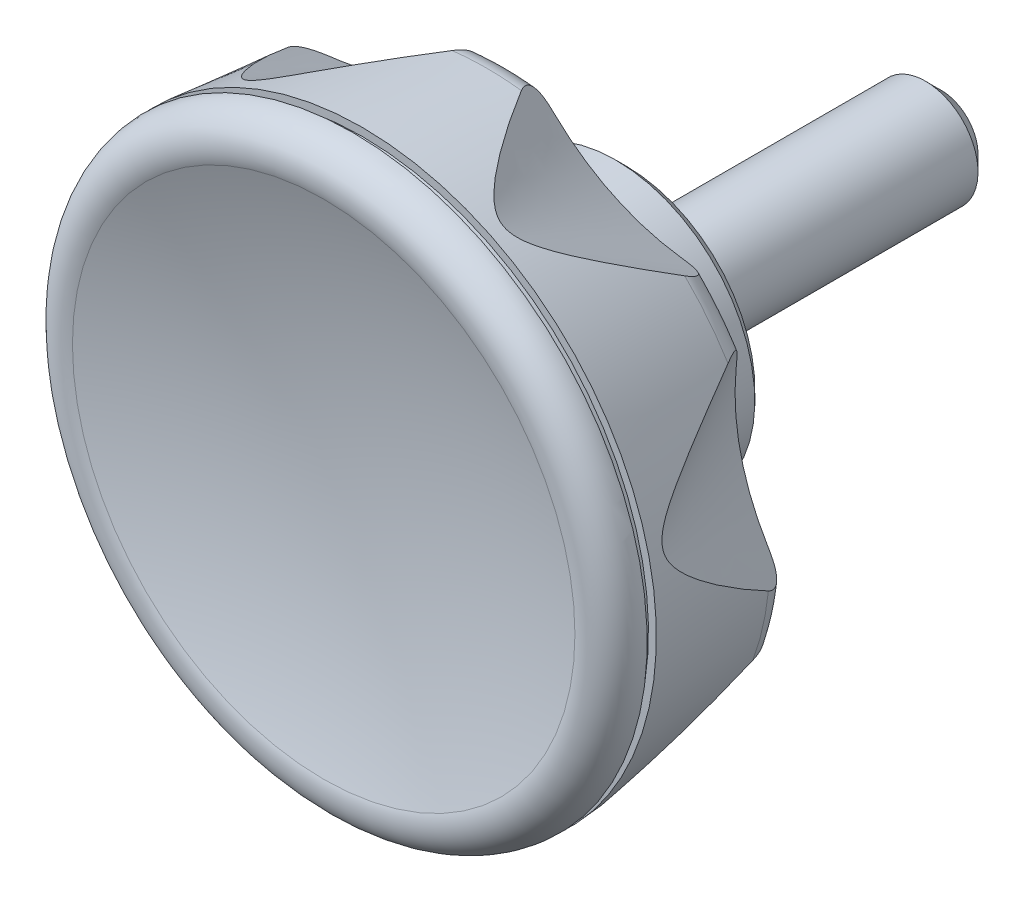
ISO-10303-21;
HEADER;
FILE_DESCRIPTION(('STEP AP214'),'2;1');
FILE_NAME('part.step','',(''),(''),'','','');
FILE_SCHEMA(('AUTOMOTIVE_DESIGN { 1 0 10303 214 1 1 1 1 }'));
ENDSEC;
DATA;
#1=APPLICATION_CONTEXT('core data for automotive mechanical design processes');
#2=APPLICATION_PROTOCOL_DEFINITION('international standard','automotive_design',2000,#1);
#3=PRODUCT_CONTEXT('',#1,'mechanical');
#4=PRODUCT('Part','Part','',(#3));
#5=PRODUCT_RELATED_PRODUCT_CATEGORY('part','',(#4));
#6=PRODUCT_DEFINITION_FORMATION('','',#4);
#7=PRODUCT_DEFINITION_CONTEXT('part definition',#1,'design');
#8=PRODUCT_DEFINITION('design','',#6,#7);
#9=PRODUCT_DEFINITION_SHAPE('','',#8);
#10=(LENGTH_UNIT() NAMED_UNIT(*) SI_UNIT(.MILLI.,.METRE.));
#11=(NAMED_UNIT(*) PLANE_ANGLE_UNIT() SI_UNIT($,.RADIAN.));
#12=(NAMED_UNIT(*) SI_UNIT($,.STERADIAN.) SOLID_ANGLE_UNIT());
#13=UNCERTAINTY_MEASURE_WITH_UNIT(LENGTH_MEASURE(1.E-05),#10,'distance_accuracy_value','');
#14=(GEOMETRIC_REPRESENTATION_CONTEXT(3) GLOBAL_UNCERTAINTY_ASSIGNED_CONTEXT((#13)) GLOBAL_UNIT_ASSIGNED_CONTEXT((#10,
#11,#12)) REPRESENTATION_CONTEXT('',''));
#15=CARTESIAN_POINT('',(0.,0.,0.));
#16=DIRECTION('',(0.,0.,1.));
#17=DIRECTION('',(1.,0.,0.));
#18=AXIS2_PLACEMENT_3D('',#15,#16,#17);
#19=CARTESIAN_POINT('',(0.,0.,13.5));
#20=DIRECTION('',(0.,0.,1.));
#21=DIRECTION('',(0.,1.,0.));
#22=AXIS2_PLACEMENT_3D('',#19,#20,#21);
#23=TOROIDAL_SURFACE('',#22,24.4738282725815,2.4999999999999);
#24=CARTESIAN_POINT('',(0.,0.,11.));
#25=DIRECTION('',(0.,0.,1.));
#26=DIRECTION('',(0.,1.,0.));
#27=AXIS2_PLACEMENT_3D('',#24,#25,#26);
#28=CIRCLE('',#27,24.4738282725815);
#29=CARTESIAN_POINT('',(-16.2379624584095,18.3111126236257,11.));
#30=VERTEX_POINT('',#29);
#31=CARTESIAN_POINT('',(-21.4653013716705,11.7562369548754,11.));
#32=VERTEX_POINT('',#31);
#33=EDGE_CURVE('E131',#30,#32,#28,.T.);
#34=ORIENTED_EDGE('',*,*,#33,.T.);
#35=CARTESIAN_POINT('',(-21.4653013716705,11.7562369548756,11.));
#36=CARTESIAN_POINT('',(-21.4754382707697,11.8601222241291,11.000030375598));
#37=CARTESIAN_POINT('',(-21.4872751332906,11.9639124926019,11.0020766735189));
#38=CARTESIAN_POINT('',(-21.5148402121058,12.1711325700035,11.0112222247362));
#39=CARTESIAN_POINT('',(-21.5305827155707,12.2745596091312,11.0183402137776));
#40=CARTESIAN_POINT('',(-21.5666560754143,12.4816775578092,11.0388207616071));
#41=CARTESIAN_POINT('',(-21.5870535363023,12.5853482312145,11.0522773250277));
#42=CARTESIAN_POINT('',(-21.6327777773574,12.79018793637,11.086761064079));
#43=CARTESIAN_POINT('',(-21.6580966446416,12.8913606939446,11.1077761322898));
#44=CARTESIAN_POINT('',(-21.7159025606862,13.096009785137,11.1604458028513));
#45=CARTESIAN_POINT('',(-21.7487343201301,13.1992460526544,11.1926745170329));
#46=CARTESIAN_POINT('',(-21.8208966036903,13.3985520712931,11.2692171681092));
#47=CARTESIAN_POINT('',(-21.8602062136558,13.494643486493,11.313492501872));
#48=CARTESIAN_POINT('',(-21.9242907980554,13.631369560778,11.3905180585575));
#49=CARTESIAN_POINT('',(-21.9466893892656,13.6760092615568,11.4182052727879));
#50=CARTESIAN_POINT('',(-21.9930436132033,13.7619364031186,11.4772174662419));
#51=CARTESIAN_POINT('',(-22.0169983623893,13.8032257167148,11.5085403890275));
#52=CARTESIAN_POINT('',(-22.0662965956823,13.8818232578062,11.574842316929));
#53=CARTESIAN_POINT('',(-22.0916394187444,13.919133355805,11.6098195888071));
#54=CARTESIAN_POINT('',(-22.1434758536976,13.9891694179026,11.6833341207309));
#55=CARTESIAN_POINT('',(-22.1699692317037,14.0218963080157,11.7218706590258));
#56=CARTESIAN_POINT('',(-22.2204575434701,14.0784837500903,11.7972787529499));
#57=CARTESIAN_POINT('',(-22.2443568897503,14.1029401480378,11.8337680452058));
#58=CARTESIAN_POINT('',(-22.2925479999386,14.147619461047,11.9090357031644));
#59=CARTESIAN_POINT('',(-22.3168398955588,14.1678409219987,11.9478148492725));
#60=CARTESIAN_POINT('',(-22.3655101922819,14.2038164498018,12.0272744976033));
#61=CARTESIAN_POINT('',(-22.3898884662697,14.2195754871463,12.0679528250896));
#62=CARTESIAN_POINT('',(-22.4384945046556,14.2465760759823,12.1508760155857));
#63=CARTESIAN_POINT('',(-22.4627222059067,14.2578158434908,12.1931214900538));
#64=CARTESIAN_POINT('',(-22.5288434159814,14.2825299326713,12.3109990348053));
#65=CARTESIAN_POINT('',(-22.5703388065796,14.2913426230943,12.3878768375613));
#66=CARTESIAN_POINT('',(-22.6510509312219,14.2958836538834,12.5432786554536));
#67=CARTESIAN_POINT('',(-22.6902625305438,14.2915835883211,12.6218058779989));
#68=CARTESIAN_POINT('',(-22.7755265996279,14.2684993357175,12.7992847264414));
#69=CARTESIAN_POINT('',(-22.8206927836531,14.246227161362,12.8982168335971));
#70=CARTESIAN_POINT('',(-22.8841902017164,14.2010917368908,13.044286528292));
#71=CARTESIAN_POINT('',(-22.9046065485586,14.184142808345,13.0924834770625));
#72=CARTESIAN_POINT('',(-22.9440559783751,14.146710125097,13.187982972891));
#73=CARTESIAN_POINT('',(-22.9630908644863,14.1262311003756,13.2352866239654));
#74=CARTESIAN_POINT('',(-22.9814573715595,14.1041446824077,13.2821097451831));
#75=B_SPLINE_CURVE_WITH_KNOTS('',3,(#35,#36,#37,#38,#39,#40,#41,#42,#43,#44,#45,#46,#47,#48,#49,
#50,#51,#52,#53,#54,#55,#56,#57,#58,#59,#60,#61,#62,#63,#64,#65,#66,#67,#68,#69,#70,#71,#72,#73,
#74),.UNSPECIFIED.,.F.,.F.,(4,2,2,2,2,2,2,2,2,2,2,2,2,2,2,2,2,2,2,4),(0.,0.313209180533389,
0.627581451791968,0.946770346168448,1.26545021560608,1.60369981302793,1.94087800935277,
2.11199734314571,2.28302035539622,2.45396261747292,2.62487029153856,2.77466826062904,
2.92451758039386,3.07419932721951,3.22394010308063,3.48614173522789,3.74891177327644,
4.08027673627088,4.24522540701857,4.40995475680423),.UNSPECIFIED.);
#76=CARTESIAN_POINT('',(-22.981457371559,14.1041446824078,13.2821097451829));
#77=VERTEX_POINT('',#76);
#78=EDGE_CURVE('E114',#32,#77,#75,.T.);
#79=ORIENTED_EDGE('',*,*,#78,.T.);
#80=CARTESIAN_POINT('',(0.,0.,13.282109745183));
#81=DIRECTION('',(0.,0.,1.));
#82=DIRECTION('',(0.,1.,0.));
#83=AXIS2_PLACEMENT_3D('',#80,#81,#82);
#84=CIRCLE('',#83,26.9643149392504);
#85=CARTESIAN_POINT('',(-18.8643796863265,19.2667968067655,13.282109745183));
#86=VERTEX_POINT('',#85);
#87=EDGE_CURVE('E146',#86,#77,#84,.T.);
#88=ORIENTED_EDGE('',*,*,#87,.F.);
#89=CARTESIAN_POINT('',(-18.8643796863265,19.2667968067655,13.282109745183));
#90=CARTESIAN_POINT('',(-18.8981743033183,19.2226732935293,13.1915305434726));
#91=CARTESIAN_POINT('',(-18.9255552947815,19.1772447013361,13.0988167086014));
#92=CARTESIAN_POINT('',(-18.9651950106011,19.0843052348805,12.9100927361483));
#93=CARTESIAN_POINT('',(-18.9773008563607,19.0367781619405,12.8140590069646));
#94=CARTESIAN_POINT('',(-18.983341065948,18.9407957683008,12.6209607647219));
#95=CARTESIAN_POINT('',(-18.9771650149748,18.8923365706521,12.5238935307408));
#96=CARTESIAN_POINT('',(-18.9442986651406,18.7968510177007,12.3329550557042));
#97=CARTESIAN_POINT('',(-18.917699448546,18.7498192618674,12.2390715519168));
#98=CARTESIAN_POINT('',(-18.8474169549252,18.6641060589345,12.0674765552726));
#99=CARTESIAN_POINT('',(-18.8058006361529,18.6250650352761,11.9890989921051));
#100=CARTESIAN_POINT('',(-18.7069025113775,18.5516039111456,11.8403817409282));
#101=CARTESIAN_POINT('',(-18.6496092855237,18.5171872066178,11.7700479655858));
#102=CARTESIAN_POINT('',(-18.5279204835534,18.457227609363,11.6454449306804));
#103=CARTESIAN_POINT('',(-18.4646762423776,18.4311577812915,11.5902907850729));
#104=CARTESIAN_POINT('',(-18.3299240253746,18.3843608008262,11.4887242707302));
#105=CARTESIAN_POINT('',(-18.2584221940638,18.3636297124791,11.4423054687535));
#106=CARTESIAN_POINT('',(-18.0741590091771,18.3189481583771,11.3379996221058));
#107=CARTESIAN_POINT('',(-17.9578593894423,18.2981009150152,11.2850492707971));
#108=CARTESIAN_POINT('',(-17.7173155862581,18.2668011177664,11.1949523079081));
#109=CARTESIAN_POINT('',(-17.5930199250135,18.2564250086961,11.1579230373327));
#110=CARTESIAN_POINT('',(-17.3654004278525,18.2458816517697,11.1030967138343));
#111=CARTESIAN_POINT('',(-17.2626807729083,18.2441255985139,11.0829631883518));
#112=CARTESIAN_POINT('',(-17.0560091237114,18.2457463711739,11.0499258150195));
#113=CARTESIAN_POINT('',(-16.9520556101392,18.2491303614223,11.0370320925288));
#114=CARTESIAN_POINT('',(-16.7461255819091,18.260237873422,11.0174873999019));
#115=CARTESIAN_POINT('',(-16.6441552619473,18.2678653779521,11.0107067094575));
#116=CARTESIAN_POINT('',(-16.4406884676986,18.2868392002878,11.0019849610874));
#117=CARTESIAN_POINT('',(-16.3391915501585,18.2981729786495,11.000027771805));
#118=CARTESIAN_POINT('',(-16.2379624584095,18.3111126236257,11.));
#119=B_SPLINE_CURVE_WITH_KNOTS('',3,(#89,#90,#91,#92,#93,#94,#95,#96,#97,#98,#99,#100,#101,#102,
#103,#104,#105,#106,#107,#108,#109,#110,#111,#112,#113,#114,#115,#116,#117,#118),.UNSPECIFIED.,
.F.,.F.,(4,2,2,2,2,2,2,2,2,2,2,2,2,2,4),(0.,0.319088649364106,0.641346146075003,
0.96555390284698,1.28832411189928,1.57749027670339,1.86686764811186,2.12940978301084,
2.39175780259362,2.77800167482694,3.16704536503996,3.48068996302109,3.79477212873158,
4.10202079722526,4.40824052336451),.UNSPECIFIED.);
#120=EDGE_CURVE('E136',#86,#30,#119,.T.);
#121=ORIENTED_EDGE('',*,*,#120,.T.);
#122=EDGE_LOOP('',(#34,#79,#88,#121));
#123=FACE_BOUND('',#122,.T.);
#124=ADVANCED_FACE('F14',(#123),#23,.T.);
#125=CARTESIAN_POINT('',(-26.8251366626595,-2.73611461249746,13.282109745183));
#126=VERTEX_POINT('',#125);
#127=CARTESIAN_POINT('',(-25.355768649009,-9.17383651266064,13.282109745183));
#128=VERTEX_POINT('',#127);
#129=EDGE_CURVE('E153',#126,#128,#84,.T.);
#130=ORIENTED_EDGE('',*,*,#129,.F.);
#131=CARTESIAN_POINT('',(-26.8251366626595,-2.73611461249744,13.282109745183));
#132=CARTESIAN_POINT('',(-26.8117101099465,-2.79004686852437,13.1915305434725));
#133=CARTESIAN_POINT('',(-26.7932643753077,-2.83977845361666,13.0988167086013));
#134=CARTESIAN_POINT('',(-26.7453163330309,-2.92871684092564,12.9100927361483));
#135=CARTESIAN_POINT('',(-26.7157060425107,-2.96781421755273,12.8140590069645));
#136=CARTESIAN_POINT('',(-26.6444299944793,-3.0323806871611,12.620960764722));
#137=CARTESIAN_POINT('',(-26.602692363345,-3.0577658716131,12.5238935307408));
#138=CARTESIAN_POINT('',(-26.507546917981,-3.09160419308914,12.3329550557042));
#139=CARTESIAN_POINT('',(-26.4541916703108,-3.10013190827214,12.2390715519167));
#140=CARTESIAN_POINT('',(-26.3433579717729,-3.09862415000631,12.0674765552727));
#141=CARTESIAN_POINT('',(-26.2868871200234,-3.09042888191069,11.9890989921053));
#142=CARTESIAN_POINT('',(-26.1677909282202,-3.05890947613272,11.8403817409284));
#143=CARTESIAN_POINT('',(-26.1051611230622,-3.03557429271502,11.7700479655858));
#144=CARTESIAN_POINT('',(-25.9824110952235,-2.97781835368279,11.6454449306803));
#145=CARTESIAN_POINT('',(-25.9225967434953,-2.94462628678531,11.590290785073));
#146=CARTESIAN_POINT('',(-25.8019927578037,-2.86845020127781,11.4887242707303));
#147=CARTESIAN_POINT('',(-25.7412038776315,-2.82547344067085,11.4423054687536));
#148=CARTESIAN_POINT('',(-25.5913842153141,-2.70926917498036,11.3379996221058));
#149=CARTESIAN_POINT('',(-25.5025735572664,-2.63134051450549,11.2850492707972));
#150=CARTESIAN_POINT('',(-25.3281257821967,-2.46279090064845,11.194952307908));
#151=CARTESIAN_POINT('',(-25.2425163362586,-2.37208203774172,11.1579230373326));
#152=CARTESIAN_POINT('',(-25.0923547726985,-2.20069562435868,11.1030967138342));
#153=CARTESIAN_POINT('',(-25.0269371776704,-2.12148104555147,11.0829631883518));
#154=CARTESIAN_POINT('',(-24.8993466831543,-1.95888810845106,11.0499258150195));
#155=CARTESIAN_POINT('',(-24.8371784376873,-1.87550409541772,11.0370320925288));
#156=CARTESIAN_POINT('',(-24.7174673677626,-1.70757609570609,11.0174873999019));
#157=CARTESIAN_POINT('',(-24.6598533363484,-1.62309681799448,11.0107067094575));
#158=CARTESIAN_POINT('',(-24.5478281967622,-1.45219008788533,11.0019849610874));
#159=CARTESIAN_POINT('',(-24.4934070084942,-1.365770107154,11.000027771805));
#160=CARTESIAN_POINT('',(-24.4404083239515,-1.27855827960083,11.));
#161=B_SPLINE_CURVE_WITH_KNOTS('',3,(#131,#132,#133,#134,#135,#136,#137,#138,#139,#140,#141,
#142,#143,#144,#145,#146,#147,#148,#149,#150,#151,#152,#153,#154,#155,#156,#157,#158,#159,#160),
.UNSPECIFIED.,.F.,.F.,(4,2,2,2,2,2,2,2,2,2,2,2,2,2,4),(0.,0.319088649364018,0.641346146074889,
0.965553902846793,1.288324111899,1.57749027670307,1.8668676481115,2.12940978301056,
2.39175780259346,2.77800167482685,3.16704536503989,3.4806899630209,3.79477212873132,
4.10202079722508,4.40824052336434),.UNSPECIFIED.);
#162=CARTESIAN_POINT('',(-24.4404083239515,-1.27855827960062,11.));
#163=VERTEX_POINT('',#162);
#164=EDGE_CURVE('E29',#126,#163,#161,.T.);
#165=ORIENTED_EDGE('',*,*,#164,.T.);
#166=CARTESIAN_POINT('',(-22.5747926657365,-9.45235454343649,11.));
#167=VERTEX_POINT('',#166);
#168=EDGE_CURVE('E133',#163,#167,#28,.T.);
#169=ORIENTED_EDGE('',*,*,#168,.T.);
#170=CARTESIAN_POINT('',(-22.5747926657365,-9.45235454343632,11.));
#171=CARTESIAN_POINT('',(-22.6623336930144,-9.39550848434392,11.000030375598));
#172=CARTESIAN_POINT('',(-22.7508603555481,-9.34005074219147,11.0020766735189));
#173=CARTESIAN_POINT('',(-22.930058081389,-9.23240238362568,11.0112222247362));
#174=CARTESIAN_POINT('',(-23.0207358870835,-9.18022466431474,11.0183402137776));
#175=CARTESIAN_POINT('',(-23.2051585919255,-9.07929202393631,11.0388207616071));
#176=CARTESIAN_POINT('',(-23.2989291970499,-9.03060179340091,11.0522773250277));
#177=CARTESIAN_POINT('',(-23.4875879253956,-8.93863497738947,11.0867610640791));
#178=CARTESIAN_POINT('',(-23.5824740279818,-8.89534988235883,11.1077761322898));
#179=CARTESIAN_POINT('',(-23.7785165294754,-8.81294774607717,11.1604458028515));
#180=CARTESIAN_POINT('',(-23.8797001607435,-8.77424988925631,11.1926745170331));
#181=CARTESIAN_POINT('',(-24.0805163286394,-8.70640336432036,11.2692171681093));
#182=CARTESIAN_POINT('',(-24.1801527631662,-8.67722483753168,11.3134925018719));
#183=CARTESIAN_POINT('',(-24.3270055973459,-8.64208087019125,11.3905180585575));
#184=CARTESIAN_POINT('',(-24.3758716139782,-8.63176039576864,11.4182052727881));
#185=CARTESIAN_POINT('',(-24.4719535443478,-8.6144268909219,11.4772174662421));
#186=CARTESIAN_POINT('',(-24.5191703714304,-8.60741200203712,11.5085403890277));
#187=CARTESIAN_POINT('',(-24.611357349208,-8.59695014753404,11.5748423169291));
#188=CARTESIAN_POINT('',(-24.6563285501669,-8.59350149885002,11.6098195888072));
#189=CARTESIAN_POINT('',(-24.7434044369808,-8.59036208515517,11.683334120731));
#190=CARTESIAN_POINT('',(-24.785509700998,-8.59067055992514,11.721870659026));
#191=CARTESIAN_POINT('',(-24.8612304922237,-8.594862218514,11.79727875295));
#192=CARTESIAN_POINT('',(-24.8952522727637,-8.59829916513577,11.8337680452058));
#193=CARTESIAN_POINT('',(-24.960230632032,-8.60811939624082,11.9090357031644));
#194=CARTESIAN_POINT('',(-24.9911861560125,-8.61450369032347,11.9478148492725));
#195=CARTESIAN_POINT('',(-25.0496583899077,-8.63012528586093,12.0272744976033));
#196=CARTESIAN_POINT('',(-25.0771789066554,-8.63935938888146,12.0679528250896));
#197=CARTESIAN_POINT('',(-25.1285941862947,-8.66052652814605,12.1508760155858));
#198=CARTESIAN_POINT('',(-25.152487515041,-8.67246062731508,12.1931214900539));
#199=CARTESIAN_POINT('',(-25.2130356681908,-8.70874728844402,12.3109990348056));
#200=CARTESIAN_POINT('',(-25.2457976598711,-8.73569506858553,12.3878768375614));
#201=CARTESIAN_POINT('',(-25.2996711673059,-8.79596706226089,12.5432786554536));
#202=CARTESIAN_POINT('',(-25.3207572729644,-8.82930497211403,12.621805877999));
#203=CARTESIAN_POINT('',(-25.3558705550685,-8.91035990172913,12.7992847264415));
#204=CARTESIAN_POINT('',(-25.3666181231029,-8.9595587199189,12.8982168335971));
#205=CARTESIAN_POINT('',(-25.3709198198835,-9.03734447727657,13.0442865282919));
#206=CARTESIAN_POINT('',(-25.3703979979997,-9.0638741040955,13.0924834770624));
#207=CARTESIAN_POINT('',(-25.3657282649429,-9.11805580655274,13.1879829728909));
#208=CARTESIAN_POINT('',(-25.3615851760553,-9.14570634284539,13.2352866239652));
#209=CARTESIAN_POINT('',(-25.355768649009,-9.17383651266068,13.282109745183));
#210=B_SPLINE_CURVE_WITH_KNOTS('',3,(#170,#171,#172,#173,#174,#175,#176,#177,#178,#179,#180,
#181,#182,#183,#184,#185,#186,#187,#188,#189,#190,#191,#192,#193,#194,#195,#196,#197,#198,#199,
#200,#201,#202,#203,#204,#205,#206,#207,#208,#209),.UNSPECIFIED.,.F.,.F.,(4,2,2,2,2,2,2,2,2,2,2,
2,2,2,2,2,2,2,2,4),(0.,0.313209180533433,0.627581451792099,0.946770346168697,1.26545021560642,
1.60369981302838,1.9408780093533,2.11199734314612,2.28302035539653,2.45396261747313,
2.62487029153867,2.77466826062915,2.92451758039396,3.07419932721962,3.22394010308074,
3.48614173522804,3.74891177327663,4.08027673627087,4.24522540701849,4.40995475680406),.UNSPECIFIED.);
#211=EDGE_CURVE('E306',#167,#128,#210,.T.);
#212=ORIENTED_EDGE('',*,*,#211,.T.);
#213=EDGE_LOOP('',(#130,#165,#169,#212));
#214=FACE_BOUND('',#213,.T.);
#215=ADVANCED_FACE('F416',(#214),#23,.T.);
#216=CARTESIAN_POINT('',(-14.586018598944,-22.6786759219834,13.282109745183));
#217=VERTEX_POINT('',#216);
#218=CARTESIAN_POINT('',(-8.63666897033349,-25.5437317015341,13.282109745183));
#219=VERTEX_POINT('',#218);
#220=EDGE_CURVE('E157',#217,#219,#84,.T.);
#221=ORIENTED_EDGE('',*,*,#220,.F.);
#222=CARTESIAN_POINT('',(-14.586018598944,-22.6786759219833,13.282109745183));
#223=CARTESIAN_POINT('',(-14.5354813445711,-22.7018048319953,13.1915305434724));
#224=CARTESIAN_POINT('',(-14.4850988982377,-22.7183905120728,13.0988167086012));
#225=CARTESIAN_POINT('',(-14.3856689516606,-22.736355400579,12.9100927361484));
#226=CARTESIAN_POINT('',(-14.336639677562,-22.7375819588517,12.8140590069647));
#227=CARTESIAN_POINT('',(-14.2417196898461,-22.7221126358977,12.620960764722));
#228=CARTESIAN_POINT('',(-14.1958497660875,-22.7053082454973,12.5238935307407));
#229=CARTESIAN_POINT('',(-14.1100716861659,-22.6520183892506,12.3329550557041));
#230=CARTESIAN_POINT('',(-14.070137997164,-22.6156205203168,12.2390715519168));
#231=CARTESIAN_POINT('',(-14.0022131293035,-22.5280271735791,12.0674765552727));
#232=CARTESIAN_POINT('',(-13.9734114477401,-22.4787668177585,11.9890989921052));
#233=CARTESIAN_POINT('',(-13.9237990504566,-22.3660016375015,11.8403817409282));
#234=CARTESIAN_POINT('',(-13.9029941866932,-22.3024864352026,11.7700479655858));
#235=CARTESIAN_POINT('',(-13.8716162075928,-22.1705063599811,11.6454449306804));
#236=CARTESIAN_POINT('',(-13.8602731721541,-22.1030467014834,11.590290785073));
#237=CARTESIAN_POINT('',(-13.8446346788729,-21.9612596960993,11.4887242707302));
#238=CARTESIAN_POINT('',(-13.8403340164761,-21.8869374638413,11.4423054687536));
#239=CARTESIAN_POINT('',(-13.8377751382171,-21.6973515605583,11.3379996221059));
#240=CARTESIAN_POINT('',(-13.8433296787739,-21.5793288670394,11.2850492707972));
#241=CARTESIAN_POINT('',(-13.8663406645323,-21.3378511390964,11.194952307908));
#242=CARTESIAN_POINT('',(-13.8838830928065,-21.2143629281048,11.1579230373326));
#243=CARTESIAN_POINT('',(-13.9242541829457,-20.9901042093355,11.1030967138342));
#244=CARTESIAN_POINT('',(-13.9453994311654,-20.8895691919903,11.0829631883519));
#245=CARTESIAN_POINT('',(-13.9929683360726,-20.6884398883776,11.0499258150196));
#246=CARTESIAN_POINT('',(-14.0193993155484,-20.5878457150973,11.0370320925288));
#247=CARTESIAN_POINT('',(-14.0760520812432,-20.3895504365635,11.0174873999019));
#248=CARTESIAN_POINT('',(-14.1061788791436,-20.2918340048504,11.0107067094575));
#249=CARTESIAN_POINT('',(-14.1699526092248,-20.097690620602,11.0019849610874));
#250=CARTESIAN_POINT('',(-14.2035874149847,-20.001260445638,11.000027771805));
#251=CARTESIAN_POINT('',(-14.238728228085,-19.9054487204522,11.));
#252=B_SPLINE_CURVE_WITH_KNOTS('',3,(#222,#223,#224,#225,#226,#227,#228,#229,#230,#231,#232,
#233,#234,#235,#236,#237,#238,#239,#240,#241,#242,#243,#244,#245,#246,#247,#248,#249,#250,#251),
.UNSPECIFIED.,.F.,.F.,(4,2,2,2,2,2,2,2,2,2,2,2,2,2,4),(0.,0.319088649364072,0.641346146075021,
0.965553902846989,1.28832411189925,1.5774902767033,1.86686764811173,2.12940978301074,
2.39175780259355,2.77800167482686,3.16704536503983,3.48068996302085,3.79477212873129,
4.10202079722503,4.40824052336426),.UNSPECIFIED.);
#253=CARTESIAN_POINT('',(-14.238728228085,-19.905448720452,11.));
#254=VERTEX_POINT('',#253);
#255=EDGE_CURVE('E37',#217,#254,#252,.T.);
#256=ORIENTED_EDGE('',*,*,#255,.T.);
#257=CARTESIAN_POINT('',(-6.685004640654,-23.5431302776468,11.));
#258=VERTEX_POINT('',#257);
#259=EDGE_CURVE('E143',#254,#258,#28,.T.);
#260=ORIENTED_EDGE('',*,*,#259,.T.);
#261=CARTESIAN_POINT('',(-6.685004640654,-23.5431302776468,11.));
#262=CARTESIAN_POINT('',(-6.78402961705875,-23.5761296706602,11.000030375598));
#263=CARTESIAN_POINT('',(-6.88258369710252,-23.6107652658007,11.0020766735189));
#264=CARTESIAN_POINT('',(-7.07847452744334,-23.6837500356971,11.0112222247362));
#265=CARTESIAN_POINT('',(-7.17580539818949,-23.7221125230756,11.0183402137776));
#266=CARTESIAN_POINT('',(-7.36970338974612,-23.8033695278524,11.0388207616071));
#267=CARTESIAN_POINT('',(-7.46623596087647,-23.8463244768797,11.0522773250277));
#268=CARTESIAN_POINT('',(-7.65576530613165,-23.9364834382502,11.0867610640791));
#269=CARTESIAN_POINT('',(-7.74876747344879,-23.9836805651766,11.1077761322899));
#270=CARTESIAN_POINT('',(-7.93542255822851,-24.0855758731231,11.1604458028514));
#271=CARTESIAN_POINT('',(-8.02876472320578,-24.1405567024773,11.192674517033));
#272=CARTESIAN_POINT('',(-8.2070161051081,-24.2552594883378,11.2692171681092));
#273=CARTESIAN_POINT('',(-8.29195109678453,-24.3149658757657,11.313492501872));
#274=CARTESIAN_POINT('',(-8.41098900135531,-24.4078681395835,11.3905180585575));
#275=CARTESIAN_POINT('',(-8.44952533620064,-24.4396384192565,11.418205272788));
#276=CARTESIAN_POINT('',(-8.52298331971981,-24.5039510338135,11.477217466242));
#277=CARTESIAN_POINT('',(-8.55790699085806,-24.5364929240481,11.5085403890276));
#278=CARTESIAN_POINT('',(-8.62356403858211,-24.602044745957,11.5748423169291));
#279=CARTESIAN_POINT('',(-8.65429938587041,-24.6350544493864,11.6098195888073));
#280=CARTESIAN_POINT('',(-8.71104480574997,-24.7011757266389,11.683334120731));
#281=CARTESIAN_POINT('',(-8.73705583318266,-24.7342872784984,11.7218706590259));
#282=CARTESIAN_POINT('',(-8.78098980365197,-24.796101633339,11.7972787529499));
#283=CARTESIAN_POINT('',(-8.79951492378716,-24.824843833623,11.8337680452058));
#284=CARTESIAN_POINT('',(-8.8323505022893,-24.8817687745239,11.9090357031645));
#285=CARTESIAN_POINT('',(-8.84665951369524,-24.9099513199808,11.9478148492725));
#286=CARTESIAN_POINT('',(-8.87090290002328,-24.9654066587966,12.0272744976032));
#287=CARTESIAN_POINT('',(-8.88084214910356,-24.9926804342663,12.0679528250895));
#288=CARTESIAN_POINT('',(-8.89634991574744,-25.0460760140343,12.1508760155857));
#289=CARTESIAN_POINT('',(-8.90191670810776,-25.0721973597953,12.1931214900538));
#290=CARTESIAN_POINT('',(-8.91129781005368,-25.1421601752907,12.3109990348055));
#291=CARTESIAN_POINT('',(-8.91065595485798,-25.1845761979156,12.3878768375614));
#292=CARTESIAN_POINT('',(-8.8971229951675,-25.2642751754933,12.5432786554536));
#293=CARTESIAN_POINT('',(-8.88420533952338,-25.3015468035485,12.621805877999));
#294=CARTESIAN_POINT('',(-8.84272681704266,-25.3795363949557,12.7992847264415));
#295=CARTESIAN_POINT('',(-8.81096263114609,-25.4186141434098,12.8982168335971));
#296=CARTESIAN_POINT('',(-8.75282934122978,-25.4704759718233,13.044286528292));
#297=CARTESIAN_POINT('',(-8.73176229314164,-25.486608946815,13.0924834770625));
#298=CARTESIAN_POINT('',(-8.68648980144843,-25.5167397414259,13.187982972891));
#299=CARTESIAN_POINT('',(-8.66228856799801,-25.5307403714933,13.2352866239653));
#300=CARTESIAN_POINT('',(-8.63666897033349,-25.5437317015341,13.2821097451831));
#301=B_SPLINE_CURVE_WITH_KNOTS('',3,(#261,#262,#263,#264,#265,#266,#267,#268,#269,#270,#271,
#272,#273,#274,#275,#276,#277,#278,#279,#280,#281,#282,#283,#284,#285,#286,#287,#288,#289,#290,
#291,#292,#293,#294,#295,#296,#297,#298,#299,#300),.UNSPECIFIED.,.F.,.F.,(4,2,2,2,2,2,2,2,2,2,2,
2,2,2,2,2,2,2,2,4),(0.,0.313209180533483,0.627581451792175,0.946770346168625,1.26545021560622,
1.60369981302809,1.940878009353,2.11199734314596,2.28302035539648,2.45396261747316,
2.62487029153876,2.77466826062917,2.92451758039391,3.07419932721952,3.22394010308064,
3.48614173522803,3.74891177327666,4.0802767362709,4.24522540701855,4.40995475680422),.UNSPECIFIED.);
#302=EDGE_CURVE('E322',#258,#219,#301,.T.);
#303=ORIENTED_EDGE('',*,*,#302,.T.);
#304=EDGE_LOOP('',(#221,#256,#260,#303));
#305=FACE_BOUND('',#304,.T.);
#306=ADVANCED_FACE('F447',(#305),#23,.T.);
#307=CARTESIAN_POINT('',(8.636668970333,-25.5437317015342,13.282109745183));
#308=VERTEX_POINT('',#307);
#309=CARTESIAN_POINT('',(14.586018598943,-22.6786759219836,13.282109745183));
#310=VERTEX_POINT('',#309);
#311=EDGE_CURVE('E455',#308,#310,#84,.T.);
#312=ORIENTED_EDGE('',*,*,#311,.F.);
#313=CARTESIAN_POINT('',(8.636668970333,-25.5437317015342,13.2821097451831));
#314=CARTESIAN_POINT('',(8.68626134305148,-25.5186407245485,13.1915305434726));
#315=CARTESIAN_POINT('',(8.73064149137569,-25.4895911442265,13.0988167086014));
#316=CARTESIAN_POINT('',(8.80668056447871,-25.4230546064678,12.9100927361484));
#317=CARTESIAN_POINT('',(8.83820877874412,-25.3854867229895,12.8140590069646));
#318=CARTESIAN_POINT('',(8.88529601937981,-25.3016303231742,12.6209607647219));
#319=CARTESIAN_POINT('',(8.90075724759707,-25.2552904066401,12.5238935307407));
#320=CARTESIAN_POINT('',(8.91257531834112,-25.1550007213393,12.3329550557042));
#321=CARTESIAN_POINT('',(8.90901656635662,-25.1010856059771,12.2390715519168));
#322=CARTESIAN_POINT('',(8.88288379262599,-24.9933662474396,12.0674765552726));
#323=CARTESIAN_POINT('',(8.8623280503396,-24.9401348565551,11.9890989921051));
#324=CARTESIAN_POINT('',(8.80509750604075,-24.8310383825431,11.8403817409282));
#325=CARTESIAN_POINT('',(8.76841094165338,-24.7751714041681,11.7700479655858));
#326=CARTESIAN_POINT('',(8.68478861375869,-24.6683508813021,11.6454449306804));
#327=CARTESIAN_POINT('',(8.63911879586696,-24.6174221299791,11.5902907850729));
#328=CARTESIAN_POINT('',(8.53801569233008,-24.5167927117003,11.4887242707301));
#329=CARTESIAN_POINT('',(8.48258965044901,-24.4670911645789,11.4423054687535));
#330=CARTESIAN_POINT('',(8.33596085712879,-24.3468856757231,11.3379996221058));
#331=CARTESIAN_POINT('',(8.24022380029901,-24.277642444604,11.285049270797));
#332=CARTESIAN_POINT('',(8.03708179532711,-24.1450742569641,11.194952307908));
#333=CARTESIAN_POINT('',(7.9295972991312,-24.081795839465,11.1579230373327));
#334=CARTESIAN_POINT('',(7.72909380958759,-23.9735362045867,11.1030967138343));
#335=CARTESIAN_POINT('',(7.63730852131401,-23.9273856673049,11.0829631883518));
#336=CARTESIAN_POINT('',(7.45040057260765,-23.8391744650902,11.0499258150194));
#337=CARTESIAN_POINT('',(7.35527343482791,-23.7971195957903,11.0370320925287));
#338=CARTESIAN_POINT('',(7.16491752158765,-23.7177774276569,11.0174873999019));
#339=CARTESIAN_POINT('',(7.06973598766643,-23.6804063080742,11.0107067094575));
#340=CARTESIAN_POINT('',(6.87818630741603,-23.6092201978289,11.0019849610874));
#341=CARTESIAN_POINT('',(6.78182320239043,-23.5753937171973,11.000027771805));
#342=CARTESIAN_POINT('',(6.6850046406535,-23.543130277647,11.));
#343=B_SPLINE_CURVE_WITH_KNOTS('',3,(#313,#314,#315,#316,#317,#318,#319,#320,#321,#322,#323,
#324,#325,#326,#327,#328,#329,#330,#331,#332,#333,#334,#335,#336,#337,#338,#339,#340,#341,#342),
.UNSPECIFIED.,.F.,.F.,(4,2,2,2,2,2,2,2,2,2,2,2,2,2,4),(0.,0.319088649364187,0.641346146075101,
0.965553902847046,1.28832411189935,1.57749027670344,1.86686764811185,2.12940978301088,
2.39175780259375,2.77800167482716,3.16704536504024,3.48068996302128,3.79477212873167,
4.1020207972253,4.40824052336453),.UNSPECIFIED.);
#344=CARTESIAN_POINT('',(6.685004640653,-23.5431302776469,11.));
#345=VERTEX_POINT('',#344);
#346=EDGE_CURVE('E315',#308,#345,#343,.T.);
#347=ORIENTED_EDGE('',*,*,#346,.T.);
#348=CARTESIAN_POINT('',(14.2387282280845,-19.9054487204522,11.));
#349=VERTEX_POINT('',#348);
#350=EDGE_CURVE('E449',#345,#349,#28,.T.);
#351=ORIENTED_EDGE('',*,*,#350,.T.);
#352=CARTESIAN_POINT('',(14.2387282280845,-19.9054487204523,11.));
#353=CARTESIAN_POINT('',(14.202787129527,-20.0034443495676,11.000030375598));
#354=CARTESIAN_POINT('',(14.168418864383,-20.1020919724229,11.0020766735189));
#355=CARTESIAN_POINT('',(14.1033447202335,-20.3007508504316,11.0112222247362));
#356=CARTESIAN_POINT('',(14.0726529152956,-20.4007658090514,11.0183402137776));
#357=CARTESIAN_POINT('',(14.0152887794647,-20.6030242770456,11.038820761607));
#358=CARTESIAN_POINT('',(13.9886852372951,-20.7052784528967,11.0522773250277));
#359=CARTESIAN_POINT('',(13.9410047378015,-20.9096716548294,11.086761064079));
#360=CARTESIAN_POINT('',(13.9199190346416,-21.0118106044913,11.1077761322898));
#361=CARTESIAN_POINT('',(13.8832064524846,-21.2212741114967,11.1604458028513));
#362=CARTESIAN_POINT('',(13.8679943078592,-21.3285319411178,11.1926745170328));
#363=CARTESIAN_POINT('',(13.8465346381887,-21.5394105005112,11.269217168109));
#364=CARTESIAN_POINT('',(13.8402588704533,-21.6430416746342,11.3134925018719));
#365=CARTESIAN_POINT('',(13.8386738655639,-21.7940328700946,11.3905180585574));
#366=CARTESIAN_POINT('',(13.8394858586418,-21.843970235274,11.4182052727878));
#367=CARTESIAN_POINT('',(13.8439671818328,-21.9415002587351,11.4772174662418));
#368=CARTESIAN_POINT('',(13.8476349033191,-21.9890942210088,11.5085403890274));
#369=CARTESIAN_POINT('',(13.8579488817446,-22.0812978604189,11.5748423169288));
#370=CARTESIAN_POINT('',(13.8645937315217,-22.1259089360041,11.609819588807));
#371=CARTESIAN_POINT('',(13.8809092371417,-22.2115002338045,11.6833341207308));
#372=CARTESIAN_POINT('',(13.8905792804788,-22.2524811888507,11.7218706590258));
#373=CARTESIAN_POINT('',(13.9115153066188,-22.3253707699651,11.7972787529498));
#374=CARTESIAN_POINT('',(13.9224366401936,-22.3577747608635,11.8337680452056));
#375=CARTESIAN_POINT('',(13.9464697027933,-22.4189387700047,11.9090357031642));
#376=CARTESIAN_POINT('',(13.9595821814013,-22.4476975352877,11.9478148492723));
#377=CARTESIAN_POINT('',(13.9878234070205,-22.5012276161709,12.0272744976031));
#378=CARTESIAN_POINT('',(14.0029498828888,-22.5260033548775,12.0679528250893));
#379=CARTESIAN_POINT('',(14.0350272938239,-22.5714194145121,12.1508760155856));
#380=CARTESIAN_POINT('',(14.0519789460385,-22.5920581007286,12.1931214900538));
#381=CARTESIAN_POINT('',(14.1008290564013,-22.6430136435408,12.3109990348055));
#382=CARTESIAN_POINT('',(14.1343914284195,-22.6689577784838,12.3878768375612));
#383=CARTESIAN_POINT('',(14.2051402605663,-22.7080687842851,12.5432786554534));
#384=CARTESIAN_POINT('',(14.2423344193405,-22.7212078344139,12.6218058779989));
#385=CARTESIAN_POINT('',(14.3291705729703,-22.7374043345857,12.7992847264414));
#386=CARTESIAN_POINT('',(14.3795274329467,-22.7369346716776,12.898216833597));
#387=CARTESIAN_POINT('',(14.4563201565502,-22.7238195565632,13.0442865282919));
#388=CARTESIAN_POINT('',(14.4820685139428,-22.7174074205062,13.0924834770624));
#389=CARTESIAN_POINT('',(14.5338526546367,-22.7007982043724,13.1879829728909));
#390=CARTESIAN_POINT('',(14.5598880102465,-22.6906061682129,13.2352866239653));
#391=CARTESIAN_POINT('',(14.586018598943,-22.6786759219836,13.2821097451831));
#392=B_SPLINE_CURVE_WITH_KNOTS('',3,(#352,#353,#354,#355,#356,#357,#358,#359,#360,#361,#362,
#363,#364,#365,#366,#367,#368,#369,#370,#371,#372,#373,#374,#375,#376,#377,#378,#379,#380,#381,
#382,#383,#384,#385,#386,#387,#388,#389,#390,#391),.UNSPECIFIED.,.F.,.F.,(4,2,2,2,2,2,2,2,2,2,2,
2,2,2,2,2,2,2,2,4),(0.,0.313209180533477,0.627581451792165,0.946770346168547,1.26545021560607,
1.60369981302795,1.94087800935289,2.11199734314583,2.28302035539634,2.45396261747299,
2.62487029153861,2.77466826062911,2.9245175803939,3.07419932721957,3.22394010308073,
3.48614173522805,3.74891177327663,4.08027673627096,4.24522540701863,4.40995475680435),.UNSPECIFIED.);
#393=EDGE_CURVE('E338',#349,#310,#392,.T.);
#394=ORIENTED_EDGE('',*,*,#393,.T.);
#395=EDGE_LOOP('',(#312,#347,#351,#394));
#396=FACE_BOUND('',#395,.T.);
#397=ADVANCED_FACE('F428',(#396),#23,.T.);
#398=CARTESIAN_POINT('',(25.3557686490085,-9.17383651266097,13.282109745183));
#399=VERTEX_POINT('',#398);
#400=CARTESIAN_POINT('',(26.825136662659,-2.73611461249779,13.282109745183));
#401=VERTEX_POINT('',#400);
#402=EDGE_CURVE('E164',#399,#401,#84,.T.);
#403=ORIENTED_EDGE('',*,*,#402,.F.);
#404=CARTESIAN_POINT('',(25.3557686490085,-9.17383651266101,13.282109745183));
#405=CARTESIAN_POINT('',(25.3670720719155,-9.11941966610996,13.1915305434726));
#406=CARTESIAN_POINT('',(25.3720307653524,-9.06660975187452,13.0988167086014));
#407=CARTESIAN_POINT('',(25.3674199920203,-8.96567515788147,12.9100927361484));
#408=CARTESIAN_POINT('',(25.3577057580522,-8.91760221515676,12.8140590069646));
#409=CARTESIAN_POINT('',(25.3215025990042,-8.82850431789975,12.6209607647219));
#410=CARTESIAN_POINT('',(25.294912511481,-8.78752377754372,12.5238935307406));
#411=CARTESIAN_POINT('',(25.2238713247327,-8.71575444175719,12.3329550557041));
#412=CARTESIAN_POINT('',(25.1794999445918,-8.68492126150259,12.2390715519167));
#413=CARTESIAN_POINT('',(25.0789880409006,-8.63819076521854,12.0674765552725));
#414=CARTESIAN_POINT('',(25.0245537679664,-8.62107266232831,11.989098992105));
#415=CARTESIAN_POINT('',(24.9035760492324,-8.59779676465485,11.8403817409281));
#416=CARTESIAN_POINT('',(24.8370237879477,-8.59164698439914,11.7700479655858));
#417=CARTESIAN_POINT('',(24.7013704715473,-8.5904240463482,11.6454449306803));
#418=CARTESIAN_POINT('',(24.633078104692,-8.59437659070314,11.5902907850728));
#419=CARTESIAN_POINT('',(24.4913661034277,-8.61068076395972,11.4887242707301));
#420=CARTESIAN_POINT('',(24.4179502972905,-8.62302618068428,11.4423054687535));
#421=CARTESIAN_POINT('',(24.2325483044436,-8.66271829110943,11.3379996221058));
#422=CARTESIAN_POINT('',(24.1187206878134,-8.69439608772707,11.285049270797));
#423=CARTESIAN_POINT('',(23.8884177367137,-8.77056398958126,11.1949523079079));
#424=CARTESIAN_POINT('',(23.771929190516,-8.815145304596,11.1579230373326));
#425=CARTESIAN_POINT('',(23.5622765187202,-8.90440646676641,11.1030967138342));
#426=CARTESIAN_POINT('',(23.4689673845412,-8.94739270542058,11.0829631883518));
#427=CARTESIAN_POINT('',(23.2834658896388,-9.03852443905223,11.0499258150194));
#428=CARTESIAN_POINT('',(23.1912752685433,-9.08667704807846,11.0370320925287));
#429=CARTESIAN_POINT('',(23.0105580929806,-9.18603426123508,11.0174873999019));
#430=CARTESIAN_POINT('',(22.9219954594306,-9.23714966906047,11.0107067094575));
#431=CARTESIAN_POINT('',(22.746910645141,-9.342525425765,11.0019849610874));
#432=CARTESIAN_POINT('',(22.6603826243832,-9.39677466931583,11.000027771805));
#433=CARTESIAN_POINT('',(22.5747926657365,-9.45235454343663,11.));
#434=B_SPLINE_CURVE_WITH_KNOTS('',3,(#404,#405,#406,#407,#408,#409,#410,#411,#412,#413,#414,
#415,#416,#417,#418,#419,#420,#421,#422,#423,#424,#425,#426,#427,#428,#429,#430,#431,#432,#433),
.UNSPECIFIED.,.F.,.F.,(4,2,2,2,2,2,2,2,2,2,2,2,2,2,4),(0.,0.319088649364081,0.641346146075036,
0.965553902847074,1.28832411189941,1.5774902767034,1.86686764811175,2.12940978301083,
2.39175780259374,2.77800167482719,3.1670453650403,3.48068996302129,3.79477212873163,
4.10202079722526,4.40824052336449),.UNSPECIFIED.);
#435=CARTESIAN_POINT('',(22.574792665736,-9.45235454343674,11.));
#436=VERTEX_POINT('',#435);
#437=EDGE_CURVE('E331',#399,#436,#434,.T.);
#438=ORIENTED_EDGE('',*,*,#437,.T.);
#439=CARTESIAN_POINT('',(24.440408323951,-1.27855827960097,11.));
#440=VERTEX_POINT('',#439);
#441=EDGE_CURVE('E152',#436,#440,#28,.T.);
#442=ORIENTED_EDGE('',*,*,#441,.T.);
#443=CARTESIAN_POINT('',(24.4404083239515,-1.2785582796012,11.));
#444=CARTESIAN_POINT('',(24.4946154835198,-1.36775743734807,11.000030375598));
#445=CARTESIAN_POINT('',(24.5503130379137,-1.45613341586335,11.0020766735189));
#446=CARTESIAN_POINT('',(24.6650577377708,-1.6308722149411,11.0112222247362));
#447=CARTESIAN_POINT('',(24.724116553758,-1.71722634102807,11.0183402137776));
#448=CARTESIAN_POINT('',(24.8464826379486,-1.88818152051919,11.038820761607));
#449=CARTESIAN_POINT('',(24.9098411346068,-1.97273544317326,11.0522773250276));
#450=CARTESIAN_POINT('',(25.0399138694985,-2.13745063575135,11.086761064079));
#451=CARTESIAN_POINT('',(25.1066225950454,-2.21761869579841,11.1077761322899));
#452=CARTESIAN_POINT('',(25.2474978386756,-2.37692010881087,11.1604458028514));
#453=CARTESIAN_POINT('',(25.3218707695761,-2.45568760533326,11.1926745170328));
#454=CARTESIAN_POINT('',(25.4733623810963,-2.60394608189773,11.269217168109));
#455=CARTESIAN_POINT('',(25.5504716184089,-2.67346565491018,11.3134925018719));
#456=CARTESIAN_POINT('',(25.667533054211,-2.76884633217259,11.3905180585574));
#457=CARTESIAN_POINT('',(25.7070819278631,-2.7993469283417,11.4182052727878));
#458=CARTESIAN_POINT('',(25.7861280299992,-2.85665226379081,11.4772174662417));
#459=CARTESIAN_POINT('',(25.8256252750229,-2.88345907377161,11.5085403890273));
#460=CARTESIAN_POINT('',(25.9041436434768,-2.93288330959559,11.5748423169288));
#461=CARTESIAN_POINT('',(25.9431649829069,-2.95550270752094,11.6098195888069));
#462=CARTESIAN_POINT('',(26.0202555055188,-2.99611203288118,11.6833341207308));
#463=CARTESIAN_POINT('',(26.0583248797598,-3.01410289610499,11.7218706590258));
#464=CARTESIAN_POINT('',(26.1283656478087,-3.04318036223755,11.7972787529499));
#465=CARTESIAN_POINT('',(26.1605094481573,-3.05484527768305,11.8337680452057));
#466=CARTESIAN_POINT('',(26.2233137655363,-3.074190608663,11.9090357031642));
#467=CARTESIAN_POINT('',(26.2539737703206,-3.08186965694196,11.9478148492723));
#468=CARTESIAN_POINT('',(26.3134333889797,-3.09316523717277,12.0272744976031));
#469=CARTESIAN_POINT('',(26.3422350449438,-3.09678630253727,12.0679528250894));
#470=CARTESIAN_POINT('',(26.3977426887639,-3.10002362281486,12.1508760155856));
#471=CARTESIAN_POINT('',(26.4244478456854,-3.09963829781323,12.1931214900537));
#472=CARTESIAN_POINT('',(26.4947440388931,-3.09321600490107,12.3109990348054));
#473=CARTESIAN_POINT('',(26.5359537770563,-3.08315178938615,12.3878768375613));
#474=CARTESIAN_POINT('',(26.6106431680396,-3.05222343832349,12.5432786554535));
#475=CARTESIAN_POINT('',(26.6441058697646,-3.03133593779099,12.6218058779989));
#476=CARTESIAN_POINT('',(26.7109102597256,-2.9735430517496,12.7992847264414));
#477=CARTESIAN_POINT('',(26.7419400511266,-2.93387964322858,12.8982168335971));
#478=CARTESIAN_POINT('',(26.7795657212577,-2.86566353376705,13.044286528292));
#479=CARTESIAN_POINT('',(26.7906063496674,-2.84153475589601,13.0924834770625));
#480=CARTESIAN_POINT('',(26.8099076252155,-2.79069260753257,13.1879829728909));
#481=CARTESIAN_POINT('',(26.818171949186,-2.7639827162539,13.2352866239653));
#482=CARTESIAN_POINT('',(26.825136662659,-2.73611461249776,13.282109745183));
#483=B_SPLINE_CURVE_WITH_KNOTS('',3,(#443,#444,#445,#446,#447,#448,#449,#450,#451,#452,#453,
#454,#455,#456,#457,#458,#459,#460,#461,#462,#463,#464,#465,#466,#467,#468,#469,#470,#471,#472,
#473,#474,#475,#476,#477,#478,#479,#480,#481,#482),.UNSPECIFIED.,.F.,.F.,(4,2,2,2,2,2,2,2,2,2,2,
2,2,2,2,2,2,2,2,4),(0.,0.313209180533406,0.627581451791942,0.946770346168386,1.26545021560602,
1.60369981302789,1.94087800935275,2.11199734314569,2.2830203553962,2.45396261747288,
2.62487029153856,2.77466826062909,2.9245175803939,3.07419932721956,3.22394010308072,
3.48614173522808,3.74891177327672,4.08027673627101,4.2452254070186,4.40995475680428),.UNSPECIFIED.);
#484=EDGE_CURVE('E378',#440,#401,#483,.T.);
#485=ORIENTED_EDGE('',*,*,#484,.T.);
#486=EDGE_LOOP('',(#403,#438,#442,#485));
#487=FACE_BOUND('',#486,.T.);
#488=ADVANCED_FACE('F419',(#487),#23,.T.);
#489=CARTESIAN_POINT('',(22.981457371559,14.1041446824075,13.282109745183));
#490=VERTEX_POINT('',#489);
#491=CARTESIAN_POINT('',(18.8643796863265,19.2667968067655,13.282109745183));
#492=VERTEX_POINT('',#491);
#493=EDGE_CURVE('E159',#490,#492,#84,.T.);
#494=ORIENTED_EDGE('',*,*,#493,.F.);
#495=CARTESIAN_POINT('',(22.981457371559,14.1041446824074,13.282109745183));
#496=CARTESIAN_POINT('',(22.9459601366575,14.1469104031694,13.1915305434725));
#497=CARTESIAN_POINT('',(22.9077633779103,14.1837137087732,13.0988167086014));
#498=CARTESIAN_POINT('',(22.8259747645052,14.2430405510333,12.9100927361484));
#499=CARTESIAN_POINT('',(22.7823330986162,14.2654186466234,12.8140590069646));
#500=CARTESIAN_POINT('',(22.6901012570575,14.2926655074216,12.6209607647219));
#501=CARTESIAN_POINT('',(22.6414827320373,14.2974274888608,12.5238935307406));
#502=CARTESIAN_POINT('',(22.5410777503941,14.2866327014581,12.3329550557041));
#503=CARTESIAN_POINT('',(22.4893062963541,14.2711659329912,12.2390715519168));
#504=CARTESIAN_POINT('',(22.390102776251,14.2217185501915,12.0674765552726));
#505=CARTESIAN_POINT('',(22.3427800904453,14.1898330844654,11.989098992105));
#506=CARTESIAN_POINT('',(22.2491538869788,14.1097611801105,11.8403817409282));
#507=CARTESIAN_POINT('',(22.2028511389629,14.0615628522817,11.7700479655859));
#508=CARTESIAN_POINT('',(22.1173165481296,13.9562673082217,11.6454449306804));
#509=CARTESIAN_POINT('',(22.0778271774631,13.9004098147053,11.5902907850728));
#510=CARTESIAN_POINT('',(22.0022183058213,13.7794494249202,11.48872427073));
#511=CARTESIAN_POINT('',(21.9660963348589,13.7143533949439,11.4423054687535));
#512=CARTESIAN_POINT('',(21.8815326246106,13.5446526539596,11.3379996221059));
#513=CARTESIAN_POINT('',(21.8353289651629,13.4359078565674,11.285049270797));
#514=CARTESIAN_POINT('',(21.7512878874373,13.2083598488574,11.1949523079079));
#515=CARTESIAN_POINT('',(21.7135135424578,13.089489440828,11.1579230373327));
#516=CARTESIAN_POINT('',(21.6525844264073,12.8699229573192,11.1030967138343));
#517=CARTESIAN_POINT('',(21.6280151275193,12.7701694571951,11.0829631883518));
#518=CARTESIAN_POINT('',(21.5836064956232,12.5683188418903,11.0499258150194));
#519=CARTESIAN_POINT('',(21.5637738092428,12.4662186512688,11.0370320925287));
#520=CARTESIAN_POINT('',(21.5287790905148,12.2629800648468,11.0174873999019));
#521=CARTESIAN_POINT('',(21.5135248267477,12.1618690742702,11.0107067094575));
#522=CARTESIAN_POINT('',(21.4867473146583,11.959281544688,11.0019849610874));
#523=CARTESIAN_POINT('',(21.475211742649,11.8578073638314,11.000027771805));
#524=CARTESIAN_POINT('',(21.4653013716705,11.7562369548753,11.));
#525=B_SPLINE_CURVE_WITH_KNOTS('',3,(#495,#496,#497,#498,#499,#500,#501,#502,#503,#504,#505,
#506,#507,#508,#509,#510,#511,#512,#513,#514,#515,#516,#517,#518,#519,#520,#521,#522,#523,#524),
.UNSPECIFIED.,.F.,.F.,(4,2,2,2,2,2,2,2,2,2,2,2,2,2,4),(0.,0.31908864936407,0.641346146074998,
0.965553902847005,1.28832411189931,1.57749027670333,1.86686764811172,2.12940978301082,
2.39175780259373,2.77800167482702,3.16704536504,3.48068996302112,3.7947721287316,
4.10202079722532,4.40824052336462),.UNSPECIFIED.);
#526=CARTESIAN_POINT('',(21.4653013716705,11.7562369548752,11.));
#527=VERTEX_POINT('',#526);
#528=EDGE_CURVE('E372',#490,#527,#525,.T.);
#529=ORIENTED_EDGE('',*,*,#528,.T.);
#530=CARTESIAN_POINT('',(16.237962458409,18.3111126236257,11.));
#531=VERTEX_POINT('',#530);
#532=EDGE_CURVE('E145',#527,#531,#28,.T.);
#533=ORIENTED_EDGE('',*,*,#532,.T.);
#534=CARTESIAN_POINT('',(16.237962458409,18.3111126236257,11.));
#535=CARTESIAN_POINT('',(16.3414987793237,18.2978787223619,11.000030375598));
#536=CARTESIAN_POINT('',(16.4453207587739,18.28632330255,11.0020766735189));
#537=CARTESIAN_POINT('',(16.6534792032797,18.2670864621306,11.0112222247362));
#538=CARTESIAN_POINT('',(16.7578161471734,18.259419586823,11.0183402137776));
#539=CARTESIAN_POINT('',(16.9677682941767,18.2485004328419,11.038820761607));
#540=CARTESIAN_POINT('',(17.0733785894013,18.2453175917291,11.0522773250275));
#541=CARTESIAN_POINT('',(17.2832571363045,18.2443143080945,11.086761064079));
#542=CARTESIAN_POINT('',(17.3875272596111,18.2464853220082,11.1077761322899));
#543=CARTESIAN_POINT('',(17.5999083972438,18.2573032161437,11.1604458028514));
#544=CARTESIAN_POINT('',(17.7078620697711,18.2663395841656,11.1926745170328));
#545=CARTESIAN_POINT('',(17.9182286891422,18.2923428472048,11.269217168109));
#546=CARTESIAN_POINT('',(18.0206581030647,18.3092845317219,11.3134925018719));
#547=CARTESIAN_POINT('',(18.1682163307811,18.3413379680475,11.3905180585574));
#548=CARTESIAN_POINT('',(18.2167209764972,18.3532417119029,11.4182052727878));
#549=CARTESIAN_POINT('',(18.3108085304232,18.3793131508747,11.4772174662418));
#550=CARTESIAN_POINT('',(18.3563930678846,18.3934795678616,11.5085403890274));
#551=CARTESIAN_POINT('',(18.4439898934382,18.4240521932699,11.5748423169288));
#552=CARTESIAN_POINT('',(18.4860038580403,18.4404573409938,11.609819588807));
#553=CARTESIAN_POINT('',(18.5658186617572,18.4754096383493,11.6833341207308));
#554=CARTESIAN_POINT('',(18.6036203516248,18.493956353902,11.7218706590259));
#555=CARTESIAN_POINT('',(18.6700237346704,18.5305869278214,11.7972787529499));
#556=CARTESIAN_POINT('',(18.6991850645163,18.5484450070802,11.8337680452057));
#557=CARTESIAN_POINT('',(18.7534677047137,18.5854857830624,11.9090357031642));
#558=CARTESIAN_POINT('',(18.7785876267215,18.6046689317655,11.9478148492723));
#559=CARTESIAN_POINT('',(18.8244913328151,18.6441136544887,12.027274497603));
#560=CARTESIAN_POINT('',(18.8452799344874,18.6643739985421,12.0679528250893));
#561=CARTESIAN_POINT('',(18.8824194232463,18.7057531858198,12.1508760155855));
#562=CARTESIAN_POINT('',(18.8987685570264,18.726872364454,12.1931214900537));
#563=CARTESIAN_POINT('',(18.9375763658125,18.7858363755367,12.3109990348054));
#564=CARTESIAN_POINT('',(18.9554016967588,18.8243303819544,12.3878768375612));
#565=CARTESIAN_POINT('',(18.9777890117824,18.9020084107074,12.5432786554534));
#566=CARTESIAN_POINT('',(18.982322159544,18.9411937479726,12.6218058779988));
#567=CARTESIAN_POINT('',(18.9787897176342,19.029456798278,12.7992847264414));
#568=CARTESIAN_POINT('',(18.967126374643,19.0784465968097,12.8982168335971));
#569=CARTESIAN_POINT('',(18.9372520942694,19.1503955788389,13.0442865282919));
#570=CARTESIAN_POINT('',(18.9252711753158,19.1740715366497,13.0924834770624));
#571=CARTESIAN_POINT('',(18.8975553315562,19.2208614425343,13.1879829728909));
#572=CARTESIAN_POINT('',(18.8818254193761,19.2439760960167,13.2352866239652));
#573=CARTESIAN_POINT('',(18.8643796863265,19.2667968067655,13.282109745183));
#574=B_SPLINE_CURVE_WITH_KNOTS('',3,(#534,#535,#536,#537,#538,#539,#540,#541,#542,#543,#544,
#545,#546,#547,#548,#549,#550,#551,#552,#553,#554,#555,#556,#557,#558,#559,#560,#561,#562,#563,
#564,#565,#566,#567,#568,#569,#570,#571,#572,#573),.UNSPECIFIED.,.F.,.F.,(4,2,2,2,2,2,2,2,2,2,2,
2,2,2,2,2,2,2,2,4),(0.,0.313209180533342,0.627581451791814,0.94677034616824,1.26545021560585,
1.603699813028,1.94087800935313,2.11199734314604,2.28302035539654,2.4539626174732,
2.62487029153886,2.77466826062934,2.92451758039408,3.07419932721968,3.2239401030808,
3.48614173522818,3.74891177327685,4.08027673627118,4.24522540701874,4.40995475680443),.UNSPECIFIED.);
#575=EDGE_CURVE('E394',#531,#492,#574,.T.);
#576=ORIENTED_EDGE('',*,*,#575,.T.);
#577=EDGE_LOOP('',(#494,#529,#533,#576));
#578=FACE_BOUND('',#577,.T.);
#579=ADVANCED_FACE('F408',(#578),#23,.T.);
#580=CARTESIAN_POINT('',(0.,0.,101.629158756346));
#581=DIRECTION('',(0.,1.,0.));
#582=DIRECTION('',(-1.,0.,0.));
#583=AXIS2_PLACEMENT_3D('',#580,#581,#582);
#584=SPHERICAL_SURFACE('',#583,76.6575800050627);
#585=CARTESIAN_POINT('',(0.,0.,101.629158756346));
#586=DIRECTION('',(0.,0.,1.));
#587=DIRECTION('',(0.,1.,0.));
#588=AXIS2_PLACEMENT_3D('',#585,#586,#587);
#589=SPHERICAL_SURFACE('',#588,76.6575800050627);
#590=CARTESIAN_POINT('',(0.,0.,28.8005083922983));
#591=DIRECTION('',(0.,0.,1.));
#592=DIRECTION('',(0.,1.,0.));
#593=AXIS2_PLACEMENT_3D('',#590,#591,#592);
#594=CIRCLE('',#593,23.9243026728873);
#595=CARTESIAN_POINT('',(0.,23.9243026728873,28.8005083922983));
#596=VERTEX_POINT('',#595);
#597=EDGE_CURVE('E178',#596,#596,#594,.T.);
#598=ORIENTED_EDGE('',*,*,#597,.T.);
#599=EDGE_LOOP('',(#598));
#600=FACE_BOUND('',#599,.T.);
#601=ADVANCED_FACE('F418',(#600),#589,.F.);
#602=CARTESIAN_POINT('',(-5.,0.,-30.));
#603=DIRECTION('',(0.,0.,-1.));
#604=DIRECTION('',(0.,-1.,0.));
#605=AXIS2_PLACEMENT_3D('',#602,#603,#604);
#606=PLANE('',#605);
#607=CARTESIAN_POINT('',(0.,0.,-30.));
#608=DIRECTION('',(0.,0.,-1.));
#609=DIRECTION('',(-1.,0.,0.));
#610=AXIS2_PLACEMENT_3D('',#607,#608,#609);
#611=CIRCLE('',#610,3.5);
#612=CARTESIAN_POINT('',(-3.5,0.,-30.));
#613=VERTEX_POINT('',#612);
#614=EDGE_CURVE('E9',#613,#613,#611,.T.);
#615=ORIENTED_EDGE('',*,*,#614,.T.);
#616=EDGE_LOOP('',(#615));
#617=FACE_BOUND('',#616,.T.);
#618=ADVANCED_FACE('F426',(#617),#606,.T.);
#619=CARTESIAN_POINT('',(0.,0.,30.1700591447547));
#620=DIRECTION('',(0.,0.,1.));
#621=DIRECTION('',(0.,1.,0.));
#622=AXIS2_PLACEMENT_3D('',#619,#620,#621);
#623=CYLINDRICAL_SURFACE('',#622,5.);
#624=CARTESIAN_POINT('',(0.,0.,-28.5));
#625=DIRECTION('',(0.,0.,-1.));
#626=DIRECTION('',(-1.,0.,0.));
#627=AXIS2_PLACEMENT_3D('',#624,#625,#626);
#628=CIRCLE('',#627,5.);
#629=CARTESIAN_POINT('',(-5.,0.,-28.5));
#630=VERTEX_POINT('',#629);
#631=EDGE_CURVE('E22',#630,#630,#628,.F.);
#632=ORIENTED_EDGE('',*,*,#631,.T.);
#633=EDGE_LOOP('',(#632));
#634=FACE_BOUND('',#633,.T.);
#635=CARTESIAN_POINT('',(0.,0.,0.));
#636=DIRECTION('',(0.,0.,1.));
#637=DIRECTION('',(0.,1.,0.));
#638=AXIS2_PLACEMENT_3D('',#635,#636,#637);
#639=CIRCLE('',#638,5.);
#640=CARTESIAN_POINT('',(0.,5.,0.));
#641=VERTEX_POINT('',#640);
#642=EDGE_CURVE('E229',#641,#641,#639,.T.);
#643=ORIENTED_EDGE('',*,*,#642,.F.);
#644=EDGE_LOOP('',(#643));
#645=FACE_BOUND('',#644,.T.);
#646=ADVANCED_FACE('F523',(#634,#645),#623,.T.);
#647=CARTESIAN_POINT('',(-12.25,0.,0.));
#648=DIRECTION('',(0.,0.,-1.));
#649=DIRECTION('',(0.,-1.,0.));
#650=AXIS2_PLACEMENT_3D('',#647,#648,#649);
#651=PLANE('',#650);
#652=ORIENTED_EDGE('',*,*,#642,.T.);
#653=EDGE_LOOP('',(#652));
#654=FACE_BOUND('',#653,.T.);
#655=CARTESIAN_POINT('',(0.,0.,0.));
#656=DIRECTION('',(0.,0.,1.));
#657=DIRECTION('',(0.,1.,0.));
#658=AXIS2_PLACEMENT_3D('',#655,#656,#657);
#659=CIRCLE('',#658,12.25);
#660=CARTESIAN_POINT('',(0.,12.25,0.));
#661=VERTEX_POINT('',#660);
#662=EDGE_CURVE('E659',#661,#661,#659,.T.);
#663=ORIENTED_EDGE('',*,*,#662,.F.);
#664=EDGE_LOOP('',(#663));
#665=FACE_BOUND('',#664,.T.);
#666=ADVANCED_FACE('F531',(#654,#665),#651,.T.);
#667=CARTESIAN_POINT('',(0.,0.,1.));
#668=DIRECTION('',(0.,0.,1.));
#669=DIRECTION('',(0.,1.,0.));
#670=AXIS2_PLACEMENT_3D('',#667,#668,#669);
#671=CONICAL_SURFACE('',#670,13.25,0.785398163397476);
#672=ORIENTED_EDGE('',*,*,#662,.T.);
#673=EDGE_LOOP('',(#672));
#674=FACE_BOUND('',#673,.T.);
#675=CARTESIAN_POINT('',(0.,0.,1.));
#676=DIRECTION('',(0.,0.,1.));
#677=DIRECTION('',(0.,1.,0.));
#678=AXIS2_PLACEMENT_3D('',#675,#676,#677);
#679=CIRCLE('',#678,13.25);
#680=CARTESIAN_POINT('',(0.,13.25,1.));
#681=VERTEX_POINT('',#680);
#682=EDGE_CURVE('E141',#681,#681,#679,.T.);
#683=ORIENTED_EDGE('',*,*,#682,.F.);
#684=EDGE_LOOP('',(#683));
#685=FACE_BOUND('',#684,.T.);
#686=ADVANCED_FACE('F539',(#674,#685),#671,.T.);
#687=CARTESIAN_POINT('',(0.,0.,30.1700591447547));
#688=DIRECTION('',(0.,0.,1.));
#689=DIRECTION('',(0.,1.,0.));
#690=AXIS2_PLACEMENT_3D('',#687,#688,#689);
#691=CYLINDRICAL_SURFACE('',#690,13.25);
#692=ORIENTED_EDGE('',*,*,#682,.T.);
#693=EDGE_LOOP('',(#692));
#694=FACE_BOUND('',#693,.T.);
#695=CARTESIAN_POINT('',(0.,0.,11.));
#696=DIRECTION('',(0.,0.,1.));
#697=DIRECTION('',(0.,1.,0.));
#698=AXIS2_PLACEMENT_3D('',#695,#696,#697);
#699=CIRCLE('',#698,13.25);
#700=CARTESIAN_POINT('',(0.,13.25,11.));
#701=VERTEX_POINT('',#700);
#702=EDGE_CURVE('E137',#701,#701,#699,.T.);
#703=ORIENTED_EDGE('',*,*,#702,.F.);
#704=EDGE_LOOP('',(#703));
#705=FACE_BOUND('',#704,.T.);
#706=ADVANCED_FACE('F414',(#694,#705),#691,.T.);
#707=CARTESIAN_POINT('',(-13.25,0.,11.));
#708=DIRECTION('',(0.,0.,1.));
#709=DIRECTION('',(0.,1.,0.));
#710=AXIS2_PLACEMENT_3D('',#707,#708,#709);
#711=PLANE('',#710);
#712=ORIENTED_EDGE('',*,*,#168,.F.);
#713=CARTESIAN_POINT('',(-42.5181882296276,9.70449900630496,11.));
#714=DIRECTION('',(0.,0.,-1.));
#715=DIRECTION('',(0.781831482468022,-0.623489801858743,0.));
#716=AXIS2_PLACEMENT_3D('',#713,#714,#715);
#717=CIRCLE('',#716,21.1526280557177);
#718=EDGE_CURVE('E117',#32,#163,#717,.T.);
#719=ORIENTED_EDGE('',*,*,#718,.F.);
#720=ORIENTED_EDGE('',*,*,#33,.F.);
#721=CARTESIAN_POINT('',(-18.9223739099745,39.2927142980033,11.));
#722=DIRECTION('',(0.,0.,-1.));
#723=DIRECTION('',(0.,-1.,0.));
#724=AXIS2_PLACEMENT_3D('',#721,#722,#723);
#725=CIRCLE('',#724,21.1526280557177);
#726=CARTESIAN_POINT('',(-4.19200033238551,24.1121422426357,11.));
#727=VERTEX_POINT('',#726);
#728=EDGE_CURVE('E400',#727,#30,#725,.T.);
#729=ORIENTED_EDGE('',*,*,#728,.F.);
#730=CARTESIAN_POINT('',(4.19200033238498,24.1121422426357,11.));
#731=VERTEX_POINT('',#730);
#732=EDGE_CURVE('E139',#731,#727,#28,.T.);
#733=ORIENTED_EDGE('',*,*,#732,.F.);
#734=CARTESIAN_POINT('',(18.922373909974,39.2927142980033,11.));
#735=DIRECTION('',(0.,0.,-1.));
#736=DIRECTION('',(-0.781831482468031,-0.623489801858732,0.));
#737=AXIS2_PLACEMENT_3D('',#734,#735,#736);
#738=CIRCLE('',#737,21.1526280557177);
#739=EDGE_CURVE('E386',#531,#731,#738,.T.);
#740=ORIENTED_EDGE('',*,*,#739,.F.);
#741=ORIENTED_EDGE('',*,*,#532,.F.);
#742=CARTESIAN_POINT('',(42.5181882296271,9.70449900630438,11.));
#743=DIRECTION('',(0.,0.,-1.));
#744=DIRECTION('',(-0.974927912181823,0.222520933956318,0.));
#745=AXIS2_PLACEMENT_3D('',#742,#743,#744);
#746=CIRCLE('',#745,21.1526280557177);
#747=EDGE_CURVE('E379',#440,#527,#746,.T.);
#748=ORIENTED_EDGE('',*,*,#747,.F.);
#749=ORIENTED_EDGE('',*,*,#441,.F.);
#750=CARTESIAN_POINT('',(34.096939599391,-27.1914019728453,11.));
#751=DIRECTION('',(0.,0.,-1.));
#752=DIRECTION('',(-0.433883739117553,0.900968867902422,0.));
#753=AXIS2_PLACEMENT_3D('',#750,#751,#752);
#754=CIRCLE('',#753,21.1526280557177);
#755=EDGE_CURVE('E329',#349,#436,#754,.T.);
#756=ORIENTED_EDGE('',*,*,#755,.F.);
#757=ORIENTED_EDGE('',*,*,#350,.F.);
#758=CARTESIAN_POINT('',(-4.9960036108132E-13,-43.6116226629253,11.));
#759=DIRECTION('',(0.,0.,-1.));
#760=DIRECTION('',(0.433883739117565,0.900968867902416,0.));
#761=AXIS2_PLACEMENT_3D('',#758,#759,#760);
#762=CIRCLE('',#761,21.1526280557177);
#763=EDGE_CURVE('E313',#258,#345,#762,.T.);
#764=ORIENTED_EDGE('',*,*,#763,.F.);
#765=ORIENTED_EDGE('',*,*,#259,.F.);
#766=CARTESIAN_POINT('',(-34.0969395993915,-27.1914019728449,11.));
#767=DIRECTION('',(0.,0.,-1.));
#768=DIRECTION('',(0.974927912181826,0.222520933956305,0.));
#769=AXIS2_PLACEMENT_3D('',#766,#767,#768);
#770=CIRCLE('',#769,21.1526280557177);
#771=EDGE_CURVE('E123',#167,#254,#770,.T.);
#772=ORIENTED_EDGE('',*,*,#771,.F.);
#773=EDGE_LOOP('',(#712,#719,#720,#729,#733,#740,#741,#748,#749,#756,#757,#764,#765,#772));
#774=FACE_BOUND('',#773,.T.);
#775=ORIENTED_EDGE('',*,*,#702,.T.);
#776=EDGE_LOOP('',(#775));
#777=FACE_BOUND('',#776,.T.);
#778=ADVANCED_FACE('F128',(#774,#777),#711,.F.);
#779=CARTESIAN_POINT('',(3.30163995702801,26.7614172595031,13.282109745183));
#780=VERTEX_POINT('',#779);
#781=CARTESIAN_POINT('',(-3.30163995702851,26.7614172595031,13.282109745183));
#782=VERTEX_POINT('',#781);
#783=EDGE_CURVE('E154',#780,#782,#84,.T.);
#784=ORIENTED_EDGE('',*,*,#783,.F.);
#785=CARTESIAN_POINT('',(3.30163995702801,26.7614172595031,13.282109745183));
#786=CARTESIAN_POINT('',(3.24607220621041,26.7603283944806,13.1915305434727));
#787=CARTESIAN_POINT('',(3.19348293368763,26.7534114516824,13.0988167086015));
#788=CARTESIAN_POINT('',(3.09610497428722,26.7264562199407,12.9100927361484));
#789=CARTESIAN_POINT('',(3.0513989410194,26.7062883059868,12.8140590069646));
#790=CARTESIAN_POINT('',(2.97259087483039,26.6511666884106,12.6209607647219));
#791=CARTESIAN_POINT('',(2.9385546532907,26.6161242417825,12.5238935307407));
#792=CARTESIAN_POINT('',(2.88439287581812,26.5308940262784,12.3329550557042));
#793=CARTESIAN_POINT('',(2.86420630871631,26.4807741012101,12.2390715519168));
#794=CARTESIAN_POINT('',(2.84101344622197,26.3723837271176,12.0674765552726));
#795=CARTESIAN_POINT('',(2.83643729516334,26.3155050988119,11.9890989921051));
#796=CARTESIAN_POINT('',(2.84066504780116,26.1923811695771,11.8403817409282));
#797=CARTESIAN_POINT('',(2.84947872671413,26.1261290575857,11.7700479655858));
#798=CARTESIAN_POINT('',(2.8784721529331,25.9936047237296,11.6454449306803));
#799=CARTESIAN_POINT('',(2.89752208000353,25.9279041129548,11.5902907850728));
#800=CARTESIAN_POINT('',(2.94495136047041,25.7933731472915,11.4887242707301));
#801=CARTESIAN_POINT('',(2.97332380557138,25.7245451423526,11.4423054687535));
#802=CARTESIAN_POINT('',(3.05327657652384,25.5526238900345,11.3379996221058));
#803=CARTESIAN_POINT('',(3.10948917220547,25.4486991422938,11.285049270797));
#804=CARTESIAN_POINT('',(3.23499461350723,25.241119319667,11.1949523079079));
#805=CARTESIAN_POINT('',(3.30437932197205,25.1374716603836,11.1579230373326));
#806=CARTESIAN_POINT('',(3.4380546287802,24.9529378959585,11.1030967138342));
#807=CARTESIAN_POINT('',(3.50072634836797,24.8715335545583,11.0829631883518));
#808=CARTESIAN_POINT('',(3.63085118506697,24.7109616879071,11.0499258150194));
#809=CARTESIAN_POINT('',(3.69831085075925,24.6317974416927,11.0370320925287));
#810=CARTESIAN_POINT('',(3.83539032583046,24.4777202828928,11.0174873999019));
#811=CARTESIAN_POINT('',(3.90493120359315,24.4027523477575,11.0107067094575));
#812=CARTESIAN_POINT('',(4.04662500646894,24.2555055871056,11.0019849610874));
#813=CARTESIAN_POINT('',(4.11876840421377,24.1832185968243,11.000027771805));
#814=CARTESIAN_POINT('',(4.19200033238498,24.1121422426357,11.));
#815=B_SPLINE_CURVE_WITH_KNOTS('',3,(#785,#786,#787,#788,#789,#790,#791,#792,#793,#794,#795,
#796,#797,#798,#799,#800,#801,#802,#803,#804,#805,#806,#807,#808,#809,#810,#811,#812,#813,#814),
.UNSPECIFIED.,.F.,.F.,(4,2,2,2,2,2,2,2,2,2,2,2,2,2,4),(0.,0.319088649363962,0.64134614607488,
0.965553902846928,1.28832411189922,1.57749027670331,1.86686764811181,2.12940978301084,
2.39175780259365,2.77800167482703,3.16704536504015,3.48068996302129,3.79477212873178,
4.10202079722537,4.40824052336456),.UNSPECIFIED.);
#816=EDGE_CURVE('E388',#780,#731,#815,.T.);
#817=ORIENTED_EDGE('',*,*,#816,.T.);
#818=ORIENTED_EDGE('',*,*,#732,.T.);
#819=CARTESIAN_POINT('',(-4.19200033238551,24.1121422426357,11.));
#820=CARTESIAN_POINT('',(-4.11709981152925,24.1848389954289,11.000030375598));
#821=CARTESIAN_POINT('',(-4.04333347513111,24.2588056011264,11.0020766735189));
#822=CARTESIAN_POINT('',(-3.89850884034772,24.4095564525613,11.0112222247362));
#823=CARTESIAN_POINT('',(-3.82746161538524,24.4863501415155,11.0183402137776));
#824=CARTESIAN_POINT('',(-3.68802165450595,24.6436893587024,11.0388207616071));
#825=CARTESIAN_POINT('',(-3.61968626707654,24.724274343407,11.0522773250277));
#826=CARTESIAN_POINT('',(-3.48804473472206,24.887738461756,11.0867610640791));
#827=CARTESIAN_POINT('',(-3.4247307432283,24.9706137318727,11.1077761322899));
#828=CARTESIAN_POINT('',(-3.30077104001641,25.1434048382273,11.1604458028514));
#829=CARTESIAN_POINT('',(-3.24052794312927,25.2334405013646,11.1926745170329));
#830=CARTESIAN_POINT('',(-3.12969667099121,25.4141245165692,11.2692171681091));
#831=CARTESIAN_POINT('',(-3.07907851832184,25.5047700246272,11.313492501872));
#832=CARTESIAN_POINT('',(-3.01213785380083,25.6401206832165,11.3905180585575));
#833=CARTESIAN_POINT('',(-2.99120242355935,25.6854650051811,11.4182052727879));
#834=CARTESIAN_POINT('',(-2.95292326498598,25.7752808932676,11.4772174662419));
#835=CARTESIAN_POINT('',(-2.9355775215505,25.8197529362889,11.5085403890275));
#836=CARTESIAN_POINT('',(-2.90486443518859,25.9073006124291,11.574842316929));
#837=CARTESIAN_POINT('',(-2.89149521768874,25.9503768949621,11.6098195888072));
#838=CARTESIAN_POINT('',(-2.86905830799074,26.0345710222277,11.6833341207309));
#839=CARTESIAN_POINT('',(-2.85998974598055,26.0756892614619,11.7218706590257));
#840=CARTESIAN_POINT('',(-2.84722684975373,26.1504443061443,11.7972787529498));
#841=CARTESIAN_POINT('',(-2.84300706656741,26.184377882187,11.8337680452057));
#842=CARTESIAN_POINT('',(-2.83812203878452,26.2499123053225,11.9090357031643));
#843=CARTESIAN_POINT('',(-2.837458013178,26.2815123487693,11.9478148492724));
#844=CARTESIAN_POINT('',(-2.83967664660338,26.3419946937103,12.0272744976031));
#845=CARTESIAN_POINT('',(-2.84255534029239,26.3708799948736,12.0679528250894));
#846=CARTESIAN_POINT('',(-2.85175079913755,26.425716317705,12.1508760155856));
#847=CARTESIAN_POINT('',(-2.85806891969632,26.4516661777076,12.1931214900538));
#848=CARTESIAN_POINT('',(-2.87997256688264,26.518770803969,12.3109990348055));
#849=CARTESIAN_POINT('',(-2.89895448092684,26.556707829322,12.3878768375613));
#850=CARTESIAN_POINT('',(-2.94572734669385,26.6226423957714,12.5432786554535));
#851=CARTESIAN_POINT('',(-2.97353730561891,26.6506182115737,12.6218058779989));
#852=CARTESIAN_POINT('',(-3.04474657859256,26.702887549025,12.7992847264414));
#853=CARTESIAN_POINT('',(-3.09032032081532,26.724313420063,12.898216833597));
#854=CARTESIAN_POINT('',(-3.16519860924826,26.7458162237,13.0442865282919));
#855=CARTESIAN_POINT('',(-3.19117919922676,26.7512108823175,13.0924834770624));
#856=CARTESIAN_POINT('',(-3.24504156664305,26.758714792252,13.1879829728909));
#857=CARTESIAN_POINT('',(-3.27292077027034,26.7608284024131,13.2352866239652));
#858=CARTESIAN_POINT('',(-3.30163995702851,26.7614172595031,13.282109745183));
#859=B_SPLINE_CURVE_WITH_KNOTS('',3,(#819,#820,#821,#822,#823,#824,#825,#826,#827,#828,#829,
#830,#831,#832,#833,#834,#835,#836,#837,#838,#839,#840,#841,#842,#843,#844,#845,#846,#847,#848,
#849,#850,#851,#852,#853,#854,#855,#856,#857,#858),.UNSPECIFIED.,.F.,.F.,(4,2,2,2,2,2,2,2,2,2,2,
2,2,2,2,2,2,2,2,4),(0.,0.313209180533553,0.627581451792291,0.946770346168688,1.26545021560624,
1.60369981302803,1.9408780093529,2.11199734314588,2.28302035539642,2.45396261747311,
2.62487029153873,2.77466826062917,2.92451758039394,3.07419932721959,3.22394010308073,
3.48614173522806,3.74891177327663,4.0802767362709,4.24522540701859,4.40995475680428),.UNSPECIFIED.);
#860=EDGE_CURVE('E181',#727,#782,#859,.T.);
#861=ORIENTED_EDGE('',*,*,#860,.T.);
#862=EDGE_LOOP('',(#784,#817,#818,#861));
#863=FACE_BOUND('',#862,.T.);
#864=ADVANCED_FACE('F194',(#863),#23,.T.);
#865=CARTESIAN_POINT('',(0.,0.,25.119995));
#866=DIRECTION('',(0.,0.,1.));
#867=DIRECTION('',(0.,1.,0.));
#868=AXIS2_PLACEMENT_3D('',#865,#866,#867);
#869=CONICAL_SURFACE('',#868,28.,0.0872668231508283);
#870=CARTESIAN_POINT('',(-26.8251366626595,-2.73611461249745,13.2821097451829));
#871=CARTESIAN_POINT('',(-26.8505732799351,-2.63425454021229,13.4532141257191));
#872=CARTESIAN_POINT('',(-26.8754397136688,-2.53188163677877,13.6240984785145));
#873=CARTESIAN_POINT('',(-26.9240309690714,-2.32596818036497,13.9655815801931));
#874=CARTESIAN_POINT('',(-26.9477545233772,-2.22242648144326,14.1361798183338));
#875=CARTESIAN_POINT('',(-26.9940220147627,-2.01417082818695,14.4770104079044));
#876=CARTESIAN_POINT('',(-27.016564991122,-1.90945600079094,14.6472423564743));
#877=CARTESIAN_POINT('',(-27.0604320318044,-1.69884315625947,14.9872560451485));
#878=CARTESIAN_POINT('',(-27.0817554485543,-1.59294454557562,15.1570375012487));
#879=CARTESIAN_POINT('',(-27.1231430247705,-1.37994704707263,15.4960622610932));
#880=CARTESIAN_POINT('',(-27.1432068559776,-1.27284785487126,15.6653054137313));
#881=CARTESIAN_POINT('',(-27.1830261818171,-1.05191481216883,16.0118008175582));
#882=CARTESIAN_POINT('',(-27.2027134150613,-0.938016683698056,16.1890199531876));
#883=CARTESIAN_POINT('',(-27.2405989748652,-0.708822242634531,16.5426492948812));
#884=CARTESIAN_POINT('',(-27.2587976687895,-0.593526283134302,16.7190596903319));
#885=CARTESIAN_POINT('',(-27.2936508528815,-0.361476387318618,17.070948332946));
#886=CARTESIAN_POINT('',(-27.3103060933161,-0.244723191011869,17.246426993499));
#887=CARTESIAN_POINT('',(-27.3420115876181,-0.00967775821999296,17.5963153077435));
#888=CARTESIAN_POINT('',(-27.3570629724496,0.108613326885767,17.7707256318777));
#889=CARTESIAN_POINT('',(-27.3854924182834,0.346843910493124,18.1183224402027));
#890=CARTESIAN_POINT('',(-27.3988719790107,0.46678182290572,18.2915098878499));
#891=CARTESIAN_POINT('',(-27.4238501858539,0.708175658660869,18.6360852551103));
#892=CARTESIAN_POINT('',(-27.4354546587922,0.829625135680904,18.8074772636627));
#893=CARTESIAN_POINT('',(-27.4568390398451,1.07465268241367,19.1488531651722));
#894=CARTESIAN_POINT('',(-27.4666189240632,1.19823077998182,19.318837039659));
#895=CARTESIAN_POINT('',(-27.4842432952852,1.44793396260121,19.6573232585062));
#896=CARTESIAN_POINT('',(-27.4920855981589,1.57406175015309,19.8258237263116));
#897=CARTESIAN_POINT('',(-27.5056827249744,1.82939736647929,20.161186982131));
#898=CARTESIAN_POINT('',(-27.5114326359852,1.95861169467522,20.3280450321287));
#899=CARTESIAN_POINT('',(-27.5206337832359,2.22082342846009,20.6598449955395));
#900=CARTESIAN_POINT('',(-27.5240763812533,2.35383312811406,20.8247774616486));
#901=CARTESIAN_POINT('',(-27.5283008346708,2.62072301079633,21.1475667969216));
#902=CARTESIAN_POINT('',(-27.5291428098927,2.75451072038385,21.3054989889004));
#903=CARTESIAN_POINT('',(-27.5279718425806,3.02682820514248,21.617239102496));
#904=CARTESIAN_POINT('',(-27.5259587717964,3.16535819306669,21.7710468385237));
#905=CARTESIAN_POINT('',(-27.5185651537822,3.44798840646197,22.0725078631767));
#906=CARTESIAN_POINT('',(-27.5131956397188,3.59206893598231,22.2201796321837));
#907=CARTESIAN_POINT('',(-27.5020387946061,3.81369406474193,22.4351377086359));
#908=CARTESIAN_POINT('',(-27.4978166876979,3.88829933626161,22.5055362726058));
#909=CARTESIAN_POINT('',(-27.4882008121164,4.03975111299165,22.6437891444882));
#910=CARTESIAN_POINT('',(-27.4828072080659,4.11659730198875,22.7116438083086));
#911=CARTESIAN_POINT('',(-27.47069170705,4.27270240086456,22.8440275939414));
#912=CARTESIAN_POINT('',(-27.4639729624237,4.3519552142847,22.9085641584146));
#913=CARTESIAN_POINT('',(-27.4489868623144,4.51342048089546,23.0336070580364));
#914=CARTESIAN_POINT('',(-27.4407200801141,4.59563182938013,23.0941148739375));
#915=CARTESIAN_POINT('',(-27.4245556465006,4.74347597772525,23.1961554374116));
#916=CARTESIAN_POINT('',(-27.417038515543,4.8083969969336,23.2387765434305));
#917=CARTESIAN_POINT('',(-27.4008081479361,4.9404200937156,23.3203478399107));
#918=CARTESIAN_POINT('',(-27.3920943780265,5.00752313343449,23.3592963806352));
#919=CARTESIAN_POINT('',(-27.3733493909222,5.14381784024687,23.4325619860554));
#920=CARTESIAN_POINT('',(-27.363321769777,5.21300342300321,23.4668911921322));
#921=CARTESIAN_POINT('',(-27.3417843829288,5.35363304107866,23.5300330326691));
#922=CARTESIAN_POINT('',(-27.3302750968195,5.42507633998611,23.5588474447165));
#923=CARTESIAN_POINT('',(-27.3084883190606,5.55335072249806,23.6039774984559));
#924=CARTESIAN_POINT('',(-27.2985367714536,5.60976139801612,23.6216434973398));
#925=CARTESIAN_POINT('',(-27.2776543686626,5.72361302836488,23.6525345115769));
#926=CARTESIAN_POINT('',(-27.266723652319,5.78105383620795,23.6657601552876));
#927=CARTESIAN_POINT('',(-27.2438891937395,5.89664609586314,23.6873163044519));
#928=CARTESIAN_POINT('',(-27.23198575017,5.95479732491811,23.6956483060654));
#929=CARTESIAN_POINT('',(-27.2072486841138,6.07142011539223,23.7071016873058));
#930=CARTESIAN_POINT('',(-27.1944150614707,6.12989167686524,23.7102230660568));
#931=CARTESIAN_POINT('',(-27.1678719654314,6.2468346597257,23.7111271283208));
#932=CARTESIAN_POINT('',(-27.1541603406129,6.30530570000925,23.7088961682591));
#933=CARTESIAN_POINT('',(-27.1260122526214,6.42162568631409,23.6991603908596));
#934=CARTESIAN_POINT('',(-27.11157578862,6.47947463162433,23.6916555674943));
#935=CARTESIAN_POINT('',(-27.0821076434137,6.59416969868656,23.6716633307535));
#936=CARTESIAN_POINT('',(-27.0670757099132,6.65101538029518,23.6591737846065));
#937=CARTESIAN_POINT('',(-27.0365513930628,6.7633943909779,23.6296492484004));
#938=CARTESIAN_POINT('',(-27.0210588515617,6.81892725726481,23.6126126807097));
#939=CARTESIAN_POINT('',(-26.9824586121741,6.95392386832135,23.5656541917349));
#940=CARTESIAN_POINT('',(-26.9591544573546,7.03252944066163,23.5334220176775));
#941=CARTESIAN_POINT('',(-26.9120921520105,7.18632419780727,23.4619189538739));
#942=CARTESIAN_POINT('',(-26.8883337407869,7.26151133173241,23.4226439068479));
#943=CARTESIAN_POINT('',(-26.840465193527,7.40882799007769,23.3383431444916));
#944=CARTESIAN_POINT('',(-26.816354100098,7.48094555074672,23.2932972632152));
#945=CARTESIAN_POINT('',(-26.767978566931,7.62208536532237,23.1987460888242));
#946=CARTESIAN_POINT('',(-26.7437141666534,7.69110838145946,23.1492419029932));
#947=CARTESIAN_POINT('',(-26.6946793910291,7.8275258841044,23.0458202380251));
#948=CARTESIAN_POINT('',(-26.6699073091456,7.89487423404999,22.9918430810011));
#949=CARTESIAN_POINT('',(-26.6202839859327,8.02706316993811,22.880924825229));
#950=CARTESIAN_POINT('',(-26.5954327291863,8.09190323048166,22.8239831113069));
#951=CARTESIAN_POINT('',(-26.5206970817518,8.28333263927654,22.6493843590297));
#952=CARTESIAN_POINT('',(-26.4707134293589,8.40660376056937,22.52813180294));
#953=CARTESIAN_POINT('',(-26.3704455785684,8.64633942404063,22.2790375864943));
#954=CARTESIAN_POINT('',(-26.3201611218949,8.76279676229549,22.1511892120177));
#955=CARTESIAN_POINT('',(-26.2190375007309,8.99073905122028,21.8901995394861));
#956=CARTESIAN_POINT('',(-26.1681968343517,9.10219762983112,21.7570359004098));
#957=CARTESIAN_POINT('',(-26.0662094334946,9.32043272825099,21.4873746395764));
#958=CARTESIAN_POINT('',(-26.0150631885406,9.42721520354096,21.3508816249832));
#959=CARTESIAN_POINT('',(-25.9123657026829,9.63696812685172,21.0752314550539));
#960=CARTESIAN_POINT('',(-25.8608145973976,9.73993979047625,20.9360751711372));
#961=CARTESIAN_POINT('',(-25.7548096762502,9.94744534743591,20.6489933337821));
#962=CARTESIAN_POINT('',(-25.7003336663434,10.0518237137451,20.5009638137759));
#963=CARTESIAN_POINT('',(-25.5908445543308,10.257525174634,20.2029896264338));
#964=CARTESIAN_POINT('',(-25.5358314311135,10.3588481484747,20.0530448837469));
#965=CARTESIAN_POINT('',(-25.3699100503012,10.6588697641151,19.6007413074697));
#966=CARTESIAN_POINT('',(-25.2581588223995,10.8535451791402,19.2960194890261));
#967=CARTESIAN_POINT('',(-25.0328196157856,11.2333204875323,18.6834059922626));
#968=CARTESIAN_POINT('',(-24.9192418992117,11.4184587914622,18.3755341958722));
#969=CARTESIAN_POINT('',(-24.6897659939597,11.7812783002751,17.7563558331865));
#970=CARTESIAN_POINT('',(-24.5738681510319,11.9589606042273,17.4450497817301));
#971=CARTESIAN_POINT('',(-24.3386455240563,12.3093875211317,16.8166629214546));
#972=CARTESIAN_POINT('',(-24.2192986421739,12.4820691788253,16.4995553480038));
#973=CARTESIAN_POINT('',(-23.9782877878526,12.8213203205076,15.8629372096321));
#974=CARTESIAN_POINT('',(-23.8566236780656,12.9878894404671,15.5434265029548));
#975=CARTESIAN_POINT('',(-23.6106424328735,13.3158894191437,14.9013020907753));
#976=CARTESIAN_POINT('',(-23.4863178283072,13.4773013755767,14.5786816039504));
#977=CARTESIAN_POINT('',(-23.2354988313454,13.7947044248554,13.9316703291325));
#978=CARTESIAN_POINT('',(-23.1090046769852,13.9506961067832,13.6072797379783));
#979=CARTESIAN_POINT('',(-22.981457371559,14.1041446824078,13.2821097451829));
#980=B_SPLINE_CURVE_WITH_KNOTS('',3,(#870,#871,#872,#873,#874,#875,#876,#877,#878,#879,#880,
#881,#882,#883,#884,#885,#886,#887,#888,#889,#890,#891,#892,#893,#894,#895,#896,#897,#898,#899,
#900,#901,#902,#903,#904,#905,#906,#907,#908,#909,#910,#911,#912,#913,#914,#915,#916,#917,#918,
#919,#920,#921,#922,#923,#924,#925,#926,#927,#928,#929,#930,#931,#932,#933,#934,#935,#936,#937,
#938,#939,#940,#941,#942,#943,#944,#945,#946,#947,#948,#949,#950,#951,#952,#953,#954,#955,#956,
#957,#958,#959,#960,#961,#962,#963,#964,#965,#966,#967,#968,#969,#970,#971,#972,#973,#974,#975,
#976,#977,#978,#979),.UNSPECIFIED.,.F.,.F.,(4,2,2,2,2,2,2,2,2,2,2,2,2,2,2,2,2,2,2,2,2,2,2,2,2,2,
2,2,2,2,2,2,2,2,2,2,2,2,2,2,2,2,2,2,2,2,2,2,2,2,2,2,2,2,4),(0.,0.602238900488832,
1.20513094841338,1.80850622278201,2.41219896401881,3.01604838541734,3.65078381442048,
4.28536211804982,4.9196303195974,5.55344826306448,6.18669348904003,6.81781325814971,
7.44894129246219,8.08077755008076,8.71408792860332,9.34975627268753,9.97061520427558,
10.59150202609,11.2103585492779,11.5182997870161,11.8261977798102,12.1333719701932,
12.4404326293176,12.6744033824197,12.9084787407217,13.1419263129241,13.375298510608,
13.5549712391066,13.7346185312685,13.9142108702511,14.0938032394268,14.2738538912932,
14.4539047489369,14.6340327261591,14.8142232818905,15.078062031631,15.3420570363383,
15.6070010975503,15.8718795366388,16.1411605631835,16.4104976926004,16.9500709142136,
17.4902046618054,18.0329152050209,18.5749131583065,19.1167367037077,19.6841250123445,
20.2515357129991,21.3867660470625,22.5169945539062,23.6470558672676,24.7878543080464,
25.9287205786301,27.0733758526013,28.2179063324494),.UNSPECIFIED.);
#981=EDGE_CURVE('E118',#126,#77,#980,.T.);
#982=ORIENTED_EDGE('',*,*,#981,.F.);
#983=ORIENTED_EDGE('',*,*,#129,.T.);
#984=CARTESIAN_POINT('',(-14.586018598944,-22.6786759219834,13.282109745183));
#985=CARTESIAN_POINT('',(-14.681515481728,-22.6350543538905,13.4532141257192));
#986=CARTESIAN_POINT('',(-14.7770578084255,-22.5906672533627,13.6240984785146));
#987=CARTESIAN_POINT('',(-14.9683435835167,-22.5002724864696,13.9655815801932));
#988=CARTESIAN_POINT('',(-15.0640871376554,-22.4542631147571,14.1361798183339));
#989=CARTESIAN_POINT('',(-15.2557552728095,-22.3605912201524,14.4770104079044));
#990=CARTESIAN_POINT('',(-15.3516799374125,-22.3129274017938,14.6472423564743));
#991=CARTESIAN_POINT('',(-15.5436943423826,-22.2159090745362,14.9872560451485));
#992=CARTESIAN_POINT('',(-15.6397841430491,-22.1665536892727,15.1570375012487));
#993=CARTESIAN_POINT('',(-15.8321170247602,-22.0661100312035,15.4960622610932));
#994=CARTESIAN_POINT('',(-15.928360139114,-22.0150213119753,15.6653054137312));
#995=CARTESIAN_POINT('',(-16.1259194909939,-21.9084038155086,16.0118008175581));
#996=CARTESIAN_POINT('',(-16.2272434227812,-21.8527815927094,16.1890199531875));
#997=CARTESIAN_POINT('',(-16.4300561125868,-21.7395013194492,16.5426492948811));
#998=CARTESIAN_POINT('',(-16.5315448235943,-21.681843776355,16.7190596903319));
#999=CARTESIAN_POINT('',(-16.7346993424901,-21.564412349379,17.0709483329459));
#1000=CARTESIAN_POINT('',(-16.8363650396,-21.5046395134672,17.2464269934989));
#1001=CARTESIAN_POINT('',(-17.0398990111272,-21.3828794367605,17.5963153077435));
#1002=CARTESIAN_POINT('',(-17.1417670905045,-21.3208937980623,17.7707256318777));
#1003=CARTESIAN_POINT('',(-17.3457487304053,-21.1945864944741,18.1183224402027));
#1004=CARTESIAN_POINT('',(-17.4478619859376,-21.1302669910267,18.2915098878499));
#1005=CARTESIAN_POINT('',(-17.6521649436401,-20.9992891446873,18.6360852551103));
#1006=CARTESIAN_POINT('',(-17.7543532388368,-20.932639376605,18.8074772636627));
#1007=CARTESIAN_POINT('',(-17.9592564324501,-20.7965861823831,19.1488531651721));
#1008=CARTESIAN_POINT('',(-18.0619713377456,-20.7271827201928,19.3188370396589));
#1009=CARTESIAN_POINT('',(-18.268185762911,-20.585274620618,19.6573232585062));
#1010=CARTESIAN_POINT('',(-18.371686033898,-20.5127665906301,19.8258237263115));
#1011=CARTESIAN_POINT('',(-18.5797931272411,-20.3641980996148,20.1611869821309));
#1012=CARTESIAN_POINT('',(-18.6844019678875,-20.2881297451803,20.3280450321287));
#1013=CARTESIAN_POINT('',(-18.8951441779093,-20.1318371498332,20.6598449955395));
#1014=CARTESIAN_POINT('',(-19.0012817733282,-20.0515984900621,20.8247774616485));
#1015=CARTESIAN_POINT('',(-19.2125785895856,-19.8884981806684,21.1475667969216));
#1016=CARTESIAN_POINT('',(-19.3177029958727,-19.8057411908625,21.3054989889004));
#1017=CARTESIAN_POINT('',(-19.5298792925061,-19.6350385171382,21.617239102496));
#1018=CARTESIAN_POINT('',(-19.6369312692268,-19.5470926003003,21.7710468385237));
#1019=CARTESIAN_POINT('',(-19.8532906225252,-19.3650949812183,22.0725078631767));
#1020=CARTESIAN_POINT('',(-19.9625894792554,-19.2710641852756,22.2201796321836));
#1021=CARTESIAN_POINT('',(-20.128906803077,-19.1241604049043,22.4351377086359));
#1022=CARTESIAN_POINT('',(-20.1846031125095,-19.0743438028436,22.5055362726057));
#1023=CARTESIAN_POINT('',(-20.2970174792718,-18.972397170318,22.6437891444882));
#1024=CARTESIAN_POINT('',(-20.3537353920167,-18.9202674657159,22.7116438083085));
#1025=CARTESIAN_POINT('',(-20.4682293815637,-18.8134652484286,22.8440275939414));
#1026=CARTESIAN_POINT('',(-20.526002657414,-18.7587990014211,22.9085641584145));
#1027=CARTESIAN_POINT('',(-20.6428976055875,-18.64641044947,23.0336070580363));
#1028=CARTESIAN_POINT('',(-20.7020187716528,-18.5886892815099,23.0941148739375));
#1029=CARTESIAN_POINT('',(-20.8075296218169,-18.483872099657,23.1961554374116));
#1030=CARTESIAN_POINT('',(-20.8536000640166,-18.4375173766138,23.2387765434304));
#1031=CARTESIAN_POINT('',(-20.9467004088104,-18.3425129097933,23.3203478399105));
#1032=CARTESIAN_POINT('',(-20.9937307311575,-18.2938621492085,23.3592963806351));
#1033=CARTESIAN_POINT('',(-21.0886029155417,-18.194228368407,23.4325619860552));
#1034=CARTESIAN_POINT('',(-21.1364422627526,-18.1432519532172,23.466891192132));
#1035=CARTESIAN_POINT('',(-21.2329625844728,-18.0387322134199,23.5300330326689));
#1036=CARTESIAN_POINT('',(-21.2816432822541,-17.9851897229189,23.5588474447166));
#1037=CARTESIAN_POINT('',(-21.368348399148,-17.8881783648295,23.6039774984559));
#1038=CARTESIAN_POINT('',(-21.4062473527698,-17.8452264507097,23.6216434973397));
#1039=CARTESIAN_POINT('',(-21.4822401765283,-17.7579146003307,23.6525345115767));
#1040=CARTESIAN_POINT('',(-21.5203340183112,-17.7135548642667,23.6657601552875));
#1041=CARTESIAN_POINT('',(-21.5964706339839,-17.6236315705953,23.6873163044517));
#1042=CARTESIAN_POINT('',(-21.6345134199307,-17.5780683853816,23.6956483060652));
#1043=CARTESIAN_POINT('',(-21.7102694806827,-17.4860150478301,23.7071016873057));
#1044=CARTESIAN_POINT('',(-21.7479827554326,-17.4395248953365,23.7102230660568));
#1045=CARTESIAN_POINT('',(-21.8228631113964,-17.3458599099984,23.7111271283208));
#1046=CARTESIAN_POINT('',(-21.8600285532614,-17.2986836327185,23.7088961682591));
#1047=CARTESIAN_POINT('',(-21.9334211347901,-17.204152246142,23.6991603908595));
#1048=CARTESIAN_POINT('',(-21.9696482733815,-17.156797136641,23.6916555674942));
#1049=CARTESIAN_POINT('',(-22.0409473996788,-17.062246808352,23.6716633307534));
#1050=CARTESIAN_POINT('',(-22.076018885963,-17.0150516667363,23.6591737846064));
#1051=CARTESIAN_POINT('',(-22.1448487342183,-16.9211196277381,23.6296492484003));
#1052=CARTESIAN_POINT('',(-22.1786066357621,-16.8743828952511,23.6126126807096));
#1053=CARTESIAN_POINT('',(-22.260084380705,-16.7600350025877,23.5656541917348));
#1054=CARTESIAN_POINT('',(-22.3070107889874,-16.6928053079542,23.5334220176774));
#1055=CARTESIAN_POINT('',(-22.3979095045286,-16.5601210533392,23.4619189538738));
#1056=CARTESIAN_POINT('',(-22.4418800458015,-16.4946675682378,23.4226439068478));
#1057=CARTESIAN_POINT('',(-22.5272112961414,-16.3653919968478,23.3383431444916));
#1058=CARTESIAN_POINT('',(-22.5685620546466,-16.3015766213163,23.2932972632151));
#1059=CARTESIAN_POINT('',(-22.6487479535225,-16.175755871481,23.1987460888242));
#1060=CARTESIAN_POINT('',(-22.687583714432,-16.1137500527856,23.1492419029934));
#1061=CARTESIAN_POINT('',(-22.7636665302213,-15.9903581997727,23.0458202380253));
#1062=CARTESIAN_POINT('',(-22.8008764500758,-15.9289995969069,22.9918430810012));
#1063=CARTESIAN_POINT('',(-22.8732862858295,-15.8077840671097,22.8809248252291));
#1064=CARTESIAN_POINT('',(-22.9084857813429,-15.7479274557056,22.823983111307));
#1065=CARTESIAN_POINT('',(-23.0115544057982,-15.5701424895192,22.6493843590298));
#1066=CARTESIAN_POINT('',(-23.0767673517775,-15.45420540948,22.5281318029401));
#1067=CARTESIAN_POINT('',(-23.2016842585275,-15.2263401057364,22.2790375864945));
#1068=CARTESIAN_POINT('',(-23.2613824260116,-15.1144161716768,22.1511892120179));
#1069=CARTESIAN_POINT('',(-23.3765453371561,-14.8932348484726,21.8901995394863));
#1070=CARTESIAN_POINT('',(-23.431988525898,-14.7839927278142,21.75703590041));
#1071=CARTESIAN_POINT('',(-23.5390234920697,-14.5681884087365,21.4873746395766));
#1072=CARTESIAN_POINT('',(-23.5906202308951,-14.461622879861,21.3508816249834));
#1073=CARTESIAN_POINT('',(-23.6905808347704,-14.2505519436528,21.0752314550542));
#1074=CARTESIAN_POINT('',(-23.7389457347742,-14.1460458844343,20.9360751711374));
#1075=CARTESIAN_POINT('',(-23.83508712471,-13.9337903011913,20.6489933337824));
#1076=CARTESIAN_POINT('',(-23.8827281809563,-13.8261203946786,20.5009638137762));
#1077=CARTESIAN_POINT('',(-23.9752867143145,-13.612265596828,20.202989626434));
#1078=CARTESIAN_POINT('',(-24.020204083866,-13.5060807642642,20.0530448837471));
#1079=CARTESIAN_POINT('',(-24.1513201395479,-13.1892977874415,19.6007413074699));
#1080=CARTESIAN_POINT('',(-24.2338477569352,-12.9805490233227,19.2960194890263));
#1081=CARTESIAN_POINT('',(-24.3902713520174,-12.5675857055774,18.6834059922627));
#1082=CARTESIAN_POINT('',(-24.4642037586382,-12.3633552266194,18.3755341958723));
#1083=CARTESIAN_POINT('',(-24.604791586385,-11.9577294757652,17.7563558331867));
#1084=CARTESIAN_POINT('',(-24.6714480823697,-11.7563337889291,17.4450497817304));
#1085=CARTESIAN_POINT('',(-24.7987639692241,-11.3539417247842,16.8166629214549));
#1086=CARTESIAN_POINT('',(-24.8593603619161,-11.1529673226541,16.499555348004));
#1087=CARTESIAN_POINT('',(-24.9743297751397,-10.7530178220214,15.8629372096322));
#1088=CARTESIAN_POINT('',(-25.0287024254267,-10.5540428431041,15.5434265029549));
#1089=CARTESIAN_POINT('',(-25.1317763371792,-10.1572223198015,14.9013020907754));
#1090=CARTESIAN_POINT('',(-25.180458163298,-9.95938272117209,14.5786816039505));
#1091=CARTESIAN_POINT('',(-25.2722307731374,-9.56538696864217,13.9316703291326));
#1092=CARTESIAN_POINT('',(-25.3153221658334,-9.36923063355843,13.6072797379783));
#1093=CARTESIAN_POINT('',(-25.355768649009,-9.17383651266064,13.2821097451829));
#1094=B_SPLINE_CURVE_WITH_KNOTS('',3,(#984,#985,#986,#987,#988,#989,#990,#991,#992,#993,#994,
#995,#996,#997,#998,#999,#1000,#1001,#1002,#1003,#1004,#1005,#1006,#1007,#1008,#1009,#1010,
#1011,#1012,#1013,#1014,#1015,#1016,#1017,#1018,#1019,#1020,#1021,#1022,#1023,#1024,#1025,#1026,
#1027,#1028,#1029,#1030,#1031,#1032,#1033,#1034,#1035,#1036,#1037,#1038,#1039,#1040,#1041,#1042,
#1043,#1044,#1045,#1046,#1047,#1048,#1049,#1050,#1051,#1052,#1053,#1054,#1055,#1056,#1057,#1058,
#1059,#1060,#1061,#1062,#1063,#1064,#1065,#1066,#1067,#1068,#1069,#1070,#1071,#1072,#1073,#1074,
#1075,#1076,#1077,#1078,#1079,#1080,#1081,#1082,#1083,#1084,#1085,#1086,#1087,#1088,#1089,#1090,
#1091,#1092,#1093),.UNSPECIFIED.,.F.,.F.,(4,2,2,2,2,2,2,2,2,2,2,2,2,2,2,2,2,2,2,2,2,2,2,2,2,2,2,
2,2,2,2,2,2,2,2,2,2,2,2,2,2,2,2,2,2,2,2,2,2,2,2,2,2,2,4),(0.,0.602238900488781,1.20513094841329,
1.80850622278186,2.41219896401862,3.01604838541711,3.65078381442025,4.2853621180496,
4.91963031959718,5.55344826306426,6.1866934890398,6.81781325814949,7.44894129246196,
8.08077755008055,8.71408792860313,9.34975627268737,9.97061520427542,10.5915020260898,
11.2103585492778,11.5182997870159,11.82619777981,12.133371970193,12.4404326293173,
12.6744033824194,12.9084787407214,13.1419263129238,13.3752985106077,13.5549712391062,
13.7346185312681,13.9142108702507,14.0938032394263,14.2738538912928,14.4539047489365,
14.6340327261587,14.8142232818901,15.0780620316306,15.3420570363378,15.6070010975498,
15.8718795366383,16.1411605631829,16.4104976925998,16.9500709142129,17.4902046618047,
18.0329152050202,18.5749131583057,19.116736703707,19.6841250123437,20.2515357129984,
21.3867660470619,22.5169945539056,23.647055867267,24.7878543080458,25.9287205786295,
27.0733758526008,28.2179063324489),.UNSPECIFIED.);
#1095=EDGE_CURVE('E269',#217,#128,#1094,.T.);
#1096=ORIENTED_EDGE('',*,*,#1095,.F.);
#1097=ORIENTED_EDGE('',*,*,#220,.T.);
#1098=CARTESIAN_POINT('',(8.636668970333,-25.5437317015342,13.282109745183));
#1099=CARTESIAN_POINT('',(8.54302292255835,-25.5911965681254,13.4532141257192));
#1100=CARTESIAN_POINT('',(8.44875002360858,-25.6382196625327,13.6240984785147));
#1101=CARTESIAN_POINT('',(8.25881181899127,-25.731412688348,13.9655815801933));
#1102=CARTESIAN_POINT('',(8.16314511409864,-25.7775816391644,14.136179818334));
#1103=CARTESIAN_POINT('',(7.97040635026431,-25.869030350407,14.4770104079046));
#1104=CARTESIAN_POINT('',(7.87333322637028,-25.9143093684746,14.6472423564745));
#1105=CARTESIAN_POINT('',(7.6777622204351,-26.003942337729,14.9872560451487));
#1106=CARTESIAN_POINT('',(7.57926361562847,-26.0482957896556,15.1570375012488));
#1107=CARTESIAN_POINT('',(7.38081601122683,-26.1360420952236,15.4960622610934));
#1108=CARTESIAN_POINT('',(7.28086664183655,-26.1794346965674,15.6653054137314));
#1109=CARTESIAN_POINT('',(7.074333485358,-26.2674178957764,16.0118008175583));
#1110=CARTESIAN_POINT('',(6.96767184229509,-26.311956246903,16.1890199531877));
#1111=CARTESIAN_POINT('',(6.75265411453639,-26.3998924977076,16.5426492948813));
#1112=CARTESIAN_POINT('',(6.64429845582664,-26.443290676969,16.719059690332));
#1113=CARTESIAN_POINT('',(6.42582209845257,-26.5289059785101,17.070948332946));
#1114=CARTESIAN_POINT('',(6.31570228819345,-26.5711236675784,17.246426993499));
#1115=CARTESIAN_POINT('',(6.09360507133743,-26.65433676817,17.5963153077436));
#1116=CARTESIAN_POINT('',(5.98162903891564,-26.6953330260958,17.7707256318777));
#1117=CARTESIAN_POINT('',(5.75569754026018,-26.7760609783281,18.1183224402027));
#1118=CARTESIAN_POINT('',(5.64174395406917,-26.8157937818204,18.2915098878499));
#1119=CARTESIAN_POINT('',(5.41196053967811,-26.8938609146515,18.6360852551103));
#1120=CARTESIAN_POINT('',(5.29613829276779,-26.9321994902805,18.8074772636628));
#1121=CARTESIAN_POINT('',(5.06201257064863,-27.007571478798,19.1488531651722));
#1122=CARTESIAN_POINT('',(4.94370906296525,-27.0446048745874,19.3188370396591));
#1123=CARTESIAN_POINT('',(4.70418825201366,-27.1173515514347,19.6573232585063));
#1124=CARTESIAN_POINT('',(4.58296782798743,-27.153063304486,19.8258237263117));
#1125=CARTESIAN_POINT('',(4.33705965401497,-27.2231370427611,20.1611869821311));
#1126=CARTESIAN_POINT('',(4.21236447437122,-27.2574956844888,20.3280450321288));
#1127=CARTESIAN_POINT('',(3.95877438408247,-27.3248137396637,20.6598449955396));
#1128=CARTESIAN_POINT('',(3.82986556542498,-27.3577674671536,20.8247774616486));
#1129=CARTESIAN_POINT('',(3.57060719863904,-27.4212745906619,21.1475667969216));
#1130=CARTESIAN_POINT('',(3.44036118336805,-27.4518660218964,21.3054989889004));
#1131=CARTESIAN_POINT('',(3.17461070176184,-27.5113207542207,21.617239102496));
#1132=CARTESIAN_POINT('',(3.03910599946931,-27.5401839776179,21.7710468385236));
#1133=CARTESIAN_POINT('',(2.76191668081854,-27.5958668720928,22.0725078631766));
#1134=CARTESIAN_POINT('',(2.62025372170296,-27.6226929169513,22.2201796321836));
#1135=CARTESIAN_POINT('',(2.40170256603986,-27.6611320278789,22.4351377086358));
#1136=CARTESIAN_POINT('',(2.32802829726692,-27.6736170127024,22.5055362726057));
#1137=CARTESIAN_POINT('',(2.17823399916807,-27.6979434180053,22.6437891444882));
#1138=CARTESIAN_POINT('',(2.10211431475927,-27.7097849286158,22.7116438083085));
#1139=CARTESIAN_POINT('',(1.94722714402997,-27.7327098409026,22.8440275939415));
#1140=CARTESIAN_POINT('',(1.8684663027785,-27.7437949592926,22.9085641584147));
#1141=CARTESIAN_POINT('',(1.70771458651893,-27.7651139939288,23.0336070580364));
#1142=CARTESIAN_POINT('',(1.62572491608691,-27.7753482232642,23.0941148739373));
#1143=CARTESIAN_POINT('',(1.47799060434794,-27.7924874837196,23.1961554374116));
#1144=CARTESIAN_POINT('',(1.41302457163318,-27.7996051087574,23.2387765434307));
#1145=CARTESIAN_POINT('',(1.28069997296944,-27.8131595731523,23.3203478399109));
#1146=CARTESIAN_POINT('',(1.21334035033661,-27.8195961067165,23.3592963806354));
#1147=CARTESIAN_POINT('',(1.0762916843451,-27.8316495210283,23.4325619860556));
#1148=CARTESIAN_POINT('',(1.0066093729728,-27.8372685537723,23.4668911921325));
#1149=CARTESIAN_POINT('',(0.864713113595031,-27.8475641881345,23.5300330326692));
#1150=CARTESIAN_POINT('',(0.792499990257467,-27.8522410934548,23.5588474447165));
#1151=CARTESIAN_POINT('',(0.662593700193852,-27.8595442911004,23.603977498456));
#1152=CARTESIAN_POINT('',(0.605382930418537,-27.8623948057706,23.6216434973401));
#1153=CARTESIAN_POINT('',(0.489739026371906,-27.867370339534,23.6525345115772));
#1154=CARTESIAN_POINT('',(0.431306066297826,-27.8694954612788,23.6657601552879));
#1155=CARTESIAN_POINT('',(0.313530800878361,-27.8729552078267,23.6873163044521));
#1156=CARTESIAN_POINT('',(0.254188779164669,-27.8742900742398,23.6956483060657));
#1157=CARTESIAN_POINT('',(0.134985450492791,-27.876124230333,23.707101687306));
#1158=CARTESIAN_POINT('',(0.075124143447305,-27.8766235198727,23.7102230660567));
#1159=CARTESIAN_POINT('',(-0.04479322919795,-27.8767681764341,23.7111271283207));
#1160=CARTESIAN_POINT('',(-0.104849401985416,-27.8764113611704,23.7088961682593));
#1161=CARTESIAN_POINT('',(-0.224516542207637,-27.8748526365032,23.69916039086));
#1162=CARTESIAN_POINT('',(-0.284127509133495,-27.8736507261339,23.6916555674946));
#1163=CARTESIAN_POINT('',(-0.402504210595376,-27.870443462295,23.6716633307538));
#1164=CARTESIAN_POINT('',(-0.461269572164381,-27.8684377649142,23.6591737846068));
#1165=CARTESIAN_POINT('',(-0.577623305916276,-27.8636854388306,23.6296492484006));
#1166=CARTESIAN_POINT('',(-0.635211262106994,-27.8609385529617,23.6126126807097));
#1167=CARTESIAN_POINT('',(-0.775412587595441,-27.8533456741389,23.5656541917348));
#1168=CARTESIAN_POINT('',(-0.857233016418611,-27.8481171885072,23.5334220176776));
#1169=CARTESIAN_POINT('',(-1.01764416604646,-27.8364573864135,23.4619189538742));
#1170=CARTESIAN_POINT('',(-1.09623294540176,-27.8300253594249,23.4226439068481));
#1171=CARTESIAN_POINT('',(-1.25050782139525,-27.8161380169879,23.3383431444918));
#1172=CARTESIAN_POINT('',(-1.32618246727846,-27.8086791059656,23.2932972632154));
#1173=CARTESIAN_POINT('',(-1.47454818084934,-27.7929230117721,23.1987460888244));
#1174=CARTESIAN_POINT('',(-1.54723998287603,-27.7846260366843,23.1492419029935));
#1175=CARTESIAN_POINT('',(-1.69114847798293,-27.7671764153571,23.0458202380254));
#1176=CARTESIAN_POINT('',(-1.76232057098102,-27.7580118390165,22.9918430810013));
#1177=CARTESIAN_POINT('',(-1.90223748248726,-27.7390474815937,22.8809248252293));
#1178=CARTESIAN_POINT('',(-1.9709817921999,-27.7292475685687,22.8239831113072));
#1179=CARTESIAN_POINT('',(-2.17424191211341,-27.6989827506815,22.6493843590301));
#1180=CARTESIAN_POINT('',(-2.30554477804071,-27.6776826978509,22.5281318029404));
#1181=CARTESIAN_POINT('',(-2.56158146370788,-27.633274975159,22.2790375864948));
#1182=CARTESIAN_POINT('',(-2.68630831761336,-27.6101654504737,22.1511892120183));
#1183=CARTESIAN_POINT('',(-2.93103774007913,-27.5622991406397,21.8901995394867));
#1184=CARTESIAN_POINT('',(-3.05101493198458,-27.5375350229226,21.7570359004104));
#1185=CARTESIAN_POINT('',(-3.28647275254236,-27.4866665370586,21.4873746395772));
#1186=CARTESIAN_POINT('',(-3.40195907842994,-27.4605639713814,21.350881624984));
#1187=CARTESIAN_POINT('',(-3.6293053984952,-27.4071157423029,21.0752314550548));
#1188=CARTESIAN_POINT('',(-3.74116654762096,-27.3797704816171,20.9360751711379));
#1189=CARTESIAN_POINT('',(-3.96705782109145,-27.3225976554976,20.6489933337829));
#1190=CARTESIAN_POINT('',(-4.08094125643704,-27.2927138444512,20.5009638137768));
#1191=CARTESIAN_POINT('',(-4.30584897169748,-27.2317427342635,20.2029896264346));
#1192=CARTESIAN_POINT('',(-4.41687313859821,-27.2006553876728,20.0530448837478));
#1193=CARTESIAN_POINT('',(-4.74629356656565,-27.1056550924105,19.6007413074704));
#1194=CARTESIAN_POINT('',(-4.96095505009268,-27.0400250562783,19.2960194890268));
#1195=CARTESIAN_POINT('',(-5.38135128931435,-26.9048435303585,18.6834059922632));
#1196=CARTESIAN_POINT('',(-5.58712120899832,-26.8353105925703,18.3755341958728));
#1197=CARTESIAN_POINT('',(-5.99190726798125,-26.6923230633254,17.756355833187));
#1198=CARTESIAN_POINT('',(-6.1909244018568,-26.6188690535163,17.4450497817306));
#1199=CARTESIAN_POINT('',(-6.584907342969,-26.4675212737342,16.8166629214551));
#1200=CARTESIAN_POINT('',(-6.77981669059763,-26.3895919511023,16.4995553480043));
#1201=CARTESIAN_POINT('',(-7.16419205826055,-26.2301142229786,15.8629372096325));
#1202=CARTESIAN_POINT('',(-7.35365775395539,-26.1485656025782,15.5434265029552));
#1203=CARTESIAN_POINT('',(-7.72817006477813,-25.9817384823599,14.9013020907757));
#1204=CARTESIAN_POINT('',(-7.91319991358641,-25.8964484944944,14.5786816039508));
#1205=CARTESIAN_POINT('',(-8.27845748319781,-25.722546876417,13.9316703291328));
#1206=CARTESIAN_POINT('',(-8.45868572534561,-25.6339356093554,13.6072797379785));
#1207=CARTESIAN_POINT('',(-8.63666897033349,-25.5437317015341,13.282109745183));
#1208=B_SPLINE_CURVE_WITH_KNOTS('',3,(#1098,#1099,#1100,#1101,#1102,#1103,#1104,#1105,#1106,
#1107,#1108,#1109,#1110,#1111,#1112,#1113,#1114,#1115,#1116,#1117,#1118,#1119,#1120,#1121,#1122,
#1123,#1124,#1125,#1126,#1127,#1128,#1129,#1130,#1131,#1132,#1133,#1134,#1135,#1136,#1137,#1138,
#1139,#1140,#1141,#1142,#1143,#1144,#1145,#1146,#1147,#1148,#1149,#1150,#1151,#1152,#1153,#1154,
#1155,#1156,#1157,#1158,#1159,#1160,#1161,#1162,#1163,#1164,#1165,#1166,#1167,#1168,#1169,#1170,
#1171,#1172,#1173,#1174,#1175,#1176,#1177,#1178,#1179,#1180,#1181,#1182,#1183,#1184,#1185,#1186,
#1187,#1188,#1189,#1190,#1191,#1192,#1193,#1194,#1195,#1196,#1197,#1198,#1199,#1200,#1201,#1202,
#1203,#1204,#1205,#1206,#1207),.UNSPECIFIED.,.F.,.F.,(4,2,2,2,2,2,2,2,2,2,2,2,2,2,2,2,2,2,2,2,2,
2,2,2,2,2,2,2,2,2,2,2,2,2,2,2,2,2,2,2,2,2,2,2,2,2,2,2,2,2,2,2,2,2,4),(0.,0.602238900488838,
1.20513094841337,1.80850622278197,2.41219896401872,3.0160483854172,3.6507838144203,
4.28536211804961,4.91963031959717,5.55344826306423,6.1866934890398,6.81781325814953,
7.44894129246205,8.08077755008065,8.71408792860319,9.34975627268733,9.97061520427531,
10.5915020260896,11.2103585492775,11.5182997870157,11.8261977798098,12.133371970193,
12.4404326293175,12.6744033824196,12.9084787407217,13.1419263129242,13.3752985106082,
13.5549712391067,13.7346185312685,13.9142108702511,14.0938032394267,14.2738538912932,
14.453904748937,14.6340327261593,14.8142232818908,15.0780620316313,15.3420570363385,
15.6070010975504,15.8718795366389,16.1411605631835,16.4104976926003,16.9500709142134,
17.490204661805,18.0329152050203,18.5749131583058,19.1167367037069,19.6841250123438,
20.2515357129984,21.386766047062,22.5169945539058,23.6470558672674,24.7878543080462,
25.92872057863,27.0733758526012,28.2179063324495),.UNSPECIFIED.);
#1209=EDGE_CURVE('E262',#308,#219,#1208,.T.);
#1210=ORIENTED_EDGE('',*,*,#1209,.F.);
#1211=ORIENTED_EDGE('',*,*,#311,.T.);
#1212=CARTESIAN_POINT('',(25.3557686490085,-9.17383651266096,13.282109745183));
#1213=CARTESIAN_POINT('',(25.3344908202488,-9.27664580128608,13.4532141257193));
#1214=CARTESIAN_POINT('',(25.3124767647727,-9.37966974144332,13.6240984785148));
#1215=CARTESIAN_POINT('',(25.2669134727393,-9.58627431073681,13.9655815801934));
#1216=CARTESIAN_POINT('',(25.243362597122,-9.68985542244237,14.1361798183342));
#1217=CARTESIAN_POINT('',(25.1946894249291,-9.89756199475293,14.4770104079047));
#1218=CARTESIAN_POINT('',(25.1695658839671,-10.0016878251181,14.6472423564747));
#1219=CARTESIAN_POINT('',(25.1177072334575,-10.2104766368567,14.9872560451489));
#1220=CARTESIAN_POINT('',(25.0909712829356,-10.3151398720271,15.157037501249));
#1221=CARTESIAN_POINT('',(25.0358440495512,-10.5250013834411,15.4960622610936));
#1222=CARTESIAN_POINT('',(25.0074523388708,-10.6301997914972,15.6653054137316));
#1223=CARTESIAN_POINT('',(24.9474690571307,-10.8465305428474,16.0118008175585));
#1224=CARTESIAN_POINT('',(24.9157880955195,-10.9576911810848,16.1890199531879));
#1225=CARTESIAN_POINT('',(24.8504780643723,-11.1806261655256,16.5426492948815));
#1226=CARTESIAN_POINT('',(24.8168494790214,-11.2924003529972,16.7190596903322));
#1227=CARTESIAN_POINT('',(24.7475684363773,-11.5165923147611,17.0709483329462));
#1228=CARTESIAN_POINT('',(24.7119169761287,-11.6290097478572,17.2464269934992));
#1229=CARTESIAN_POINT('',(24.6385002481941,-11.8545348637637,17.5963153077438));
#1230=CARTESIAN_POINT('',(24.6007364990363,-11.967641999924,17.770725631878));
#1231=CARTESIAN_POINT('',(24.5229861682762,-12.1946154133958,18.1183224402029));
#1232=CARTESIAN_POINT('',(24.4830016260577,-12.3084809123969,18.29150988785));
#1233=CARTESIAN_POINT('',(24.4007693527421,-12.5368068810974,18.6360852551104));
#1234=CARTESIAN_POINT('',(24.358529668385,-12.6512640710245,18.807477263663));
#1235=CARTESIAN_POINT('',(24.2714828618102,-12.8813045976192,19.1488531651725));
#1236=CARTESIAN_POINT('',(24.2266757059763,-12.9968879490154,19.3188370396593));
#1237=CARTESIAN_POINT('',(24.1342125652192,-13.229509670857,19.6573232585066));
#1238=CARTESIAN_POINT('',(24.0865534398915,-13.3465495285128,19.8258237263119));
#1239=CARTESIAN_POINT('',(23.9880180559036,-13.5824985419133,20.1611869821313));
#1240=CARTESIAN_POINT('',(23.9371345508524,-13.7014114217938,20.3280450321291));
#1241=CARTESIAN_POINT('',(23.8316550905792,-13.9416482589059,20.6598449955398));
#1242=CARTESIAN_POINT('',(23.7770460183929,-14.0629795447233,20.8247774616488));
#1243=CARTESIAN_POINT('',(23.6650529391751,-14.3052719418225,21.1475667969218));
#1244=CARTESIAN_POINT('',(23.6077632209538,-14.4261758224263,21.3054989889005));
#1245=CARTESIAN_POINT('',(23.4885540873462,-14.6710173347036,21.6172391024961));
#1246=CARTESIAN_POINT('',(23.4266344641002,-14.7949551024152,21.7710468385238));
#1247=CARTESIAN_POINT('',(23.2973443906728,-15.0463881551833,22.0725078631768));
#1248=CARTESIAN_POINT('',(23.2299924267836,-15.1738704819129,22.2201796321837));
#1249=CARTESIAN_POINT('',(23.1237809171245,-15.3687070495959,22.435137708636));
#1250=CARTESIAN_POINT('',(23.0876069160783,-15.4340921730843,22.5055362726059));
#1251=CARTESIAN_POINT('',(23.0132308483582,-15.5663733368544,22.6437891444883));
#1252=CARTESIAN_POINT('',(22.9750290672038,-15.633269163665,22.7116438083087));
#1253=CARTESIAN_POINT('',(22.896381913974,-15.7686582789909,22.8440275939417));
#1254=CARTESIAN_POINT('',(22.8559420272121,-15.8371474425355,22.9085641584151));
#1255=CARTESIAN_POINT('',(22.7723828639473,-15.9761203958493,23.0336070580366));
#1256=CARTESIAN_POINT('',(22.7292645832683,-16.0466034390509,23.0941148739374));
#1257=CARTESIAN_POINT('',(22.6505537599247,-16.1727929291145,23.1961554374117));
#1258=CARTESIAN_POINT('',(22.6156128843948,-16.2280231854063,23.238776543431));
#1259=CARTESIAN_POINT('',(22.5437071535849,-16.3399297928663,23.3203478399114));
#1260=CARTESIAN_POINT('',(22.5067414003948,-16.3966067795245,23.3592963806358));
#1261=CARTESIAN_POINT('',(22.4307166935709,-16.5112709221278,23.432561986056));
#1262=CARTESIAN_POINT('',(22.3916636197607,-16.569254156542,23.466891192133));
#1263=CARTESIAN_POINT('',(22.3112422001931,-16.6866123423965,23.5300330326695));
#1264=CARTESIAN_POINT('',(22.2698746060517,-16.7459868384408,23.5588474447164));
#1265=CARTESIAN_POINT('',(22.1945892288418,-16.8521051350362,23.603977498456));
#1266=CARTESIAN_POINT('',(22.1611475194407,-16.8986115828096,23.6216434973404));
#1267=CARTESIAN_POINT('',(22.0929347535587,-16.992127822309,23.6525345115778));
#1268=CARTESIAN_POINT('',(22.0581638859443,-17.0391375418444,23.6657601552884));
#1269=CARTESIAN_POINT('',(21.9874371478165,-17.1333750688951,23.6873163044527));
#1270=CARTESIAN_POINT('',(21.951481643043,-17.1806028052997,23.6956483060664));
#1271=CARTESIAN_POINT('',(21.8785935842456,-17.2749432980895,23.7071016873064));
#1272=CARTESIAN_POINT('',(21.8416610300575,-17.3220560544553,23.7102230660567));
#1273=CARTESIAN_POINT('',(21.7670068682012,-17.4159014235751,23.7111271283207));
#1274=CARTESIAN_POINT('',(21.7292834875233,-17.4626327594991,23.7088961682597));
#1275=CARTESIAN_POINT('',(21.65345358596,-17.555220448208,23.6991603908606));
#1276=CARTESIAN_POINT('',(21.6153470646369,-17.6010767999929,23.6916555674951));
#1277=CARTESIAN_POINT('',(21.5390328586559,-17.691627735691,23.6716633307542));
#1278=CARTESIAN_POINT('',(21.5008251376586,-17.7363218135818,23.6591737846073));
#1279=CARTESIAN_POINT('',(21.4245642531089,-17.8243277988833,23.6296492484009));
#1280=CARTESIAN_POINT('',(21.3865111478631,-17.8676392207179,23.6126126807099));
#1281=CARTESIAN_POINT('',(21.2931606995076,-17.9725189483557,23.5656541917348));
#1282=CARTESIAN_POINT('',(21.2380587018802,-18.0332288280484,23.5334220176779));
#1283=CARTESIAN_POINT('',(21.1289279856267,-18.1513735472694,23.4619189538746));
#1284=CARTESIAN_POINT('',(21.0748999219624,-18.2088064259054,23.4226439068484));
#1285=CARTESIAN_POINT('',(20.9678535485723,-18.3207647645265,23.3383431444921));
#1286=CARTESIAN_POINT('',(20.9148395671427,-18.3752790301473,23.2932972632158));
#1287=CARTESIAN_POINT('',(20.8100164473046,-18.481452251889,23.1987460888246));
#1288=CARTESIAN_POINT('',(20.7582070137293,-18.533111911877,23.1492419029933));
#1289=CARTESIAN_POINT('',(20.6548388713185,-18.6347444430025,23.0458202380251));
#1290=CARTESIAN_POINT('',(20.6032986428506,-18.684675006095,22.9918430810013));
#1291=CARTESIAN_POINT('',(20.5012349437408,-18.7822423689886,22.8809248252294));
#1292=CARTESIAN_POINT('',(20.4507116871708,-18.8298786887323,22.8239831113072));
#1293=CARTESIAN_POINT('',(20.3003190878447,-18.9699240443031,22.6493843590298));
#1294=CARTESIAN_POINT('',(20.2018000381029,-19.0593003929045,22.5281318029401));
#1295=CARTESIAN_POINT('',(20.0074444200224,-19.2317901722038,22.2790375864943));
#1296=CARTESIAN_POINT('',(19.9116107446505,-19.3148970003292,22.1511892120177));
#1297=CARTESIAN_POINT('',(19.7216010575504,-19.4763900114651,21.890199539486));
#1298=CARTESIAN_POINT('',(19.627435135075,-19.5547517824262,21.7570359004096));
#1299=CARTESIAN_POINT('',(19.4408590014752,-19.7071241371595,21.4873746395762));
#1300=CARTESIAN_POINT('',(19.3484466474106,-19.781140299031,21.3508816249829));
#1301=CARTESIAN_POINT('',(19.1649110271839,-19.9255623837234,21.0752314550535));
#1302=CARTESIAN_POINT('',(19.0737873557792,-19.995969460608,20.9360751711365));
#1303=CARTESIAN_POINT('',(18.8882469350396,-20.1369316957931,20.6489933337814));
#1304=CARTESIAN_POINT('',(18.7938776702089,-20.2073370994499,20.5009638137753));
#1305=CARTESIAN_POINT('',(18.6059808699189,-20.3451621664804,20.2029896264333));
#1306=CARTESIAN_POINT('',(18.5124533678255,-20.412581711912,20.0530448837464));
#1307=CARTESIAN_POINT('',(18.2327888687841,-20.6109012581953,19.6007413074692));
#1308=CARTESIAN_POINT('',(18.0476379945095,-20.7378107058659,19.2960194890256));
#1309=CARTESIAN_POINT('',(17.679836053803,-20.9822054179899,18.6834059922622));
#1310=CARTESIAN_POINT('',(17.4971775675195,-21.0997297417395,18.3755341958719));
#1311=CARTESIAN_POINT('',(17.1330054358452,-21.3270529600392,17.7563558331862));
#1312=CARTESIAN_POINT('',(16.9514916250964,-21.4368529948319,17.4450497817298));
#1313=CARTESIAN_POINT('',(16.5875188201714,-21.6505174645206,16.8166629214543));
#1314=CARTESIAN_POINT('',(16.405067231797,-21.7543155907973,16.4995553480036));
#1315=CARTESIAN_POINT('',(16.0407284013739,-21.9553996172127,15.862937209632));
#1316=CARTESIAN_POINT('',(15.8588411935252,-22.0526851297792,15.5434265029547));
#1317=CARTESIAN_POINT('',(15.4949058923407,-22.2414756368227,14.9013020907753));
#1318=CARTESIAN_POINT('',(15.3128592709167,-22.3329603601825,14.5786816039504));
#1319=CARTESIAN_POINT('',(14.9491631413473,-22.5101043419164,13.9316703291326));
#1320=CARTESIAN_POINT('',(14.7675135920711,-22.5957642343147,13.6072797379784));
#1321=CARTESIAN_POINT('',(14.586018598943,-22.6786759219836,13.282109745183));
#1322=B_SPLINE_CURVE_WITH_KNOTS('',3,(#1212,#1213,#1214,#1215,#1216,#1217,#1218,#1219,#1220,
#1221,#1222,#1223,#1224,#1225,#1226,#1227,#1228,#1229,#1230,#1231,#1232,#1233,#1234,#1235,#1236,
#1237,#1238,#1239,#1240,#1241,#1242,#1243,#1244,#1245,#1246,#1247,#1248,#1249,#1250,#1251,#1252,
#1253,#1254,#1255,#1256,#1257,#1258,#1259,#1260,#1261,#1262,#1263,#1264,#1265,#1266,#1267,#1268,
#1269,#1270,#1271,#1272,#1273,#1274,#1275,#1276,#1277,#1278,#1279,#1280,#1281,#1282,#1283,#1284,
#1285,#1286,#1287,#1288,#1289,#1290,#1291,#1292,#1293,#1294,#1295,#1296,#1297,#1298,#1299,#1300,
#1301,#1302,#1303,#1304,#1305,#1306,#1307,#1308,#1309,#1310,#1311,#1312,#1313,#1314,#1315,#1316,
#1317,#1318,#1319,#1320,#1321),.UNSPECIFIED.,.F.,.F.,(4,2,2,2,2,2,2,2,2,2,2,2,2,2,2,2,2,2,2,2,2,
2,2,2,2,2,2,2,2,2,2,2,2,2,2,2,2,2,2,2,2,2,2,2,2,2,2,2,2,2,2,2,2,2,4),(0.,0.602238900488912,
1.2051309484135,1.80850622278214,2.41219896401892,3.01604838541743,3.65078381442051,
4.2853621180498,4.91963031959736,5.55344826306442,6.18669348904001,6.81781325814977,
7.44894129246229,8.08077755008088,8.71408792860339,9.34975627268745,9.97061520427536,
10.5915020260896,11.2103585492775,11.5182997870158,11.8261977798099,12.1333719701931,
12.4404326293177,12.6744033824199,12.9084787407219,13.1419263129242,13.3752985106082,
13.5549712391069,13.7346185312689,13.9142108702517,14.0938032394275,14.2738538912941,
14.4539047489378,14.63403272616,14.8142232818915,15.078062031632,15.3420570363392,
15.6070010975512,15.8718795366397,16.1411605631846,16.4104976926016,16.950070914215,
17.4902046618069,18.0329152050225,18.5749131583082,19.1167367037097,19.6841250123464,
20.2515357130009,21.3867660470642,22.5169945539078,23.6470558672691,24.7878543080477,
25.9287205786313,27.0733758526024,28.2179063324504),.UNSPECIFIED.);
#1323=EDGE_CURVE('E255',#399,#310,#1322,.T.);
#1324=ORIENTED_EDGE('',*,*,#1323,.F.);
#1325=ORIENTED_EDGE('',*,*,#402,.T.);
#1326=CARTESIAN_POINT('',(22.981457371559,14.1041446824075,13.282109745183));
#1327=CARTESIAN_POINT('',(23.048570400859,14.0234084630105,13.4532141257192));
#1328=CARTESIAN_POINT('',(23.1153922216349,13.9419628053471,13.6240984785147));
#1329=CARTESIAN_POINT('',(23.2485139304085,13.7775241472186,13.9655815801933));
#1330=CARTESIAN_POINT('',(23.3148131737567,13.6945295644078,14.1361798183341));
#1331=CARTESIAN_POINT('',(23.4468574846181,13.5269724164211,14.4770104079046));
#1332=CARTESIAN_POINT('',(23.5126020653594,13.4424086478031,14.6472423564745));
#1333=CARTESIAN_POINT('',(23.6435063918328,13.2716862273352,14.9872560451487));
#1334=CARTESIAN_POINT('',(23.7086658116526,13.1855267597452,15.1570375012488));
#1335=CARTESIAN_POINT('',(23.8383708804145,13.0115800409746,15.4960622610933));
#1336=CARTESIAN_POINT('',(23.9029163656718,12.9237923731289,15.6653054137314));
#1337=CARTESIAN_POINT('',(24.0346515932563,12.7420155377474,16.0118008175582));
#1338=CARTESIAN_POINT('',(24.1018077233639,12.6479388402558,16.1890199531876));
#1339=CARTESIAN_POINT('',(24.2353851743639,12.4578797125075,16.5426492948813));
#1340=CARTESIAN_POINT('',(24.3018066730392,12.3618977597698,16.719059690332));
#1341=CARTESIAN_POINT('',(24.4338909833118,12.1679502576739,17.070948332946));
#1342=CARTESIAN_POINT('',(24.4995541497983,12.069985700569,17.246426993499));
#1343=CARTESIAN_POINT('',(24.6301022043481,11.8719735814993,17.5963153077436));
#1344=CARTESIAN_POINT('',(24.6949876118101,11.7719275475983,17.7707256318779));
#1345=CARTESIAN_POINT('',(24.8239660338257,11.569624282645,18.1183224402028));
#1346=CARTESIAN_POINT('',(24.8880597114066,11.4673691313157,18.2915098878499));
#1347=CARTESIAN_POINT('',(25.0153011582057,11.2607184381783,18.6360852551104));
#1348=CARTESIAN_POINT('',(25.078451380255,11.1563312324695,18.807477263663));
#1349=CARTESIAN_POINT('',(25.2040315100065,10.944847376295,19.1488531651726));
#1350=CARTESIAN_POINT('',(25.2664614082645,10.837750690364,19.3188370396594));
#1351=CARTESIAN_POINT('',(25.3906825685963,10.6204228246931,19.6573232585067));
#1352=CARTESIAN_POINT('',(25.4524730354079,10.5101882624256,19.8258237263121));
#1353=CARTESIAN_POINT('',(25.575509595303,10.286038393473,20.1611869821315));
#1354=CARTESIAN_POINT('',(25.6367540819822,10.1721150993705,20.3280450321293));
#1355=CARTESIAN_POINT('',(25.7588134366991,9.93986271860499,20.65984499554));
#1356=CARTESIAN_POINT('',(25.8196258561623,9.82151880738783,20.824777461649));
#1357=CARTESIAN_POINT('',(25.9392311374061,9.58289225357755,21.147566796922));
#1358=CARTESIAN_POINT('',(25.9980380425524,9.46271901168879,21.3054989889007));
#1359=CARTESIAN_POINT('',(26.115137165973,9.21686137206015,21.6172391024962));
#1360=CARTESIAN_POINT('',(26.173429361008,9.09117672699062,21.7710468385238));
#1361=CARTESIAN_POINT('',(26.2893965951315,8.83332773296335,22.0725078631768));
#1362=CARTESIAN_POINT('',(26.347073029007,8.70118591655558,22.2201796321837));
#1363=CARTESIAN_POINT('',(26.4331805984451,8.49666780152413,22.435137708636));
#1364=CARTESIAN_POINT('',(26.4617466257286,8.42761887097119,22.5055362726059));
#1365=CARTESIAN_POINT('',(26.5187954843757,8.28699336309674,22.6437891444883));
#1366=CARTESIAN_POINT('',(26.5472783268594,8.21541714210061,22.7116438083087));
#1367=CARTESIAN_POINT('',(26.6040941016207,8.06951458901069,22.8440275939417));
#1368=CARTESIAN_POINT('',(26.6324272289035,7.99519511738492,22.9085641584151));
#1369=CARTESIAN_POINT('',(26.6889823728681,7.84321771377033,23.0336070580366));
#1370=CARTESIAN_POINT('',(26.7172044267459,7.76556102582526,23.0941148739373));
#1371=CARTESIAN_POINT('',(26.7667879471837,7.62534456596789,23.1961554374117));
#1372=CARTESIAN_POINT('',(26.7881834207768,7.56359118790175,23.2387765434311));
#1373=CARTESIAN_POINT('',(26.8308430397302,7.43760039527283,23.3203478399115));
#1374=CARTESIAN_POINT('',(26.8521071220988,7.37336188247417,23.3592963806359));
#1375=CARTESIAN_POINT('',(26.8943545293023,7.24243144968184,23.4325619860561));
#1376=CARTESIAN_POINT('',(26.9153384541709,7.17574657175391,23.4668911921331));
#1377=CARTESIAN_POINT('',(26.9569508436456,7.03969894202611,23.5300330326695));
#1378=CARTESIAN_POINT('',(26.9775794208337,6.9703370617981,23.5588474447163));
#1379=CARTESIAN_POINT('',(27.0136063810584,6.84531290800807,23.603977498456));
#1380=CARTESIAN_POINT('',(27.0291160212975,6.79017083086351,23.6216434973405));
#1381=CARTESIAN_POINT('',(27.0596999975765,6.67853352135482,23.652534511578));
#1382=CARTESIAN_POINT('',(27.0747743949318,6.62203848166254,23.6657601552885));
#1383=CARTESIAN_POINT('',(27.1043548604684,6.50798595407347,23.6873163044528));
#1384=CARTESIAN_POINT('',(27.1188611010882,6.45042879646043,23.6956483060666));
#1385=CARTESIAN_POINT('',(27.1471745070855,6.33462228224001,23.7071016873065));
#1386=CARTESIAN_POINT('',(27.1609816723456,6.27637292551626,23.7102230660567));
#1387=CARTESIAN_POINT('',(27.1878068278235,6.15949432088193,23.7111271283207));
#1388=CARTESIAN_POINT('',(27.2008227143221,6.10086448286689,23.7088961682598));
#1389=CARTESIAN_POINT('',(27.2259315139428,5.98385079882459,23.6991603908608));
#1390=CARTESIAN_POINT('',(27.2380244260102,5.92546695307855,23.6916555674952));
#1391=CARTESIAN_POINT('',(27.2612388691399,5.80934451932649,23.6716633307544));
#1392=CARTESIAN_POINT('',(27.2723599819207,5.751606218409,23.6591737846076));
#1393=CARTESIAN_POINT('',(27.2936179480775,5.63711222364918,23.6296492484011));
#1394=CARTESIAN_POINT('',(27.3037544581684,5.58035687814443,23.6126126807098));
#1395=CARTESIAN_POINT('',(27.3275496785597,5.44198111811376,23.5656541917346));
#1396=CARTESIAN_POINT('',(27.3406590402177,5.36104865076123,23.5334220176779));
#1397=CARTESIAN_POINT('',(27.3649864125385,5.20206479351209,23.4619189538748));
#1398=CARTESIAN_POINT('',(27.3762032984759,5.12401513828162,23.4226439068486));
#1399=CARTESIAN_POINT('',(27.3969935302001,4.97051803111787,23.3383431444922));
#1400=CARTESIAN_POINT('',(27.4065608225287,4.89508094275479,23.2932972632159));
#1401=CARTESIAN_POINT('',(27.4242142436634,4.74692900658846,23.1987460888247));
#1402=CARTESIAN_POINT('',(27.4323007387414,4.67421348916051,23.1492419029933));
#1403=CARTESIAN_POINT('',(27.4473112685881,4.53003017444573,23.0458202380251));
#1404=CARTESIAN_POINT('',(27.4542137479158,4.45860320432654,22.9918430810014));
#1405=CARTESIAN_POINT('',(27.4668593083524,4.31797433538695,22.8809248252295));
#1406=CARTESIAN_POINT('',(27.4726021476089,4.24877290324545,22.8239831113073));
#1407=CARTESIAN_POINT('',(27.4883257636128,4.0438743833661,22.6493843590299));
#1408=CARTESIAN_POINT('',(27.4967773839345,3.91112384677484,22.5281318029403));
#1409=CARTESIAN_POINT('',(27.5104565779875,3.65162488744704,22.2790375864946));
#1410=CARTESIAN_POINT('',(27.515680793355,3.52488284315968,22.151189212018));
#1411=CARTESIAN_POINT('',(27.5234720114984,3.27563804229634,21.8901995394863));
#1412=CARTESIAN_POINT('',(27.5260262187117,3.15315839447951,21.75703590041));
#1413=CARTESIAN_POINT('',(27.5288274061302,2.91228469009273,21.4873746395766));
#1414=CARTESIAN_POINT('',(27.5290774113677,2.79388548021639,21.3508816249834));
#1415=CARTESIAN_POINT('',(27.5275585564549,2.56034585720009,21.0752314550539));
#1416=CARTESIAN_POINT('',(27.5257903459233,2.44520440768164,20.9360751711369));
#1417=CARTESIAN_POINT('',(27.5203164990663,2.21225454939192,20.6489933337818));
#1418=CARTESIAN_POINT('',(27.51652338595,2.09457663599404,20.5009638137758));
#1419=CARTESIAN_POINT('',(27.5071276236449,1.86174047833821,20.2029896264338));
#1420=CARTESIAN_POINT('',(27.5015249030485,1.74658233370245,20.0530448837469));
#1421=CARTESIAN_POINT('',(27.4822094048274,1.40428160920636,19.6007413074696));
#1422=CARTESIAN_POINT('',(27.4659915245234,1.18039808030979,19.296019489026));
#1423=CARTESIAN_POINT('',(27.4277462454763,0.740461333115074,18.6834059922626));
#1424=CARTESIAN_POINT('',(27.4057447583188,0.524377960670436,18.3755341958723));
#1425=CARTESIAN_POINT('',(27.3564155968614,0.0979230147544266,17.7563558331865));
#1426=CARTESIAN_POINT('',(27.32908871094,-0.112449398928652,17.4450497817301));
#1427=CARTESIAN_POINT('',(27.2692049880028,-0.5302324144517,16.8166629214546));
#1428=CARTESIAN_POINT('',(27.2366009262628,-0.737595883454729,16.4995553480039));
#1429=CARTESIAN_POINT('',(27.1666532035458,-1.14782129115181,15.8629372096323));
#1430=CARTESIAN_POINT('',(27.1293092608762,-1.35068296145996,15.543426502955));
#1431=CARTESIAN_POINT('',(27.0500016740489,-1.75292799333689,14.9013020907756));
#1432=CARTESIAN_POINT('',(27.0080230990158,-1.9522975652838,14.5786816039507));
#1433=CARTESIAN_POINT('',(26.9197590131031,-2.34709411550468,13.9316703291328));
#1434=CARTESIAN_POINT('',(26.873473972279,-2.5425215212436,13.6072797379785));
#1435=CARTESIAN_POINT('',(26.8251366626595,-2.73611461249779,13.282109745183));
#1436=B_SPLINE_CURVE_WITH_KNOTS('',3,(#1326,#1327,#1328,#1329,#1330,#1331,#1332,#1333,#1334,
#1335,#1336,#1337,#1338,#1339,#1340,#1341,#1342,#1343,#1344,#1345,#1346,#1347,#1348,#1349,#1350,
#1351,#1352,#1353,#1354,#1355,#1356,#1357,#1358,#1359,#1360,#1361,#1362,#1363,#1364,#1365,#1366,
#1367,#1368,#1369,#1370,#1371,#1372,#1373,#1374,#1375,#1376,#1377,#1378,#1379,#1380,#1381,#1382,
#1383,#1384,#1385,#1386,#1387,#1388,#1389,#1390,#1391,#1392,#1393,#1394,#1395,#1396,#1397,#1398,
#1399,#1400,#1401,#1402,#1403,#1404,#1405,#1406,#1407,#1408,#1409,#1410,#1411,#1412,#1413,#1414,
#1415,#1416,#1417,#1418,#1419,#1420,#1421,#1422,#1423,#1424,#1425,#1426,#1427,#1428,#1429,#1430,
#1431,#1432,#1433,#1434,#1435),.UNSPECIFIED.,.F.,.F.,(4,2,2,2,2,2,2,2,2,2,2,2,2,2,2,2,2,2,2,2,2,
2,2,2,2,2,2,2,2,2,2,2,2,2,2,2,2,2,2,2,2,2,2,2,2,2,2,2,2,2,2,2,2,2,4),(0.,0.602238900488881,
1.20513094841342,1.808506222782,2.41219896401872,3.01604838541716,3.65078381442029,
4.28536211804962,4.91963031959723,5.55344826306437,6.18669348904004,6.81781325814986,
7.44894129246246,8.08077755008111,8.71408792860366,9.3497562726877,9.97061520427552,
10.5915020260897,11.2103585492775,11.5182997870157,11.8261977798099,12.1333719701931,
12.4404326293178,12.6744033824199,12.908478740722,13.1419263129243,13.3752985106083,
13.554971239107,13.734618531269,13.9142108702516,14.0938032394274,14.273853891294,
14.4539047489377,14.6340327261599,14.8142232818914,15.078062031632,15.3420570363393,
15.6070010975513,15.8718795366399,16.1411605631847,16.4104976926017,16.9500709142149,
17.4902046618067,18.0329152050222,18.5749131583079,19.1167367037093,19.6841250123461,
20.2515357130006,21.386766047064,22.5169945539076,23.6470558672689,24.7878543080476,
25.9287205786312,27.0733758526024,28.2179063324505),.UNSPECIFIED.);
#1437=EDGE_CURVE('E248',#490,#401,#1436,.T.);
#1438=ORIENTED_EDGE('',*,*,#1437,.F.);
#1439=ORIENTED_EDGE('',*,*,#493,.T.);
#1440=CARTESIAN_POINT('',(3.30163995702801,26.7614172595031,13.282109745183));
#1441=CARTESIAN_POINT('',(3.40660636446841,26.7635501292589,13.4532141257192));
#1442=CARTESIAN_POINT('',(3.51194586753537,26.7650129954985,13.6240984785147));
#1443=CARTESIAN_POINT('',(3.72350921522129,26.7665659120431,13.9655815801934));
#1444=CARTESIAN_POINT('',(3.82973389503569,26.7666544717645,14.1361798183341));
#1445=CARTESIAN_POINT('',(4.04306362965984,26.7654206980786,14.4770104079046));
#1446=CARTESIAN_POINT('',(4.15016932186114,26.7640972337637,14.6472423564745));
#1447=CARTESIAN_POINT('',(4.36526299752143,26.7599986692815,14.9872560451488));
#1448=CARTESIAN_POINT('',(4.47325141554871,26.7572228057,15.1570375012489));
#1449=CARTESIAN_POINT('',(4.690118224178,26.7501763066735,15.4960622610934));
#1450=CARTESIAN_POINT('',(4.79899683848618,26.745905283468,15.6653054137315));
#1451=CARTESIAN_POINT('',(5.02325126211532,26.7355640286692,16.0118008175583));
#1452=CARTESIAN_POINT('',(5.13867454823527,26.7294129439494,16.1890199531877));
#1453=CARTESIAN_POINT('',(5.37055293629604,26.7153480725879,16.5426492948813));
#1454=CARTESIAN_POINT('',(5.4870077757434,26.7074347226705,16.7190596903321));
#1455=CARTESIAN_POINT('',(5.72099525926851,26.6897781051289,17.0709483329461));
#1456=CARTESIAN_POINT('',(5.83852734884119,26.6800357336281,17.2464269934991));
#1457=CARTESIAN_POINT('',(6.07473483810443,26.6586437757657,17.5963153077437));
#1458=CARTESIAN_POINT('',(6.19340936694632,26.6469955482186,17.7707256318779));
#1459=CARTESIAN_POINT('',(6.43199315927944,26.6217009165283,18.1183224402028));
#1460=CARTESIAN_POINT('',(6.55190121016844,26.6080563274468,18.2915098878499));
#1461=CARTESIAN_POINT('',(6.79280097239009,26.5786930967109,18.6360852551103));
#1462=CARTESIAN_POINT('',(6.91378769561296,26.56298157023,18.8074772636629));
#1463=CARTESIAN_POINT('',(7.15743036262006,26.5293060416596,19.1488531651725));
#1464=CARTESIAN_POINT('',(7.28008632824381,26.5113420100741,19.3188370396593));
#1465=CARTESIAN_POINT('',(7.52745072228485,26.4729603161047,19.6573232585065));
#1466=CARTESIAN_POINT('',(7.65216129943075,26.4525399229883,19.8258237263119));
#1467=CARTESIAN_POINT('',(7.90412076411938,26.4089786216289,20.1611869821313));
#1468=CARTESIAN_POINT('',(8.03137489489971,26.3858314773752,20.3280450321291));
#1469=CARTESIAN_POINT('',(8.28905988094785,26.336454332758,20.6598449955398));
#1470=CARTESIAN_POINT('',(8.41950079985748,26.3102131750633,20.8247774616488));
#1471=CARTESIAN_POINT('',(8.6806392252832,26.2549431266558,21.1475667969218));
#1472=CARTESIAN_POINT('',(8.81125995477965,26.2259934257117,21.3054989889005));
#1473=CARTESIAN_POINT('',(9.07648930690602,26.1642554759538,21.6172391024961));
#1474=CARTESIAN_POINT('',(9.21109810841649,26.1314670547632,21.7710468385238));
#1475=CARTESIAN_POINT('',(9.48499695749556,26.0613676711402,22.0725078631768));
#1476=CARTESIAN_POINT('',(9.62427025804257,26.0240718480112,22.2201796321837));
#1477=CARTESIAN_POINT('',(9.83785615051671,25.9638784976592,22.435137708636));
#1478=CARTESIAN_POINT('',(9.90965140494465,25.9431610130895,22.5055362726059));
#1479=CARTESIAN_POINT('',(10.0551662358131,25.9000850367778,22.6437891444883));
#1480=CARTESIAN_POINT('',(10.1288855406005,25.877726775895,22.7116438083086));
#1481=CARTESIAN_POINT('',(10.278380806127,25.8311783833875,22.8440275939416));
#1482=CARTESIAN_POINT('',(10.35415152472,25.8069926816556,22.908564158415));
#1483=CARTESIAN_POINT('',(10.5082337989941,25.7564529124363,23.0336070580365));
#1484=CARTESIAN_POINT('',(10.5865444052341,25.7300996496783,23.0941148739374));
#1485=CARTESIAN_POINT('',(10.727084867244,25.6814420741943,23.1961554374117));
#1486=CARTESIAN_POINT('',(10.7887054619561,25.6596671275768,23.2387765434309));
#1487=CARTESIAN_POINT('',(10.9138068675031,25.6144657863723,23.3203478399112));
#1488=CARTESIAN_POINT('',(10.9772884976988,25.5910386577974,23.3592963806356));
#1489=CARTESIAN_POINT('',(11.1059948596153,25.5424352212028,23.4325619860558));
#1490=CARTESIAN_POINT('',(11.1712144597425,25.5172637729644,23.4668911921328));
#1491=CARTESIAN_POINT('',(11.3035256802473,25.4649733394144,23.5300330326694));
#1492=CARTESIAN_POINT('',(11.3706166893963,25.4378549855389,23.5588474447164));
#1493=CARTESIAN_POINT('',(11.4908269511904,25.3880707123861,23.603977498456));
#1494=CARTESIAN_POINT('',(11.5436088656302,25.3658161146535,23.6216434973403));
#1495=CARTESIAN_POINT('',(11.6499592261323,25.3201229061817,23.6525345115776));
#1496=CARTESIAN_POINT('',(11.7035275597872,25.2966844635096,23.6657601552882));
#1497=CARTESIAN_POINT('',(11.8111405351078,25.2487008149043,23.6873163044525));
#1498=CARTESIAN_POINT('',(11.8651850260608,25.2241559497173,23.6956483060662));
#1499=CARTESIAN_POINT('',(11.9733793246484,25.1740880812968,23.7071016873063));
#1500=CARTESIAN_POINT('',(12.0275291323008,25.1485650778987,23.7102230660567));
#1501=CARTESIAN_POINT('',(12.1356337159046,25.0966652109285,23.7111271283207));
#1502=CARTESIAN_POINT('',(12.1895876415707,25.0702863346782,23.7088961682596));
#1503=CARTESIAN_POINT('',(12.2967277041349,25.0169603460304,23.6991603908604));
#1504=CARTESIAN_POINT('',(12.3499138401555,24.9900132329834,23.6916555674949));
#1505=CARTESIAN_POINT('',(12.4551759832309,24.9357618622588,23.6716633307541));
#1506=CARTESIAN_POINT('',(12.5072515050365,24.9084574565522,23.6591737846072));
#1507=CARTESIAN_POINT('',(12.6100206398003,24.8536917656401,23.6296492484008));
#1508=CARTESIAN_POINT('',(12.6607137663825,24.8262304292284,23.6126126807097));
#1509=CARTESIAN_POINT('',(12.7837363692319,24.7585584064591,23.5656541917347));
#1510=CARTESIAN_POINT('',(12.8551854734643,24.7183471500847,23.5334220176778));
#1511=CARTESIAN_POINT('',(12.9946519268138,24.6382422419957,23.4619189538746));
#1512=CARTESIAN_POINT('',(13.0626672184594,24.5983487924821,23.4226439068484));
#1513=CARTESIAN_POINT('',(13.1956385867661,24.5188993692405,23.3383431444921));
#1514=CARTESIAN_POINT('',(13.2605827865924,24.4793451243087,23.2932972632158));
#1515=CARTESIAN_POINT('',(13.3874193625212,24.4007759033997,23.1987460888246));
#1516=CARTESIAN_POINT('',(13.4493124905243,24.3617607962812,23.1492419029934));
#1517=CARTESIAN_POINT('',(13.5713984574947,24.2835996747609,23.0458202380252));
#1518=CARTESIAN_POINT('',(13.6315459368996,24.2444622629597,22.9918430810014));
#1519=CARTESIAN_POINT('',(13.7493783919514,24.1666682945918,22.8809248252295));
#1520=CARTESIAN_POINT('',(13.8070628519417,24.128011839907,22.8239831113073));
#1521=CARTESIAN_POINT('',(13.9770624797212,24.0125529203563,22.64938435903));
#1522=CARTESIAN_POINT('',(14.0861205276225,23.9363920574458,22.5281318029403));
#1523=CARTESIAN_POINT('',(14.2975338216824,23.7852919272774,22.2790375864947));
#1524=CARTESIAN_POINT('',(14.399881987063,23.710354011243,22.1511892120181));
#1525=CARTESIAN_POINT('',(14.5996071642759,23.5610438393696,21.8901995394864));
#1526=CARTESIAN_POINT('',(14.69695813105,23.4866759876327,21.7570359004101));
#1527=CARTESIAN_POINT('',(14.8870272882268,23.3386837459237,21.4873746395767));
#1528=CARTESIAN_POINT('',(14.9797513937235,23.2650585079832,21.3508816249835));
#1529=CARTESIAN_POINT('',(15.1613930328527,23.1182614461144,21.0752314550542));
#1530=CARTESIAN_POINT('',(15.2503117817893,23.045089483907,20.9360751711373));
#1531=CARTESIAN_POINT('',(15.4290264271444,22.8955679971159,20.6489933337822));
#1532=CARTESIAN_POINT('',(15.5186657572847,22.8192314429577,20.5009638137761));
#1533=CARTESIAN_POINT('',(15.6948462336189,22.6667145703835,20.202989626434));
#1534=CARTESIAN_POINT('',(15.7813872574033,22.5905342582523,20.0530448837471));
#1535=CARTESIAN_POINT('',(16.0369657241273,22.3620117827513,19.6007413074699));
#1536=CARTESIAN_POINT('',(16.2018932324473,22.2097430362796,19.2960194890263));
#1537=CARTESIAN_POINT('',(16.5220040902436,21.9055455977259,18.6834059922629));
#1538=CARTESIAN_POINT('',(16.6772271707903,21.7536183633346,18.3755341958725));
#1539=CARTESIAN_POINT('',(16.9798868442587,21.4491609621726,17.7563558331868));
#1540=CARTESIAN_POINT('',(17.1273245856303,21.2966308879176,17.4450497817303));
#1541=CARTESIAN_POINT('',(17.416623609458,20.9893284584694,16.8166629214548));
#1542=CARTESIAN_POINT('',(17.5584185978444,20.8345485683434,16.4995553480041));
#1543=CARTESIAN_POINT('',(17.8355340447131,20.5240898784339,15.8629372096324));
#1544=CARTESIAN_POINT('',(17.9708541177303,20.3684110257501,15.5434265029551));
#1545=CARTESIAN_POINT('',(18.2358944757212,20.0556101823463,14.9013020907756));
#1546=CARTESIAN_POINT('',(18.3655946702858,19.8984851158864,14.5786816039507));
#1547=CARTESIAN_POINT('',(18.6192272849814,19.5833258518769,13.9316703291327));
#1548=CARTESIAN_POINT('',(18.7431603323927,19.4252917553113,13.6072797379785));
#1549=CARTESIAN_POINT('',(18.8643796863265,19.2667968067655,13.282109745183));
#1550=B_SPLINE_CURVE_WITH_KNOTS('',3,(#1440,#1441,#1442,#1443,#1444,#1445,#1446,#1447,#1448,
#1449,#1450,#1451,#1452,#1453,#1454,#1455,#1456,#1457,#1458,#1459,#1460,#1461,#1462,#1463,#1464,
#1465,#1466,#1467,#1468,#1469,#1470,#1471,#1472,#1473,#1474,#1475,#1476,#1477,#1478,#1479,#1480,
#1481,#1482,#1483,#1484,#1485,#1486,#1487,#1488,#1489,#1490,#1491,#1492,#1493,#1494,#1495,#1496,
#1497,#1498,#1499,#1500,#1501,#1502,#1503,#1504,#1505,#1506,#1507,#1508,#1509,#1510,#1511,#1512,
#1513,#1514,#1515,#1516,#1517,#1518,#1519,#1520,#1521,#1522,#1523,#1524,#1525,#1526,#1527,#1528,
#1529,#1530,#1531,#1532,#1533,#1534,#1535,#1536,#1537,#1538,#1539,#1540,#1541,#1542,#1543,#1544,
#1545,#1546,#1547,#1548,#1549),.UNSPECIFIED.,.F.,.F.,(4,2,2,2,2,2,2,2,2,2,2,2,2,2,2,2,2,2,2,2,2,
2,2,2,2,2,2,2,2,2,2,2,2,2,2,2,2,2,2,2,2,2,2,2,2,2,2,2,2,2,2,2,2,2,4),(0.,0.602238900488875,
1.20513094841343,1.80850622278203,2.41219896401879,3.01604838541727,3.65078381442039,
4.28536211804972,4.9196303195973,5.55344826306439,6.18669348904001,6.81781325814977,
7.4489412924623,8.0807775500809,8.71408792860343,9.34975627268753,9.97061520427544,
10.5915020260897,11.2103585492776,11.5182997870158,11.8261977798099,12.1333719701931,
12.4404326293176,12.6744033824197,12.9084787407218,13.1419263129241,13.3752985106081,
13.5549712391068,13.7346185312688,13.9142108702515,14.0938032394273,14.2738538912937,
14.4539047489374,14.6340327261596,14.8142232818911,15.0780620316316,15.3420570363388,
15.6070010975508,15.8718795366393,16.1411605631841,16.4104976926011,16.9500709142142,
17.490204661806,18.0329152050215,18.5749131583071,19.1167367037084,19.6841250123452,
20.2515357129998,21.3867660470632,22.5169945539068,23.6470558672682,24.787854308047,
25.9287205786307,27.0733758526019,28.2179063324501),.UNSPECIFIED.);
#1551=EDGE_CURVE('E228',#780,#492,#1550,.T.);
#1552=ORIENTED_EDGE('',*,*,#1551,.F.);
#1553=ORIENTED_EDGE('',*,*,#783,.T.);
#1554=CARTESIAN_POINT('',(-18.8643796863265,19.2667968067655,13.282109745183));
#1555=CARTESIAN_POINT('',(-18.8006017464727,19.3501926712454,13.4532141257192));
#1556=CARTESIAN_POINT('',(-18.7360673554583,19.4334624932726,13.6240984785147));
#1557=CARTESIAN_POINT('',(-18.6053738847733,19.5998376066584,13.9655815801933));
#1558=CARTESIAN_POINT('',(-18.5392131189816,19.6829426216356,14.1361798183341));
#1559=CARTESIAN_POINT('',(-18.4052396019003,19.8489612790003,14.4770104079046));
#1560=CARTESIAN_POINT('',(-18.3374255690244,19.9318747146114,14.6472423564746));
#1561=CARTESIAN_POINT('',(-18.2001124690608,20.0974863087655,14.9872560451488));
#1562=CARTESIAN_POINT('',(-18.1306125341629,20.1801843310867,15.157037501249));
#1563=CARTESIAN_POINT('',(-17.9898891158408,20.3453442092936,15.4960622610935));
#1564=CARTESIAN_POINT('',(-17.9186651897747,20.4278059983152,15.6653054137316));
#1565=CARTESIAN_POINT('',(-17.7707597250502,20.5966874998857,16.0118008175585));
#1566=CARTESIAN_POINT('',(-17.6939853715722,20.683093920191,16.1890199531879));
#1567=CARTESIAN_POINT('',(-17.5384152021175,20.8556144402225,16.5426492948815));
#1568=CARTESIAN_POINT('',(-17.4596198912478,20.9417286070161,16.7190596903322));
#1569=CARTESIAN_POINT('',(-17.2999265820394,21.113658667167,17.0709483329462));
#1570=CARTESIAN_POINT('',(-17.2190296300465,21.1994746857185,17.2464269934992));
#1571=CARTESIAN_POINT('',(-17.0550317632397,21.3708114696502,17.5963153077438));
#1572=CARTESIAN_POINT('',(-16.9719324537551,21.4563324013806,17.7707256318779));
#1573=CARTESIAN_POINT('',(-16.8034017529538,21.6270937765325,18.1183224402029));
#1574=CARTESIAN_POINT('',(-16.7179725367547,21.7123344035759,18.29150988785));
#1575=CARTESIAN_POINT('',(-16.544816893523,21.8823697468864,18.6360852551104));
#1576=CARTESIAN_POINT('',(-16.4570991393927,21.9671649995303,18.8074772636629));
#1577=CARTESIAN_POINT('',(-16.2788618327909,22.1366561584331,19.1488531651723));
#1578=CARTESIAN_POINT('',(-16.1883422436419,22.2213520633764,19.3188370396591));
#1579=CARTESIAN_POINT('',(-16.0041050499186,22.3908187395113,19.6573232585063));
#1580=CARTESIAN_POINT('',(-15.9103839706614,22.4755894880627,19.8258237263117));
#1581=CARTESIAN_POINT('',(-15.7192322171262,22.6454193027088,20.1611869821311));
#1582=CARTESIAN_POINT('',(-15.6217933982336,22.7304785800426,20.3280450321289));
#1583=CARTESIAN_POINT('',(-15.4225248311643,22.9011586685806,20.6598449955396));
#1584=CARTESIAN_POINT('',(-15.3206800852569,22.9867803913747,20.8247774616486));
#1585=CARTESIAN_POINT('',(-15.1146510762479,23.1564863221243,21.1475667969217));
#1586=CARTESIAN_POINT('',(-15.0105765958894,23.2405598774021,21.3054989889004));
#1587=CARTESIAN_POINT('',(-14.7969401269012,23.4094315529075,21.6172391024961));
#1588=CARTESIAN_POINT('',(-14.6873778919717,23.4942297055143,21.7710468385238));
#1589=CARTESIAN_POINT('',(-14.4617988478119,23.6646661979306,22.0725078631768));
#1590=CARTESIAN_POINT('',(-14.3458043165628,23.7503008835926,22.2201796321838));
#1591=CARTESIAN_POINT('',(-14.1655746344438,23.8797591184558,22.435137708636));
#1592=CARTESIAN_POINT('',(-14.104613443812,23.9229737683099,22.5055362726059));
#1593=CARTESIAN_POINT('',(-13.9802082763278,24.0098844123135,22.6437891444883));
#1594=CARTESIAN_POINT('',(-13.9167646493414,24.0535803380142,22.7116438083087));
#1595=CARTESIAN_POINT('',(-13.7871628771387,24.1414379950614,22.8440275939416));
#1596=CARTESIAN_POINT('',(-13.7210114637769,24.185598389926,22.9085641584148));
#1597=CARTESIAN_POINT('',(-13.5854291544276,24.2745537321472,23.0336070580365));
#1598=CARTESIAN_POINT('',(-13.51599947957,24.3193484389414,23.0941148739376));
#1599=CARTESIAN_POINT('',(-13.3903319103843,24.3988898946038,23.1961554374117));
#1600=CARTESIAN_POINT('',(-13.3348877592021,24.4334903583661,23.2387765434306));
#1601=CARTESIAN_POINT('',(-13.2215484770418,24.5031160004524,23.3203478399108));
#1602=CARTESIAN_POINT('',(-13.1636522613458,24.5381413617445,23.3592963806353));
#1603=CARTESIAN_POINT('',(-13.0454054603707,24.6084643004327,23.4325619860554));
#1604=CARTESIAN_POINT('',(-12.9850618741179,24.6437608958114,23.4668911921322));
#1605=CARTESIAN_POINT('',(-12.8616848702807,24.7146034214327,23.5300330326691));
#1606=CARTESIAN_POINT('',(-12.7986523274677,24.7501492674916,23.5588474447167));
#1607=CARTESIAN_POINT('',(-12.6847795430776,24.813093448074,23.603977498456));
#1608=CARTESIAN_POINT('',(-12.6344712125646,24.8404844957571,23.6216434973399));
#1609=CARTESIAN_POINT('',(-12.5324384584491,24.895143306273,23.6525345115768));
#1610=CARTESIAN_POINT('',(-12.4807142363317,24.9224110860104,23.6657601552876));
#1611=CARTESIAN_POINT('',(-12.3761035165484,24.9766289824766,23.6873163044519));
#1612=CARTESIAN_POINT('',(-12.3232173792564,25.0035791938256,23.6956483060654));
#1613=CARTESIAN_POINT('',(-12.2166147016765,25.0569520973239,23.7071016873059));
#1614=CARTESIAN_POINT('',(-12.1628981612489,25.0833747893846,23.7102230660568));
#1615=CARTESIAN_POINT('',(-12.0549191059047,25.1355353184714,23.7111271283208));
#1616=CARTESIAN_POINT('',(-12.000655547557,25.1612712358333,23.7088961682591));
#1617=CARTESIAN_POINT('',(-11.8921628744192,25.2117884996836,23.6991603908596));
#1618=CARTESIAN_POINT('',(-11.8379337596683,25.2365698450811,23.6916555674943));
#1619=CARTESIAN_POINT('',(-11.7298884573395,25.2850419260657,23.6716633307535));
#1620=CARTESIAN_POINT('',(-11.6760724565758,25.3087321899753,23.6591737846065));
#1621=CARTESIAN_POINT('',(-11.5691794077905,25.3549344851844,23.6296492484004));
#1622=CARTESIAN_POINT('',(-11.5161026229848,25.3774461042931,23.6126126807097));
#1623=CARTESIAN_POINT('',(-11.3864911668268,25.4314362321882,23.5656541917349));
#1624=CARTESIAN_POINT('',(-11.3105049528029,25.4622260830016,23.5334220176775));
#1625=CARTESIAN_POINT('',(-11.1609205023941,25.5213207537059,23.461918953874));
#1626=CARTESIAN_POINT('',(-11.0873237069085,25.5496240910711,23.4226439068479));
#1627=CARTESIAN_POINT('',(-10.9423013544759,25.6040493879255,23.3383431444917));
#1628=CARTESIAN_POINT('',(-10.8708845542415,25.6301631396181,23.2932972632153));
#1629=CARTESIAN_POINT('',(-10.7303753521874,25.6803408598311,23.1987460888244));
#1630=CARTESIAN_POINT('',(-10.6612823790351,25.7044053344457,23.1492419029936));
#1631=CARTESIAN_POINT('',(-10.5240541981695,25.7511233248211,23.0458202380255));
#1632=CARTESIAN_POINT('',(-10.4559539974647,25.7737467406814,22.9918430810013));
#1633=CARTESIAN_POINT('',(-10.321664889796,25.8173681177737,22.8809248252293));
#1634=CARTESIAN_POINT('',(-10.2554763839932,25.8383657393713,22.8239831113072));
#1635=CARTESIAN_POINT('',(-10.0592139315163,25.8992893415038,22.6493843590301));
#1636=CARTESIAN_POINT('',(-9.93167239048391,25.937068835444,22.5281318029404));
#1637=CARTESIAN_POINT('',(-9.68172351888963,26.0081490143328,22.2790375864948));
#1638=CARTESIAN_POINT('',(-9.55932165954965,26.0414450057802,22.1511892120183));
#1639=CARTESIAN_POINT('',(-9.31805965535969,26.1045030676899,21.8901995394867));
#1640=CARTESIAN_POINT('',(-9.19921919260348,26.1342475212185,21.7570359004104));
#1641=CARTESIAN_POINT('',(-8.96500801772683,26.1905779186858,21.4873746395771));
#1642=CARTESIAN_POINT('',(-8.84963295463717,26.2171679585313,21.3508816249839));
#1643=CARTESIAN_POINT('',(-8.62161068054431,26.2676546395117,21.0752314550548));
#1644=CARTESIAN_POINT('',(-8.50896260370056,26.2915521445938,20.936075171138));
#1645=CARTESIAN_POINT('',(-8.28063523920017,26.3380517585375,20.648993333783));
#1646=CARTESIAN_POINT('',(-8.16506370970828,26.3605395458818,20.5009638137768));
#1647=CARTESIAN_POINT('',(-7.93597448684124,26.4031902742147,20.2029896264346));
#1648=CARTESIAN_POINT('',(-7.82245687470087,26.4233531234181,20.0530448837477));
#1649=CARTESIAN_POINT('',(-7.48444024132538,26.4806909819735,19.6007413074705));
#1650=CARTESIAN_POINT('',(-7.2625611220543,26.5146984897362,19.2960194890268));
#1651=CARTESIAN_POINT('',(-6.82514413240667,26.5753072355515,18.6834059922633));
#1652=CARTESIAN_POINT('',(-6.6095826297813,26.6019404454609,18.3755341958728));
#1653=CARTESIAN_POINT('',(-6.18284302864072,26.6487432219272,17.7563558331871));
#1654=CARTESIAN_POINT('',(-5.97166428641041,26.668913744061,17.4450497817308));
#1655=CARTESIAN_POINT('',(-5.55103058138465,26.7034968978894,16.8166629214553));
#1656=CARTESIAN_POINT('',(-5.34161106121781,26.7178530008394,16.4995553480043));
#1657=CARTESIAN_POINT('',(-4.92610602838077,26.7409427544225,15.8629372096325));
#1658=CARTESIAN_POINT('',(-4.72002071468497,26.7496760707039,15.5434265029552));
#1659=CARTESIAN_POINT('',(-4.31021320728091,26.7618648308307,14.9013020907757));
#1660=CARTESIAN_POINT('',(-4.1065011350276,26.7653026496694,14.5786816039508));
#1661=CARTESIAN_POINT('',(-3.70196235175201,26.7671020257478,13.9316703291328));
#1662=CARTESIAN_POINT('',(-3.5011353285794,26.7654641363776,13.6072797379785));
#1663=CARTESIAN_POINT('',(-3.30163995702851,26.7614172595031,13.282109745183));
#1664=B_SPLINE_CURVE_WITH_KNOTS('',3,(#1554,#1555,#1556,#1557,#1558,#1559,#1560,#1561,#1562,
#1563,#1564,#1565,#1566,#1567,#1568,#1569,#1570,#1571,#1572,#1573,#1574,#1575,#1576,#1577,#1578,
#1579,#1580,#1581,#1582,#1583,#1584,#1585,#1586,#1587,#1588,#1589,#1590,#1591,#1592,#1593,#1594,
#1595,#1596,#1597,#1598,#1599,#1600,#1601,#1602,#1603,#1604,#1605,#1606,#1607,#1608,#1609,#1610,
#1611,#1612,#1613,#1614,#1615,#1616,#1617,#1618,#1619,#1620,#1621,#1622,#1623,#1624,#1625,#1626,
#1627,#1628,#1629,#1630,#1631,#1632,#1633,#1634,#1635,#1636,#1637,#1638,#1639,#1640,#1641,#1642,
#1643,#1644,#1645,#1646,#1647,#1648,#1649,#1650,#1651,#1652,#1653,#1654,#1655,#1656,#1657,#1658,
#1659,#1660,#1661,#1662,#1663),.UNSPECIFIED.,.F.,.F.,(4,2,2,2,2,2,2,2,2,2,2,2,2,2,2,2,2,2,2,2,2,
2,2,2,2,2,2,2,2,2,2,2,2,2,2,2,2,2,2,2,2,2,2,2,2,2,2,2,2,2,2,2,2,2,4),(0.,0.602238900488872,
1.20513094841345,1.8085062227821,2.41219896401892,3.01604838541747,3.65078381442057,
4.28536211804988,4.91963031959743,5.55344826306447,6.18669348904,6.81781325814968,
7.44894129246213,8.08077755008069,8.71408792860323,9.34975627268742,9.97061520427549,
10.5915020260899,11.2103585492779,11.5182997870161,11.8261977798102,12.1333719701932,
12.4404326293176,12.6744033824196,12.9084787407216,13.1419263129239,13.3752985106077,
13.5549712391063,13.7346185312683,13.914210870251,14.0938032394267,14.2738538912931,
14.4539047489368,14.6340327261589,14.8142232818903,15.0780620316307,15.342057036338,
15.6070010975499,15.8718795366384,16.141160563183,16.4104976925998,16.9500709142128,
17.4902046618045,18.0329152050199,18.5749131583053,19.1167367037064,19.6841250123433,
20.2515357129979,21.3867660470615,22.5169945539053,23.6470558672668,24.7878543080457,
25.9287205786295,27.0733758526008,28.2179063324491),.UNSPECIFIED.);
#1665=EDGE_CURVE('E221',#86,#782,#1664,.T.);
#1666=ORIENTED_EDGE('',*,*,#1665,.F.);
#1667=ORIENTED_EDGE('',*,*,#87,.T.);
#1668=EDGE_LOOP('',(#982,#983,#1096,#1097,#1210,#1211,#1324,#1325,#1438,#1439,#1552,#1553,#1666,#1667));
#1669=FACE_BOUND('',#1668,.T.);
#1670=CARTESIAN_POINT('',(0.,0.,25.119995));
#1671=DIRECTION('',(0.,0.,1.));
#1672=DIRECTION('',(0.,1.,0.));
#1673=AXIS2_PLACEMENT_3D('',#1670,#1671,#1672);
#1674=CIRCLE('',#1673,28.);
#1675=CARTESIAN_POINT('',(0.,28.,25.119995));
#1676=VERTEX_POINT('',#1675);
#1677=EDGE_CURVE('E160',#1676,#1676,#1674,.T.);
#1678=ORIENTED_EDGE('',*,*,#1677,.F.);
#1679=EDGE_LOOP('',(#1678));
#1680=FACE_BOUND('',#1679,.T.);
#1681=ADVANCED_FACE('F236',(#1669,#1680),#869,.T.);
#1682=CARTESIAN_POINT('',(-27.245882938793,0.,25.119995));
#1683=DIRECTION('',(0.,0.,1.));
#1684=DIRECTION('',(0.,1.,0.));
#1685=AXIS2_PLACEMENT_3D('',#1682,#1683,#1684);
#1686=PLANE('',#1685);
#1687=ORIENTED_EDGE('',*,*,#1677,.T.);
#1688=EDGE_LOOP('',(#1687));
#1689=FACE_BOUND('',#1688,.T.);
#1690=CARTESIAN_POINT('',(0.,0.,25.119995));
#1691=DIRECTION('',(0.,0.,1.));
#1692=DIRECTION('',(0.,1.,0.));
#1693=AXIS2_PLACEMENT_3D('',#1690,#1691,#1692);
#1694=CIRCLE('',#1693,27.2458829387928);
#1695=CARTESIAN_POINT('',(0.,27.2458829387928,25.119995));
#1696=VERTEX_POINT('',#1695);
#1697=EDGE_CURVE('E166',#1696,#1696,#1694,.T.);
#1698=ORIENTED_EDGE('',*,*,#1697,.F.);
#1699=EDGE_LOOP('',(#1698));
#1700=FACE_BOUND('',#1699,.T.);
#1701=ADVANCED_FACE('F240',(#1689,#1700),#1686,.T.);
#1702=CARTESIAN_POINT('',(0.,0.,30.1700591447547));
#1703=DIRECTION('',(0.,0.,1.));
#1704=DIRECTION('',(0.,1.,0.));
#1705=AXIS2_PLACEMENT_3D('',#1702,#1703,#1704);
#1706=CYLINDRICAL_SURFACE('',#1705,27.2458829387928);
#1707=ORIENTED_EDGE('',*,*,#1697,.T.);
#1708=EDGE_LOOP('',(#1707));
#1709=FACE_BOUND('',#1708,.T.);
#1710=CARTESIAN_POINT('',(0.,0.,25.999995));
#1711=DIRECTION('',(0.,0.,1.));
#1712=DIRECTION('',(0.,1.,0.));
#1713=AXIS2_PLACEMENT_3D('',#1710,#1711,#1712);
#1714=CIRCLE('',#1713,27.2458829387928);
#1715=CARTESIAN_POINT('',(0.,27.2458829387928,25.999995));
#1716=VERTEX_POINT('',#1715);
#1717=EDGE_CURVE('E170',#1716,#1716,#1714,.T.);
#1718=ORIENTED_EDGE('',*,*,#1717,.F.);
#1719=EDGE_LOOP('',(#1718));
#1720=FACE_BOUND('',#1719,.T.);
#1721=ADVANCED_FACE('F572',(#1709,#1720),#1706,.T.);
#1722=CARTESIAN_POINT('',(-27.245882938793,0.,25.999995));
#1723=DIRECTION('',(0.,0.,1.));
#1724=DIRECTION('',(0.,1.,0.));
#1725=AXIS2_PLACEMENT_3D('',#1722,#1723,#1724);
#1726=PLANE('',#1725);
#1727=CARTESIAN_POINT('',(0.,0.,25.999995));
#1728=DIRECTION('',(0.,0.,1.));
#1729=DIRECTION('',(0.,1.,0.));
#1730=AXIS2_PLACEMENT_3D('',#1727,#1728,#1729);
#1731=CIRCLE('',#1730,28.);
#1732=CARTESIAN_POINT('',(0.,28.,25.999995));
#1733=VERTEX_POINT('',#1732);
#1734=EDGE_CURVE('E175',#1733,#1733,#1731,.T.);
#1735=ORIENTED_EDGE('',*,*,#1734,.F.);
#1736=EDGE_LOOP('',(#1735));
#1737=FACE_BOUND('',#1736,.T.);
#1738=ORIENTED_EDGE('',*,*,#1717,.T.);
#1739=EDGE_LOOP('',(#1738));
#1740=FACE_BOUND('',#1739,.T.);
#1741=ADVANCED_FACE('F578',(#1737,#1740),#1726,.F.);
#1742=CARTESIAN_POINT('',(0.,0.,25.999995));
#1743=DIRECTION('',(0.,0.,1.));
#1744=DIRECTION('',(0.,1.,0.));
#1745=AXIS2_PLACEMENT_3D('',#1742,#1743,#1744);
#1746=TOROIDAL_SURFACE('',#1745,25.,3.);
#1747=ORIENTED_EDGE('',*,*,#597,.F.);
#1748=EDGE_LOOP('',(#1747));
#1749=FACE_BOUND('',#1748,.T.);
#1750=ORIENTED_EDGE('',*,*,#1734,.T.);
#1751=EDGE_LOOP('',(#1750));
#1752=FACE_BOUND('',#1751,.T.);
#1753=ADVANCED_FACE('F206',(#1749,#1752),#1746,.T.);
#1754=CARTESIAN_POINT('',(-37.980233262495,30.1149329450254,11.));
#1755=CARTESIAN_POINT('',(-21.6822939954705,28.2585144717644,24.));
#1756=CARTESIAN_POINT('',(-19.6246705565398,-8.00078576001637,11.0000000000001));
#1757=CARTESIAN_POINT('',(-15.354474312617,16.8463348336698,24.));
#1758=CARTESIAN_POINT('',(18.4910481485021,10.3547769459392,11.0000000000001));
#1759=CARTESIAN_POINT('',(-3.59763679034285,22.5081293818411,24.));
#1760=CARTESIAN_POINT('',(0.13548544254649,48.470495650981,11.));
#1761=CARTESIAN_POINT('',(-8.57470707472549,34.570795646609,24.));
#1762=(BOUNDED_SURFACE() B_SPLINE_SURFACE(3,1,((#1754,#1755),(#1756,#1757),(#1758,#1759),(#1760,
#1761)),.UNSPECIFIED.,.F.,.F.,.F.) B_SPLINE_SURFACE_WITH_KNOTS((4,4),(2,2),(0.,1.),(0.,1.),
.UNSPECIFIED.) GEOMETRIC_REPRESENTATION_ITEM() RATIONAL_B_SPLINE_SURFACE(((1.,1.),
(0.333333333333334,0.371630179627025),(0.333333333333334,0.371630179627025),(1.,1.))) REPRESENTATION_ITEM('') SURFACE());
#1763=ORIENTED_EDGE('',*,*,#728,.T.);
#1764=ORIENTED_EDGE('',*,*,#120,.F.);
#1765=ORIENTED_EDGE('',*,*,#1665,.T.);
#1766=ORIENTED_EDGE('',*,*,#860,.F.);
#1767=EDGE_LOOP('',(#1763,#1764,#1765,#1766));
#1768=FACE_BOUND('',#1767,.T.);
#1769=ADVANCED_FACE('F198',(#1768),#1762,.F.);
#1770=CARTESIAN_POINT('',(-0.135485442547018,48.470495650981,11.));
#1771=CARTESIAN_POINT('',(8.57470707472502,34.5707956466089,24.));
#1772=CARTESIAN_POINT('',(-18.4910481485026,10.3547769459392,11.0000000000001));
#1773=CARTESIAN_POINT('',(3.59763679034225,22.508129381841,24.));
#1774=CARTESIAN_POINT('',(19.624670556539,-8.00078576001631,11.0000000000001));
#1775=CARTESIAN_POINT('',(15.3544743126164,16.8463348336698,24.));
#1776=CARTESIAN_POINT('',(37.980233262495,30.1149329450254,11.));
#1777=CARTESIAN_POINT('',(21.6822939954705,28.2585144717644,24.));
#1778=(BOUNDED_SURFACE() B_SPLINE_SURFACE(3,1,((#1770,#1771),(#1772,#1773),(#1774,#1775),(#1776,
#1777)),.UNSPECIFIED.,.F.,.F.,.F.) B_SPLINE_SURFACE_WITH_KNOTS((4,4),(2,2),(0.,1.),(0.,1.),
.UNSPECIFIED.) GEOMETRIC_REPRESENTATION_ITEM() RATIONAL_B_SPLINE_SURFACE(((1.,1.),
(0.333333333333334,0.371630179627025),(0.333333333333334,0.371630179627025),(1.,1.))) REPRESENTATION_ITEM('') SURFACE());
#1779=ORIENTED_EDGE('',*,*,#739,.T.);
#1780=ORIENTED_EDGE('',*,*,#816,.F.);
#1781=ORIENTED_EDGE('',*,*,#1551,.T.);
#1782=ORIENTED_EDGE('',*,*,#575,.F.);
#1783=EDGE_LOOP('',(#1779,#1780,#1781,#1782));
#1784=FACE_BOUND('',#1783,.T.);
#1785=ADVANCED_FACE('F205',(#1784),#1778,.F.);
#1786=CARTESIAN_POINT('',(37.8112856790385,30.3267865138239,11.));
#1787=CARTESIAN_POINT('',(32.3747788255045,14.8505625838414,24.));
#1788=CARTESIAN_POINT('',(-3.43328933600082,20.9129814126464,11.0000000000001));
#1789=CARTESIAN_POINT('',(19.8406540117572,11.2208434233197,24.));
#1790=CARTESIAN_POINT('',(5.98051576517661,-20.3315936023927,11.0000000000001));
#1791=CARTESIAN_POINT('',(22.744353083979,-1.50109344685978,24.));
#1792=CARTESIAN_POINT('',(47.2250907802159,-10.9177885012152,11.));
#1793=CARTESIAN_POINT('',(35.6120854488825,0.666995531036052,24.));
#1794=(BOUNDED_SURFACE() B_SPLINE_SURFACE(3,1,((#1786,#1787),(#1788,#1789),(#1790,#1791),(#1792,
#1793)),.UNSPECIFIED.,.F.,.F.,.F.) B_SPLINE_SURFACE_WITH_KNOTS((4,4),(2,2),(0.,1.),(0.,1.),
.UNSPECIFIED.) GEOMETRIC_REPRESENTATION_ITEM() RATIONAL_B_SPLINE_SURFACE(((1.,1.),
(0.333333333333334,0.371630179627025),(0.333333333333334,0.371630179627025),(1.,1.))) REPRESENTATION_ITEM('') SURFACE());
#1795=ORIENTED_EDGE('',*,*,#747,.T.);
#1796=ORIENTED_EDGE('',*,*,#528,.F.);
#1797=ORIENTED_EDGE('',*,*,#1437,.T.);
#1798=ORIENTED_EDGE('',*,*,#484,.F.);
#1799=EDGE_LOOP('',(#1795,#1796,#1797,#1798));
#1800=FACE_BOUND('',#1799,.T.);
#1801=ADVANCED_FACE('F349',(#1800),#1794,.F.);
#1802=CARTESIAN_POINT('',(47.2853874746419,-10.6536114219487,11.));
#1803=CARTESIAN_POINT('',(31.795981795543,-16.052447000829,24.));
#1804=CARTESIAN_POINT('',(14.2098063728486,15.7232843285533,11.0000000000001));
#1805=CARTESIAN_POINT('',(21.1432540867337,-8.51596649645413,24.));
#1806=CARTESIAN_POINT('',(-12.1670893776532,-17.3522967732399,11.0000000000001));
#1807=CARTESIAN_POINT('',(13.0072700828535,-18.7181677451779,24.));
#1808=CARTESIAN_POINT('',(20.90849172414,-43.7291925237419,11.));
#1809=CARTESIAN_POINT('',(22.7252502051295,-27.4267846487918,24.));
#1810=(BOUNDED_SURFACE() B_SPLINE_SURFACE(3,1,((#1802,#1803),(#1804,#1805),(#1806,#1807),(#1808,
#1809)),.UNSPECIFIED.,.F.,.F.,.F.) B_SPLINE_SURFACE_WITH_KNOTS((4,4),(2,2),(0.,1.),(0.,1.),
.UNSPECIFIED.) GEOMETRIC_REPRESENTATION_ITEM() RATIONAL_B_SPLINE_SURFACE(((1.,1.),
(0.333333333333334,0.371630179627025),(0.333333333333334,0.371630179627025),(1.,1.))) REPRESENTATION_ITEM('') SURFACE());
#1811=ORIENTED_EDGE('',*,*,#755,.T.);
#1812=ORIENTED_EDGE('',*,*,#437,.F.);
#1813=ORIENTED_EDGE('',*,*,#1323,.T.);
#1814=ORIENTED_EDGE('',*,*,#393,.F.);
#1815=EDGE_LOOP('',(#1811,#1812,#1813,#1814));
#1816=FACE_BOUND('',#1815,.T.);
#1817=ADVANCED_FACE('F344',(#1816),#1810,.F.);
#1818=CARTESIAN_POINT('',(21.1526280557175,-43.6116226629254,11.));
#1819=CARTESIAN_POINT('',(7.2741619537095,-34.8676365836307,24.));
#1820=CARTESIAN_POINT('',(21.1526280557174,-1.30636655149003,11.0000000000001));
#1821=CARTESIAN_POINT('',(6.52455259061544,-21.8400799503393,24.));
#1822=CARTESIAN_POINT('',(-21.1526280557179,-1.30636655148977,11.0000000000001));
#1823=CARTESIAN_POINT('',(-6.5245525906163,-21.8400799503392,24.));
#1824=CARTESIAN_POINT('',(-21.152628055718,-43.6116226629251,11.));
#1825=CARTESIAN_POINT('',(-7.27416195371,-34.8676365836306,24.));
#1826=(BOUNDED_SURFACE() B_SPLINE_SURFACE(3,1,((#1818,#1819),(#1820,#1821),(#1822,#1823),(#1824,
#1825)),.UNSPECIFIED.,.F.,.F.,.F.) B_SPLINE_SURFACE_WITH_KNOTS((4,4),(2,2),(0.,1.),(0.,1.),
.UNSPECIFIED.) GEOMETRIC_REPRESENTATION_ITEM() RATIONAL_B_SPLINE_SURFACE(((1.,1.),
(0.333333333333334,0.371630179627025),(0.333333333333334,0.371630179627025),(1.,1.))) REPRESENTATION_ITEM('') SURFACE());
#1827=ORIENTED_EDGE('',*,*,#763,.T.);
#1828=ORIENTED_EDGE('',*,*,#346,.F.);
#1829=ORIENTED_EDGE('',*,*,#1209,.T.);
#1830=ORIENTED_EDGE('',*,*,#302,.F.);
#1831=EDGE_LOOP('',(#1827,#1828,#1829,#1830));
#1832=FACE_BOUND('',#1831,.T.);
#1833=ADVANCED_FACE('F285',(#1832),#1826,.F.);
#1834=CARTESIAN_POINT('',(-20.908491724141,-43.7291925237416,11.));
#1835=CARTESIAN_POINT('',(-22.72525020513,-27.4267846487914,24.));
#1836=CARTESIAN_POINT('',(12.1670893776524,-17.35229677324,11.0000000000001));
#1837=CARTESIAN_POINT('',(-13.0072700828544,-18.7181677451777,24.));
#1838=CARTESIAN_POINT('',(-14.2098063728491,15.7232843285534,11.0000000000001));
#1839=CARTESIAN_POINT('',(-21.1432540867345,-8.5159664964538,24.));
#1840=CARTESIAN_POINT('',(-47.2853874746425,-10.6536114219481,11.));
#1841=CARTESIAN_POINT('',(-31.7959817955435,-16.0524470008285,24.));
#1842=(BOUNDED_SURFACE() B_SPLINE_SURFACE(3,1,((#1834,#1835),(#1836,#1837),(#1838,#1839),(#1840,
#1841)),.UNSPECIFIED.,.F.,.F.,.F.) B_SPLINE_SURFACE_WITH_KNOTS((4,4),(2,2),(0.,1.),(0.,1.),
.UNSPECIFIED.) GEOMETRIC_REPRESENTATION_ITEM() RATIONAL_B_SPLINE_SURFACE(((1.,1.),
(0.333333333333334,0.371630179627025),(0.333333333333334,0.371630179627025),(1.,1.))) REPRESENTATION_ITEM('') SURFACE());
#1843=ORIENTED_EDGE('',*,*,#771,.T.);
#1844=ORIENTED_EDGE('',*,*,#255,.F.);
#1845=ORIENTED_EDGE('',*,*,#1095,.T.);
#1846=ORIENTED_EDGE('',*,*,#211,.F.);
#1847=EDGE_LOOP('',(#1843,#1844,#1845,#1846));
#1848=FACE_BOUND('',#1847,.T.);
#1849=ADVANCED_FACE('F280',(#1848),#1842,.F.);
#1850=CARTESIAN_POINT('',(-47.2250907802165,-10.9177885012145,11.));
#1851=CARTESIAN_POINT('',(-35.6120854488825,0.666995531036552,24.));
#1852=CARTESIAN_POINT('',(-5.98051576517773,-20.3315936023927,11.0000000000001));
#1853=CARTESIAN_POINT('',(-22.7443530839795,-1.50109344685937,24.));
#1854=CARTESIAN_POINT('',(3.43328933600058,20.9129814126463,11.0000000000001));
#1855=CARTESIAN_POINT('',(-19.8406540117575,11.22084342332,24.));
#1856=CARTESIAN_POINT('',(-37.811285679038,30.3267865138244,11.));
#1857=CARTESIAN_POINT('',(-32.3747788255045,14.8505625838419,24.));
#1858=(BOUNDED_SURFACE() B_SPLINE_SURFACE(3,1,((#1850,#1851),(#1852,#1853),(#1854,#1855),(#1856,
#1857)),.UNSPECIFIED.,.F.,.F.,.F.) B_SPLINE_SURFACE_WITH_KNOTS((4,4),(2,2),(0.,1.),(0.,1.),
.UNSPECIFIED.) GEOMETRIC_REPRESENTATION_ITEM() RATIONAL_B_SPLINE_SURFACE(((1.,1.),
(0.333333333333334,0.371630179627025),(0.333333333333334,0.371630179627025),(1.,1.))) REPRESENTATION_ITEM('') SURFACE());
#1859=ORIENTED_EDGE('',*,*,#718,.T.);
#1860=ORIENTED_EDGE('',*,*,#164,.F.);
#1861=ORIENTED_EDGE('',*,*,#981,.T.);
#1862=ORIENTED_EDGE('',*,*,#78,.F.);
#1863=EDGE_LOOP('',(#1859,#1860,#1861,#1862));
#1864=FACE_BOUND('',#1863,.T.);
#1865=ADVANCED_FACE('F116',(#1864),#1858,.F.);
#1866=CARTESIAN_POINT('',(0.,0.,-28.5));
#1867=DIRECTION('',(0.,0.,1.));
#1868=DIRECTION('',(1.,0.,0.));
#1869=AXIS2_PLACEMENT_3D('',#1866,#1867,#1868);
#1870=CONICAL_SURFACE('',#1869,5.,0.785398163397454);
#1871=ORIENTED_EDGE('',*,*,#614,.F.);
#1872=EDGE_LOOP('',(#1871));
#1873=FACE_BOUND('',#1872,.T.);
#1874=ORIENTED_EDGE('',*,*,#631,.F.);
#1875=EDGE_LOOP('',(#1874));
#1876=FACE_BOUND('',#1875,.T.);
#1877=ADVANCED_FACE('F16',(#1873,#1876),#1870,.T.);
#1878=CLOSED_SHELL('',(#124,#215,#306,#397,#488,#579,#601,#618,#646,#666,#686,#706,#778,#864,
#1681,#1701,#1721,#1741,#1753,#1769,#1785,#1801,#1817,#1833,#1849,#1865,#1877));
#1879=MANIFOLD_SOLID_BREP('B1',#1878);
#1880=ADVANCED_BREP_SHAPE_REPRESENTATION('',(#18,#1879),#14);
#1881=SHAPE_DEFINITION_REPRESENTATION(#9,#1880);
ENDSEC;
END-ISO-10303-21;
